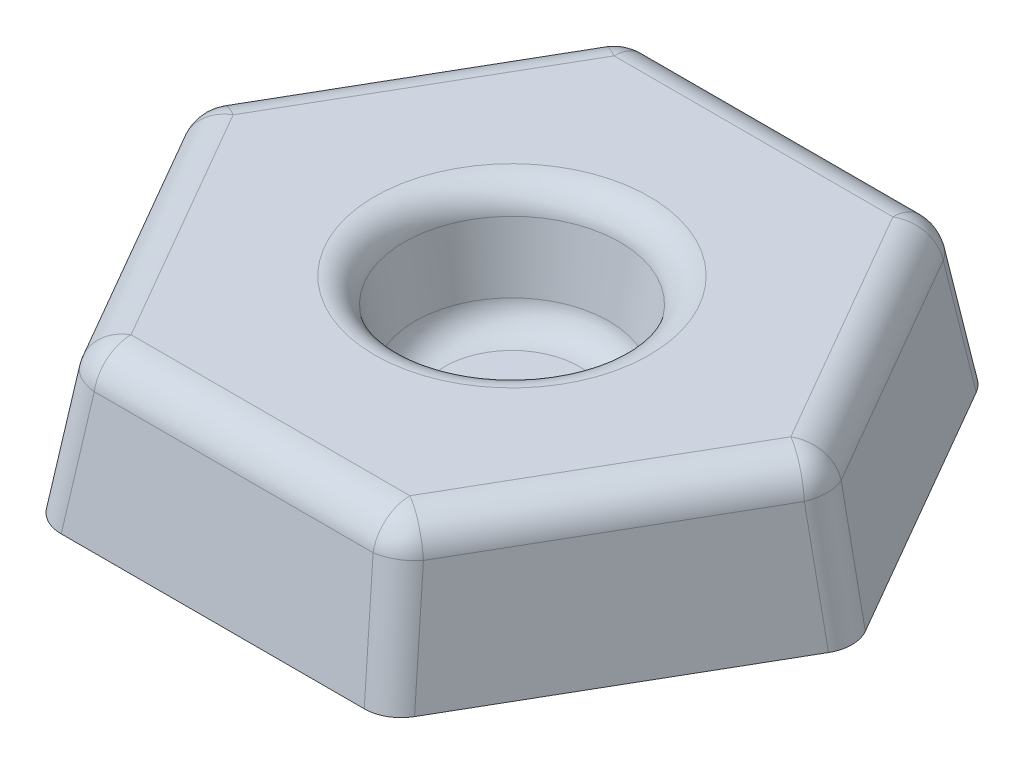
ISO-10303-21;
HEADER;
FILE_DESCRIPTION(('STEP AP214'),'2;1');
FILE_NAME('part.step','',(''),(''),'','','');
FILE_SCHEMA(('AUTOMOTIVE_DESIGN { 1 0 10303 214 1 1 1 1 }'));
ENDSEC;
DATA;
#1=APPLICATION_CONTEXT('core data for automotive mechanical design processes');
#2=APPLICATION_PROTOCOL_DEFINITION('international standard','automotive_design',2000,#1);
#3=PRODUCT_CONTEXT('',#1,'mechanical');
#4=PRODUCT('Part','Part','',(#3));
#5=PRODUCT_RELATED_PRODUCT_CATEGORY('part','',(#4));
#6=PRODUCT_DEFINITION_FORMATION('','',#4);
#7=PRODUCT_DEFINITION_CONTEXT('part definition',#1,'design');
#8=PRODUCT_DEFINITION('design','',#6,#7);
#9=PRODUCT_DEFINITION_SHAPE('','',#8);
#10=(LENGTH_UNIT() NAMED_UNIT(*) SI_UNIT(.MILLI.,.METRE.));
#11=(NAMED_UNIT(*) PLANE_ANGLE_UNIT() SI_UNIT($,.RADIAN.));
#12=(NAMED_UNIT(*) SI_UNIT($,.STERADIAN.) SOLID_ANGLE_UNIT());
#13=UNCERTAINTY_MEASURE_WITH_UNIT(LENGTH_MEASURE(1.E-05),#10,'distance_accuracy_value','');
#14=(GEOMETRIC_REPRESENTATION_CONTEXT(3) GLOBAL_UNCERTAINTY_ASSIGNED_CONTEXT((#13)) GLOBAL_UNIT_ASSIGNED_CONTEXT((#10,
#11,#12)) REPRESENTATION_CONTEXT('',''));
#15=CARTESIAN_POINT('',(0.,0.,0.));
#16=DIRECTION('',(0.,0.,1.));
#17=DIRECTION('',(1.,0.,0.));
#18=AXIS2_PLACEMENT_3D('',#15,#16,#17);
#19=CARTESIAN_POINT('',(-46.1880215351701,18.,0.));
#20=DIRECTION('',(0.,1.,0.));
#21=DIRECTION('',(0.,0.,1.));
#22=AXIS2_PLACEMENT_3D('',#19,#20,#21);
#23=PLANE('',#22);
#24=DIRECTION('',(-0.866025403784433,0.,-0.500000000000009));
#25=VECTOR('',#24,1.);
#26=CARTESIAN_POINT('',(-35.0656199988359,18.,-19.2645645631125));
#27=LINE('',#26,#25);
#28=CARTESIAN_POINT('',(27.5289314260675,18.,16.8744165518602));
#29=VERTEX_POINT('',#28);
#30=CARTESIAN_POINT('',(15.4554830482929,18.,9.90380788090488));
#31=VERTEX_POINT('',#30);
#32=EDGE_CURVE('E497',#29,#31,#27,.T.);
#33=ORIENTED_EDGE('',*,*,#32,.F.);
#34=DIRECTION('',(0.5,0.,-0.866025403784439));
#35=VECTOR('',#34,1.);
#36=CARTESIAN_POINT('',(16.4065298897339,18.,36.1389811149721));
#37=LINE('',#36,#35);
#38=CARTESIAN_POINT('',(18.6356901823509,18.,32.2779622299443));
#39=VERTEX_POINT('',#38);
#40=EDGE_CURVE('E616',#39,#29,#37,.T.);
#41=ORIENTED_EDGE('',*,*,#40,.F.);
#42=DIRECTION('',(1.,0.,0.));
#43=VECTOR('',#42,1.);
#44=CARTESIAN_POINT('',(-46.1880215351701,18.,32.2779622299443));
#45=LINE('',#44,#43);
#46=CARTESIAN_POINT('',(0.849207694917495,18.,32.2779622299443));
#47=VERTEX_POINT('',#46);
#48=EDGE_CURVE('E1007',#47,#39,#45,.T.);
#49=ORIENTED_EDGE('',*,*,#48,.F.);
#50=DIRECTION('',(0.,0.,1.));
#51=VECTOR('',#50,1.);
#52=CARTESIAN_POINT('',(0.849207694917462,18.,0.));
#53=LINE('',#52,#51);
#54=CARTESIAN_POINT('',(0.849207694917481,18.,18.3367448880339));
#55=VERTEX_POINT('',#54);
#56=EDGE_CURVE('E1093',#47,#55,#53,.F.);
#57=ORIENTED_EDGE('',*,*,#56,.T.);
#58=CARTESIAN_POINT('',(0.,18.,0.));
#59=DIRECTION('',(0.,1.,0.));
#60=DIRECTION('',(0.,0.,1.));
#61=AXIS2_PLACEMENT_3D('',#58,#59,#60);
#62=CIRCLE('',#61,18.3563985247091);
#63=EDGE_CURVE('E666',#31,#55,#62,.F.);
#64=ORIENTED_EDGE('',*,*,#63,.F.);
#65=EDGE_LOOP('',(#33,#41,#49,#57,#64));
#66=FACE_BOUND('',#65,.T.);
#67=ADVANCED_FACE('F55',(#66),#23,.F.);
#68=CARTESIAN_POINT('',(0.,16.,0.));
#69=DIRECTION('',(0.,1.,0.));
#70=DIRECTION('',(0.,0.,1.));
#71=AXIS2_PLACEMENT_3D('',#68,#69,#70);
#72=TOROIDAL_SURFACE('',#71,18.3563985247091,2.);
#73=CARTESIAN_POINT('',(17.2102866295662,16.2340010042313,10.845733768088));
#74=CARTESIAN_POINT('',(17.2035330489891,16.2899356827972,10.8440900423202));
#75=CARTESIAN_POINT('',(17.1947396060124,16.3455617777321,10.8412561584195));
#76=CARTESIAN_POINT('',(17.1731372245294,16.4558528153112,10.8332312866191));
#77=CARTESIAN_POINT('',(17.1603285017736,16.510517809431,10.8280404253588));
#78=CARTESIAN_POINT('',(17.116022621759,16.6723877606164,10.8089875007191));
#79=CARTESIAN_POINT('',(17.0786232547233,16.7776526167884,10.7916395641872));
#80=CARTESIAN_POINT('',(16.9891688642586,16.9797933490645,10.7481439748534));
#81=CARTESIAN_POINT('',(16.9371074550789,17.0766655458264,10.7219924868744));
#82=CARTESIAN_POINT('',(16.819815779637,17.2592829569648,10.6616377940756));
#83=CARTESIAN_POINT('',(16.754587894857,17.3450301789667,10.6274360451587));
#84=CARTESIAN_POINT('',(16.6127592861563,17.5030329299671,10.5519224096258));
#85=CARTESIAN_POINT('',(16.5361501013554,17.5752783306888,10.5106052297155));
#86=CARTESIAN_POINT('',(16.3737555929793,17.7041658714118,10.4220438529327));
#87=CARTESIAN_POINT('',(16.2879688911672,17.7608056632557,10.3747987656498));
#88=CARTESIAN_POINT('',(16.1096258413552,17.8568773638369,10.2757062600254));
#89=CARTESIAN_POINT('',(16.0170668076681,17.8963024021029,10.2238570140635));
#90=CARTESIAN_POINT('',(15.8278416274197,17.9567848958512,10.1170466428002));
#91=CARTESIAN_POINT('',(15.7311757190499,17.9778434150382,10.0620856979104));
#92=CARTESIAN_POINT('',(15.5365116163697,18.0009844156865,9.95062944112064));
#93=CARTESIAN_POINT('',(15.4385138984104,18.0030735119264,9.89413467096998));
#94=CARTESIAN_POINT('',(15.2439388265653,17.9882202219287,9.78119777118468));
#95=CARTESIAN_POINT('',(15.1473614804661,17.9712777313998,9.7247556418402));
#96=CARTESIAN_POINT('',(14.9584910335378,17.9188595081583,9.61359757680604));
#97=CARTESIAN_POINT('',(14.8661930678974,17.8834054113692,9.55887970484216));
#98=CARTESIAN_POINT('',(14.6883920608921,17.7949706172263,9.45266028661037));
#99=CARTESIAN_POINT('',(14.6028889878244,17.741990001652,9.40115872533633));
#100=CARTESIAN_POINT('',(14.4412491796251,17.620098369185,9.30292089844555));
#101=CARTESIAN_POINT('',(14.3650978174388,17.5512127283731,9.25617721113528));
#102=CARTESIAN_POINT('',(14.2241699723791,17.3994077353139,9.16869124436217));
#103=CARTESIAN_POINT('',(14.1593941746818,17.3164875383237,9.12794932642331));
#104=CARTESIAN_POINT('',(14.0431293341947,17.1390744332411,9.05366995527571));
#105=CARTESIAN_POINT('',(13.9916276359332,17.0445926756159,9.02012564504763));
#106=CARTESIAN_POINT('',(13.9033093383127,16.846685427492,8.96115483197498));
#107=CARTESIAN_POINT('',(13.8664837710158,16.7432654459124,8.93572337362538));
#108=CARTESIAN_POINT('',(13.8196918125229,16.5714846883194,8.90178130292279));
#109=CARTESIAN_POINT('',(13.8048426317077,16.5049412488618,8.89052489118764));
#110=CARTESIAN_POINT('',(13.7812310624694,16.370411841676,8.87146811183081));
#111=CARTESIAN_POINT('',(13.7724587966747,16.3024284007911,8.86366214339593));
#112=CARTESIAN_POINT('',(13.7667687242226,16.2340010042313,8.85761777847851));
#113=B_SPLINE_CURVE_WITH_KNOTS('',3,(#73,#74,#75,#76,#77,#78,#79,#80,#81,#82,#83,#84,#85,#86,
#87,#88,#89,#90,#91,#92,#93,#94,#95,#96,#97,#98,#99,#100,#101,#102,#103,#104,#105,#106,#107,
#108,#109,#110,#111,#112),.UNSPECIFIED.,.F.,.F.,(4,2,2,2,2,2,2,2,2,2,2,2,2,2,2,2,2,2,2,4),(0.,
0.168990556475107,0.337972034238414,0.675382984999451,1.01294111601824,1.3504382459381,
1.68818753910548,2.02598762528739,2.36392240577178,2.70183761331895,3.03963498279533,
3.37743420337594,3.71483949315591,4.05224320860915,4.38911227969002,4.7260016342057,
5.0625686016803,5.39892959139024,5.60589955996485,5.81253232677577),.UNSPECIFIED.);
#114=CARTESIAN_POINT('',(13.7790597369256,16.3472963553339,8.86928240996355));
#115=VERTEX_POINT('',#114);
#116=EDGE_CURVE('E499',#31,#115,#113,.T.);
#117=ORIENTED_EDGE('',*,*,#116,.F.);
#118=ORIENTED_EDGE('',*,*,#63,.T.);
#119=CARTESIAN_POINT('',(0.849204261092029,17.9999016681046,18.3565985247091));
#120=CARTESIAN_POINT('',(0.84922371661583,18.0004588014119,18.3003148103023));
#121=CARTESIAN_POINT('',(0.849160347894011,17.9986441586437,18.2440344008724));
#122=CARTESIAN_POINT('',(0.848868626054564,17.9902903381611,18.1318281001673));
#123=CARTESIAN_POINT('',(0.848640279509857,17.9837513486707,18.0759021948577));
#124=CARTESIAN_POINT('',(0.847709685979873,17.9571026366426,17.9093367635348));
#125=CARTESIAN_POINT('',(0.846761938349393,17.9299626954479,17.7997399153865));
#126=CARTESIAN_POINT('',(0.844237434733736,17.8576703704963,17.5866610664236));
#127=CARTESIAN_POINT('',(0.842660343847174,17.8125083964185,17.4831823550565));
#128=CARTESIAN_POINT('',(0.838921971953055,17.7054554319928,17.2853110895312));
#129=CARTESIAN_POINT('',(0.836760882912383,17.6435699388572,17.1909155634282));
#130=CARTESIAN_POINT('',(0.831918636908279,17.5049061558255,17.0139980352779));
#131=CARTESIAN_POINT('',(0.829238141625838,17.4281468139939,16.9314611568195));
#132=CARTESIAN_POINT('',(0.823429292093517,17.261803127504,16.7804166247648));
#133=CARTESIAN_POINT('',(0.820300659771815,17.1722108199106,16.7119177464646));
#134=CARTESIAN_POINT('',(0.813687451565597,16.9828333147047,16.5909835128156));
#135=CARTESIAN_POINT('',(0.810202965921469,16.8830507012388,16.5385440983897));
#136=CARTESIAN_POINT('',(0.802981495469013,16.6762548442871,16.451281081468));
#137=CARTESIAN_POINT('',(0.799245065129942,16.5692574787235,16.4164201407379));
#138=CARTESIAN_POINT('',(0.794128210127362,16.4227299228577,16.3819635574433));
#139=CARTESIAN_POINT('',(0.792810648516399,16.3849998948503,16.3742377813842));
#140=CARTESIAN_POINT('',(0.791487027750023,16.3470963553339,16.3676220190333));
#141=B_SPLINE_CURVE_WITH_KNOTS('',3,(#119,#120,#121,#122,#123,#124,#125,#126,#127,#128,#129,
#130,#131,#132,#133,#134,#135,#136,#137,#138,#139,#140),.UNSPECIFIED.,.F.,.F.,(4,2,2,2,2,2,2,2,
2,2,4),(0.,0.168756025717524,0.337505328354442,0.674501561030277,1.01167736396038,
1.34874246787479,1.68538096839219,2.02222926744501,2.3589923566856,2.69503708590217,
2.81057283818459),.UNSPECIFIED.);
#142=CARTESIAN_POINT('',(0.791494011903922,16.3472963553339,16.3676569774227));
#143=VERTEX_POINT('',#142);
#144=EDGE_CURVE('E855',#55,#143,#141,.T.);
#145=ORIENTED_EDGE('',*,*,#144,.T.);
#146=CARTESIAN_POINT('',(0.,16.3472963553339,0.));
#147=DIRECTION('',(0.,1.,0.));
#148=DIRECTION('',(0.,0.,1.));
#149=AXIS2_PLACEMENT_3D('',#146,#147,#148);
#150=CIRCLE('',#149,16.3867830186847);
#151=EDGE_CURVE('E657',#143,#115,#150,.T.);
#152=ORIENTED_EDGE('',*,*,#151,.T.);
#153=EDGE_LOOP('',(#117,#118,#145,#152));
#154=FACE_BOUND('',#153,.T.);
#155=ADVANCED_FACE('F525',(#154),#72,.F.);
#156=CARTESIAN_POINT('',(21.3882737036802,-0.347296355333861,39.0151922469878));
#157=DIRECTION('',(0.852868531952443,0.173648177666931,0.492403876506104));
#158=DIRECTION('',(0.5,0.,-0.866025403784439));
#159=AXIS2_PLACEMENT_3D('',#156,#157,#158);
#160=PLANE('',#159);
#161=DIRECTION('',(0.5,0.,-0.866025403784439));
#162=VECTOR('',#161,1.);
#163=CARTESIAN_POINT('',(20.1136111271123,8.,38.2792654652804));
#164=LINE('',#163,#162);
#165=CARTESIAN_POINT('',(31.9106165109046,8.,17.8462527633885));
#166=VERTEX_POINT('',#165);
#167=CARTESIAN_POINT('',(31.4106165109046,8.,18.712278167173));
#168=VERTEX_POINT('',#167);
#169=EDGE_CURVE('E481',#166,#168,#164,.F.);
#170=ORIENTED_EDGE('',*,*,#169,.F.);
#171=DIRECTION('',(0.133109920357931,-0.984225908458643,0.116538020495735));
#172=VECTOR('',#171,1.);
#173=CARTESIAN_POINT('',(33.1461405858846,-1.13556857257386,18.9279567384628));
#174=LINE('',#173,#172);
#175=CARTESIAN_POINT('',(30.8934594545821,15.5209445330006,16.9557295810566));
#176=VERTEX_POINT('',#175);
#177=EDGE_CURVE('E487',#166,#176,#174,.F.);
#178=ORIENTED_EDGE('',*,*,#177,.T.);
#179=DIRECTION('',(0.5,0.,-0.866025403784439));
#180=VECTOR('',#179,1.);
#181=CARTESIAN_POINT('',(18.9651354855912,15.5209445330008,37.6161927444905));
#182=LINE('',#181,#180);
#183=CARTESIAN_POINT('',(39.8299859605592,15.5209445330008,1.47721162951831));
#184=VERTEX_POINT('',#183);
#185=EDGE_CURVE('E959',#184,#176,#182,.F.);
#186=ORIENTED_EDGE('',*,*,#185,.F.);
#187=DIRECTION('',(0.199511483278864,-0.97989548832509,0.));
#188=VECTOR('',#187,1.);
#189=CARTESIAN_POINT('',(43.1174173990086,-0.625189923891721,1.47721162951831));
#190=LINE('',#189,#188);
#191=CARTESIAN_POINT('',(42.9901256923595,0.,1.47721162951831));
#192=VERTEX_POINT('',#191);
#193=EDGE_CURVE('E963',#192,#184,#190,.F.);
#194=ORIENTED_EDGE('',*,*,#193,.F.);
#195=DIRECTION('',(-0.5,0.,0.866025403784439));
#196=VECTOR('',#195,1.);
#197=CARTESIAN_POINT('',(21.3352402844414,0.,38.9845733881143));
#198=LINE('',#197,#196);
#199=CARTESIAN_POINT('',(22.7743656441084,0.,36.4919351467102));
#200=VERTEX_POINT('',#199);
#201=EDGE_CURVE('E689',#200,#192,#198,.F.);
#202=ORIENTED_EDGE('',*,*,#201,.F.);
#203=DIRECTION('',(0.0997557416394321,-0.97989548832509,0.17278201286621));
#204=VECTOR('',#203,1.);
#205=CARTESIAN_POINT('',(22.8380114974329,-0.62518992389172,36.6021729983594));
#206=LINE('',#205,#204);
#207=CARTESIAN_POINT('',(21.1942957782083,15.5209445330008,33.7551738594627));
#208=VERTEX_POINT('',#207);
#209=EDGE_CURVE('E977',#208,#200,#206,.T.);
#210=ORIENTED_EDGE('',*,*,#209,.F.);
#211=CARTESIAN_POINT('',(30.130822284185,15.5209445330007,18.276655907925));
#212=VERTEX_POINT('',#211);
#213=EDGE_CURVE('E965',#212,#208,#182,.F.);
#214=ORIENTED_EDGE('',*,*,#213,.F.);
#215=DIRECTION('',(-0.167479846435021,0.984225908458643,-0.0570075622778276));
#216=VECTOR('',#215,1.);
#217=CARTESIAN_POINT('',(32.6992909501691,0.426869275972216,19.1509231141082));
#218=LINE('',#217,#216);
#219=EDGE_CURVE('E1061',#168,#212,#218,.T.);
#220=ORIENTED_EDGE('',*,*,#219,.F.);
#221=EDGE_LOOP('',(#170,#178,#186,#194,#202,#210,#214,#220));
#222=FACE_BOUND('',#221,.T.);
#223=ADVANCED_FACE('F533',(#222),#160,.F.);
#224=CARTESIAN_POINT('',(16.4065298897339,15.,36.1389811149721));
#225=DIRECTION('',(0.5,0.,-0.866025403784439));
#226=DIRECTION('',(-0.866025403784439,0.,-0.5));
#227=AXIS2_PLACEMENT_3D('',#224,#225,#226);
#228=CYLINDRICAL_SURFACE('',#227,3.);
#229=CARTESIAN_POINT('',(27.5813125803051,15.,16.7836897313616));
#230=DIRECTION('',(0.499695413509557,0.034899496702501,-0.865497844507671));
#231=DIRECTION('',(0.0174497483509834,-0.999390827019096,-0.0302238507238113));
#232=AXIS2_PLACEMENT_3D('',#229,#230,#231);
#233=ELLIPSE('',#232,3.00182863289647,3.);
#234=EDGE_CURVE('E59',#212,#29,#233,.F.);
#235=ORIENTED_EDGE('',*,*,#234,.F.);
#236=ORIENTED_EDGE('',*,*,#213,.T.);
#237=CARTESIAN_POINT('',(18.6356901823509,15.,32.2779622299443));
#238=DIRECTION('',(0.5,0.,-0.866025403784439));
#239=DIRECTION('',(-0.866025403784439,0.,-0.5));
#240=AXIS2_PLACEMENT_3D('',#237,#238,#239);
#241=CIRCLE('',#240,3.);
#242=EDGE_CURVE('E634',#208,#39,#241,.F.);
#243=ORIENTED_EDGE('',*,*,#242,.T.);
#244=ORIENTED_EDGE('',*,*,#40,.T.);
#245=EDGE_LOOP('',(#235,#236,#243,#244));
#246=FACE_BOUND('',#245,.T.);
#247=ADVANCED_FACE('F543',(#246),#228,.F.);
#248=CARTESIAN_POINT('',(28.3781391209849,18.,15.4035456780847));
#249=VERTEX_POINT('',#248);
#250=CARTESIAN_POINT('',(37.2713803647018,18.,0.));
#251=VERTEX_POINT('',#250);
#252=EDGE_CURVE('E621',#249,#251,#37,.T.);
#253=ORIENTED_EDGE('',*,*,#252,.F.);
#254=DIRECTION('',(0.866025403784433,0.,0.500000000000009));
#255=VECTOR('',#254,1.);
#256=CARTESIAN_POINT('',(-34.2164123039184,18.,-20.735435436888));
#257=LINE('',#256,#255);
#258=CARTESIAN_POINT('',(16.3046907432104,18.,8.43293700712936));
#259=VERTEX_POINT('',#258);
#260=EDGE_CURVE('E70',#249,#259,#257,.F.);
#261=ORIENTED_EDGE('',*,*,#260,.T.);
#262=CARTESIAN_POINT('',(16.3046907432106,18.,-8.43293700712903));
#263=VERTEX_POINT('',#262);
#264=EDGE_CURVE('E942',#263,#259,#62,.F.);
#265=ORIENTED_EDGE('',*,*,#264,.F.);
#266=DIRECTION('',(-0.866025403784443,0.,0.499999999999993));
#267=VECTOR('',#266,1.);
#268=CARTESIAN_POINT('',(-34.2164123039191,18.,20.7354354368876));
#269=LINE('',#268,#267);
#270=CARTESIAN_POINT('',(28.3781391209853,18.,-15.4035456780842));
#271=VERTEX_POINT('',#270);
#272=EDGE_CURVE('E932',#271,#263,#269,.T.);
#273=ORIENTED_EDGE('',*,*,#272,.F.);
#274=DIRECTION('',(-0.5,0.,-0.866025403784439));
#275=VECTOR('',#274,1.);
#276=CARTESIAN_POINT('',(16.4065298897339,18.,-36.1389811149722));
#277=LINE('',#276,#275);
#278=EDGE_CURVE('E615',#251,#271,#277,.T.);
#279=ORIENTED_EDGE('',*,*,#278,.F.);
#280=EDGE_LOOP('',(#253,#261,#265,#273,#279));
#281=FACE_BOUND('',#280,.T.);
#282=ADVANCED_FACE('F528',(#281),#23,.F.);
#283=ORIENTED_EDGE('',*,*,#264,.T.);
#284=CARTESIAN_POINT('',(17.9978242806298,16.2340010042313,9.48167854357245));
#285=CARTESIAN_POINT('',(17.9930239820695,16.2899356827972,9.47665163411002));
#286=CARTESIAN_POINT('',(17.9861730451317,16.3455617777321,9.47045323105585));
#287=CARTESIAN_POINT('',(17.968422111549,16.4558528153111,9.45575745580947));
#288=CARTESIAN_POINT('',(17.9575223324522,16.510517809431,9.4472602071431));
#289=CARTESIAN_POINT('',(17.9188690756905,16.6723877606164,9.41841665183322));
#290=CARTESIAN_POINT('',(17.8851456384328,16.7776526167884,9.39470181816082));
#291=CARTESIAN_POINT('',(17.8027501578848,16.9797933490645,9.33897983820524));
#292=CARTESIAN_POINT('',(17.7540716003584,17.0766655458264,9.30696907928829));
#293=CARTESIAN_POINT('',(17.6431570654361,17.2592829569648,9.23556885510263));
#294=CARTESIAN_POINT('',(17.5809235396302,17.3450301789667,9.1961807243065));
#295=CARTESIAN_POINT('',(17.4446125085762,17.5030329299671,9.11111036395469));
#296=CARTESIAN_POINT('',(17.3705261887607,17.5752783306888,9.065423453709));
#297=CARTESIAN_POINT('',(17.2126325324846,17.7041658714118,8.96906637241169));
#298=CARTESIAN_POINT('',(17.1288237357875,17.7608056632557,8.91839545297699));
#299=CARTESIAN_POINT('',(16.9538355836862,17.8568773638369,8.81349209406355));
#300=CARTESIAN_POINT('',(16.8626533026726,17.8963024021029,8.75925824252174));
#301=CARTESIAN_POINT('',(16.6755402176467,17.9567848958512,8.64878961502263));
#302=CARTESIAN_POINT('',(16.5796096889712,17.9778434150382,8.59255495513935));
#303=CARTESIAN_POINT('',(16.3857536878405,18.0009844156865,8.47969902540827));
#304=CARTESIAN_POINT('',(16.2878289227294,18.0030735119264,8.4230778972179));
#305=CARTESIAN_POINT('',(16.0927351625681,17.9882202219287,8.31103939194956));
#306=CARTESIAN_POINT('',(15.9955661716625,17.9712777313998,8.25562202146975));
#307=CARTESIAN_POINT('',(15.8048652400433,17.9188595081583,8.14763444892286));
#308=CARTESIAN_POINT('',(15.7113291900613,17.8834054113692,8.09506100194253));
#309=CARTESIAN_POINT('',(15.5304399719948,17.7949706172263,7.99419052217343));
#310=CARTESIAN_POINT('',(15.443086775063,17.741990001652,7.94589346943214));
#311=CARTESIAN_POINT('',(15.2771904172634,17.620098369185,7.85502820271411));
#312=CARTESIAN_POINT('',(15.198633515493,17.5512127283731,7.81245103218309));
#313=CARTESIAN_POINT('',(15.052404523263,17.3994077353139,7.73414692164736));
#314=CARTESIAN_POINT('',(14.9847330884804,17.3164875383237,7.69842039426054));
#315=CARTESIAN_POINT('',(14.8622728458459,17.1390744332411,7.63487177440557));
#316=CARTESIAN_POINT('',(14.8074717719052,17.0445926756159,7.60704215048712));
#317=CARTESIAN_POINT('',(14.7122424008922,16.846685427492,7.56004166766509));
#318=CARTESIAN_POINT('',(14.6718053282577,16.7432654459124,7.54086552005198));
#319=CARTESIAN_POINT('',(14.6190146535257,16.5714846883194,7.51731353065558));
#320=CARTESIAN_POINT('',(14.6018417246,16.5049412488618,7.51008196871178));
#321=CARTESIAN_POINT('',(14.5735322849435,16.370411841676,7.49916213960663));
#322=CARTESIAN_POINT('',(14.5623859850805,16.3024284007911,7.49546811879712));
#323=CARTESIAN_POINT('',(14.5543063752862,16.2340010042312,7.49356255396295));
#324=B_SPLINE_CURVE_WITH_KNOTS('',3,(#284,#285,#286,#287,#288,#289,#290,#291,#292,#293,#294,
#295,#296,#297,#298,#299,#300,#301,#302,#303,#304,#305,#306,#307,#308,#309,#310,#311,#312,#313,
#314,#315,#316,#317,#318,#319,#320,#321,#322,#323),.UNSPECIFIED.,.F.,.F.,(4,2,2,2,2,2,2,2,2,2,2,
2,2,2,2,2,2,2,2,4),(0.,0.168990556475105,0.337972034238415,0.675382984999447,1.01294111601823,
1.35043824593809,1.68818753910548,2.02598762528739,2.36392240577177,2.70183761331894,
3.03963498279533,3.37743420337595,3.71483949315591,4.05224320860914,4.38911227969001,
4.72600163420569,5.06256860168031,5.39892959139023,5.60589955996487,5.81253232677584),.UNSPECIFIED.);
#325=CARTESIAN_POINT('',(14.5705537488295,16.3472963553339,7.49837456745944));
#326=VERTEX_POINT('',#325);
#327=EDGE_CURVE('E1064',#259,#326,#324,.T.);
#328=ORIENTED_EDGE('',*,*,#327,.T.);
#329=CARTESIAN_POINT('',(14.5705537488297,16.3472963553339,-7.49837456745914));
#330=VERTEX_POINT('',#329);
#331=EDGE_CURVE('E495',#326,#330,#150,.T.);
#332=ORIENTED_EDGE('',*,*,#331,.T.);
#333=CARTESIAN_POINT('',(17.9978116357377,16.2341483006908,-9.48166530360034));
#334=CARTESIAN_POINT('',(17.99300773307,16.2900824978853,-9.4766363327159));
#335=CARTESIAN_POINT('',(17.9861532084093,16.3457079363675,-9.47043588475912));
#336=CARTESIAN_POINT('',(17.9683951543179,16.455997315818,-9.4557360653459));
#337=CARTESIAN_POINT('',(17.9574918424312,16.5106613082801,-9.44723681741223));
#338=CARTESIAN_POINT('',(17.9188281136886,16.6725277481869,-9.41838735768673));
#339=CARTESIAN_POINT('',(17.8850978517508,16.777789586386,-9.39466870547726));
#340=CARTESIAN_POINT('',(17.8026892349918,16.9799230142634,-9.3389394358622));
#341=CARTESIAN_POINT('',(17.7540043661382,17.0767909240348,-9.30692520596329));
#342=CARTESIAN_POINT('',(17.6430778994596,17.2593986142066,-9.23551848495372));
#343=CARTESIAN_POINT('',(17.5808387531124,17.3451404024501,-9.19612732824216));
#344=CARTESIAN_POINT('',(17.4445173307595,17.5031312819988,-9.11105144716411));
#345=CARTESIAN_POINT('',(17.3704262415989,17.5753702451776,-9.06536204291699));
#346=CARTESIAN_POINT('',(17.2125240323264,17.7042440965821,-8.96900057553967));
#347=CARTESIAN_POINT('',(17.1287114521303,17.7608766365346,-8.91832776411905));
#348=CARTESIAN_POINT('',(16.9537168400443,17.856933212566,-8.81342128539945));
#349=CARTESIAN_POINT('',(16.8625318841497,17.8963503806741,-8.75918620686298));
#350=CARTESIAN_POINT('',(16.6754146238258,17.9568167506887,-8.64871581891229));
#351=CARTESIAN_POINT('',(16.5794825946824,17.9778670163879,-8.59248062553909));
#352=CARTESIAN_POINT('',(16.3856248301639,18.0009913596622,-8.47962434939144));
#353=CARTESIAN_POINT('',(16.2876998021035,18.0030720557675,-8.42300340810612));
#354=CARTESIAN_POINT('',(16.0926067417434,17.9882020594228,-8.31096598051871));
#355=CARTESIAN_POINT('',(15.9954387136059,17.9712512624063,-8.25554950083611));
#356=CARTESIAN_POINT('',(15.8047409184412,17.9188167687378,-8.14756439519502));
#357=CARTESIAN_POINT('',(15.7112070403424,17.8833547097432,-8.09499252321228));
#358=CARTESIAN_POINT('',(15.5303233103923,17.7949045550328,-7.9941258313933));
#359=CARTESIAN_POINT('',(15.442973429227,17.7419165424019,-7.94583099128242));
#360=CARTESIAN_POINT('',(15.2770847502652,17.6200109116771,-7.85497072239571));
#361=CARTESIAN_POINT('',(15.1985322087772,17.5511186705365,-7.81239633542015));
#362=CARTESIAN_POINT('',(15.0523128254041,17.3993014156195,-7.73409826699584));
#363=CARTESIAN_POINT('',(14.9846466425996,17.3163755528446,-7.69837500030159));
#364=CARTESIAN_POINT('',(14.8621976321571,17.1389522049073,-7.63483327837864));
#365=CARTESIAN_POINT('',(14.8074025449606,17.044465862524,-7.60700729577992));
#366=CARTESIAN_POINT('',(14.7121857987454,16.8465507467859,-7.56001441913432));
#367=CARTESIAN_POINT('',(14.6717553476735,16.743127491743,-7.54084222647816));
#368=CARTESIAN_POINT('',(14.6189900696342,16.5713894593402,-7.51730317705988));
#369=CARTESIAN_POINT('',(14.601831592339,16.5048931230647,-7.51007805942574));
#370=CARTESIAN_POINT('',(14.5735424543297,16.3704601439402,-7.49916606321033));
#371=CARTESIAN_POINT('',(14.5624020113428,16.3025260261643,-7.49547343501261));
#372=CARTESIAN_POINT('',(14.5543237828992,16.2341483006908,-7.49356666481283));
#373=B_SPLINE_CURVE_WITH_KNOTS('',3,(#333,#334,#335,#336,#337,#338,#339,#340,#341,#342,#343,
#344,#345,#346,#347,#348,#349,#350,#351,#352,#353,#354,#355,#356,#357,#358,#359,#360,#361,#362,
#363,#364,#365,#366,#367,#368,#369,#370,#371,#372),.UNSPECIFIED.,.F.,.F.,(4,2,2,2,2,2,2,2,2,2,2,
2,2,2,2,2,2,2,2,4),(0.,0.16899059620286,0.337972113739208,0.675383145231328,1.01294135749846,
1.35043856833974,1.68818792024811,2.02598806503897,2.36392285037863,2.70183806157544,
3.03963536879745,3.37743453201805,3.71483972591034,4.0522433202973,4.38911222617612,
4.72600151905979,5.06256861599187,5.39892935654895,5.605751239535,5.81223591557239),.UNSPECIFIED.);
#374=EDGE_CURVE('E943',#263,#330,#373,.T.);
#375=ORIENTED_EDGE('',*,*,#374,.F.);
#376=EDGE_LOOP('',(#283,#328,#332,#375));
#377=FACE_BOUND('',#376,.T.);
#378=ADVANCED_FACE('F542',(#377),#72,.F.);
#379=CARTESIAN_POINT('',(44.4822844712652,-0.347296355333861,0.984807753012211));
#380=DIRECTION('',(0.852868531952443,0.173648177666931,-0.492403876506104));
#381=DIRECTION('',(-0.5,0.,-0.866025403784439));
#382=AXIS2_PLACEMENT_3D('',#379,#380,#381);
#383=PLANE('',#382);
#384=DIRECTION('',(-0.5,0.,-0.866025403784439));
#385=VECTOR('',#384,1.);
#386=CARTESIAN_POINT('',(43.2076218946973,8.,1.72073453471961));
#387=LINE('',#386,#385);
#388=CARTESIAN_POINT('',(31.410616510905,8.,-18.7122781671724));
#389=VERTEX_POINT('',#388);
#390=CARTESIAN_POINT('',(31.910616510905,8.,-17.8462527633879));
#391=VERTEX_POINT('',#390);
#392=EDGE_CURVE('E944',#389,#391,#387,.F.);
#393=ORIENTED_EDGE('',*,*,#392,.F.);
#394=DIRECTION('',(0.167479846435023,-0.984225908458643,-0.0570075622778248));
#395=VECTOR('',#394,1.);
#396=CARTESIAN_POINT('',(32.9651616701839,-1.13556857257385,-19.2414214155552));
#397=LINE('',#396,#395);
#398=CARTESIAN_POINT('',(30.1308222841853,15.5209445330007,-18.2766559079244));
#399=VERTEX_POINT('',#398);
#400=EDGE_CURVE('E1952',#389,#399,#397,.F.);
#401=ORIENTED_EDGE('',*,*,#400,.T.);
#402=DIRECTION('',(-0.5,0.,-0.866025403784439));
#403=VECTOR('',#402,1.);
#404=CARTESIAN_POINT('',(42.0591462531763,15.5209445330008,2.38380725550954));
#405=LINE('',#404,#403);
#406=CARTESIAN_POINT('',(21.1942957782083,15.5209445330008,-33.7551738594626));
#407=VERTEX_POINT('',#406);
#408=EDGE_CURVE('E974',#407,#399,#405,.F.);
#409=ORIENTED_EDGE('',*,*,#408,.F.);
#410=DIRECTION('',(0.099755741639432,-0.97989548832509,-0.17278201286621));
#411=VECTOR('',#410,1.);
#412=CARTESIAN_POINT('',(22.838011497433,-0.62518992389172,-36.6021729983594));
#413=LINE('',#412,#411);
#414=CARTESIAN_POINT('',(22.7743656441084,0.,-36.4919351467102));
#415=VERTEX_POINT('',#414);
#416=EDGE_CURVE('E972',#415,#407,#413,.F.);
#417=ORIENTED_EDGE('',*,*,#416,.F.);
#418=DIRECTION('',(0.5,0.,0.866025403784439));
#419=VECTOR('',#418,1.);
#420=CARTESIAN_POINT('',(44.4292510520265,0.,1.01542661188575));
#421=LINE('',#420,#419);
#422=CARTESIAN_POINT('',(42.9901256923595,0.,-1.47721162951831));
#423=VERTEX_POINT('',#422);
#424=EDGE_CURVE('E682',#423,#415,#421,.F.);
#425=ORIENTED_EDGE('',*,*,#424,.F.);
#426=DIRECTION('',(0.199511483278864,-0.97989548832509,0.));
#427=VECTOR('',#426,1.);
#428=CARTESIAN_POINT('',(43.1174173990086,-0.625189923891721,-1.47721162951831));
#429=LINE('',#428,#427);
#430=CARTESIAN_POINT('',(39.8299859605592,15.5209445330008,-1.47721162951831));
#431=VERTEX_POINT('',#430);
#432=EDGE_CURVE('E685',#431,#423,#429,.T.);
#433=ORIENTED_EDGE('',*,*,#432,.F.);
#434=CARTESIAN_POINT('',(30.8934594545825,15.5209445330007,-16.955729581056));
#435=VERTEX_POINT('',#434);
#436=EDGE_CURVE('E947',#435,#431,#405,.F.);
#437=ORIENTED_EDGE('',*,*,#436,.F.);
#438=DIRECTION('',(-0.133109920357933,0.984225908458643,0.116538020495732));
#439=VECTOR('',#438,1.);
#440=CARTESIAN_POINT('',(32.9348313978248,0.426869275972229,-18.742955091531));
#441=LINE('',#440,#439);
#442=EDGE_CURVE('E935',#391,#435,#441,.T.);
#443=ORIENTED_EDGE('',*,*,#442,.F.);
#444=EDGE_LOOP('',(#393,#401,#409,#417,#425,#433,#437,#443));
#445=FACE_BOUND('',#444,.T.);
#446=ADVANCED_FACE('F1668',(#445),#383,.F.);
#447=CARTESIAN_POINT('',(16.4065298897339,15.,-36.1389811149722));
#448=DIRECTION('',(-0.5,0.,-0.866025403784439));
#449=DIRECTION('',(-0.866025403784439,0.,0.5));
#450=AXIS2_PLACEMENT_3D('',#447,#448,#449);
#451=CYLINDRICAL_SURFACE('',#450,3.);
#452=CARTESIAN_POINT('',(28.3257579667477,15.,-15.4942724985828));
#453=DIRECTION('',(-0.499695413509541,0.034899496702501,-0.865497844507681));
#454=DIRECTION('',(-0.0174497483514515,-0.999390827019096,-0.0302238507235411));
#455=AXIS2_PLACEMENT_3D('',#452,#453,#454);
#456=ELLIPSE('',#455,3.00182863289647,3.);
#457=EDGE_CURVE('E918',#435,#271,#456,.F.);
#458=ORIENTED_EDGE('',*,*,#457,.F.);
#459=ORIENTED_EDGE('',*,*,#436,.T.);
#460=CARTESIAN_POINT('',(37.2713803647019,15.,0.));
#461=DIRECTION('',(-0.5,0.,-0.866025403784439));
#462=DIRECTION('',(-0.866025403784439,0.,0.5));
#463=AXIS2_PLACEMENT_3D('',#460,#461,#462);
#464=CIRCLE('',#463,3.);
#465=EDGE_CURVE('E628',#251,#431,#464,.T.);
#466=ORIENTED_EDGE('',*,*,#465,.F.);
#467=ORIENTED_EDGE('',*,*,#278,.T.);
#468=EDGE_LOOP('',(#458,#459,#466,#467));
#469=FACE_BOUND('',#468,.T.);
#470=ADVANCED_FACE('F602',(#469),#451,.F.);
#471=CARTESIAN_POINT('',(23.0940107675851,-0.347296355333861,-38.0303844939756));
#472=DIRECTION('',(0.,0.173648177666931,-0.984807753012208));
#473=DIRECTION('',(0.,0.984807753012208,0.173648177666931));
#474=AXIS2_PLACEMENT_3D('',#471,#472,#473);
#475=PLANE('',#474);
#476=DIRECTION('',(-1.,0.,0.));
#477=VECTOR('',#476,1.);
#478=CARTESIAN_POINT('',(23.0940107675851,8.,-36.5585309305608));
#479=LINE('',#478,#477);
#480=CARTESIAN_POINT('',(-0.500000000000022,8.,-36.5585309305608));
#481=VERTEX_POINT('',#480);
#482=CARTESIAN_POINT('',(0.499999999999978,8.,-36.5585309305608));
#483=VERTEX_POINT('',#482);
#484=EDGE_CURVE('E1965',#481,#483,#479,.F.);
#485=ORIENTED_EDGE('',*,*,#484,.F.);
#486=DIRECTION('',(0.0343699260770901,-0.984225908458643,-0.173545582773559));
#487=VECTOR('',#486,1.);
#488=CARTESIAN_POINT('',(-0.180978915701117,-1.13556857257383,-38.1693781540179));
#489=LINE('',#488,#487);
#490=CARTESIAN_POINT('',(-0.76263717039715,15.5209445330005,-35.232385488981));
#491=VERTEX_POINT('',#490);
#492=EDGE_CURVE('E1994',#481,#491,#489,.F.);
#493=ORIENTED_EDGE('',*,*,#492,.T.);
#494=DIRECTION('',(1.,0.,0.));
#495=VECTOR('',#494,1.);
#496=CARTESIAN_POINT('',(23.0940107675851,15.5209445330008,-35.2323854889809));
#497=LINE('',#496,#495);
#498=CARTESIAN_POINT('',(-18.6356901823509,15.5209445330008,-35.2323854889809));
#499=VERTEX_POINT('',#498);
#500=EDGE_CURVE('E983',#499,#491,#497,.T.);
#501=ORIENTED_EDGE('',*,*,#500,.F.);
#502=DIRECTION('',(0.099755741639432,0.97989548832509,0.172782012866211));
#503=VECTOR('',#502,1.);
#504=CARTESIAN_POINT('',(-19.819779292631,3.88969847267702,-37.283287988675));
#505=LINE('',#504,#503);
#506=CARTESIAN_POINT('',(-20.2157600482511,0.,-37.9691467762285));
#507=VERTEX_POINT('',#506);
#508=EDGE_CURVE('E681',#507,#499,#505,.T.);
#509=ORIENTED_EDGE('',*,*,#508,.F.);
#510=DIRECTION('',(1.,0.,0.));
#511=VECTOR('',#510,1.);
#512=CARTESIAN_POINT('',(23.0940107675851,0.,-37.9691467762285));
#513=LINE('',#512,#511);
#514=CARTESIAN_POINT('',(20.2157600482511,0.,-37.9691467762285));
#515=VERTEX_POINT('',#514);
#516=EDGE_CURVE('E678',#515,#507,#513,.F.);
#517=ORIENTED_EDGE('',*,*,#516,.F.);
#518=DIRECTION('',(0.099755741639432,-0.97989548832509,-0.17278201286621));
#519=VECTOR('',#518,1.);
#520=CARTESIAN_POINT('',(20.2794059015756,-0.62518992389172,-38.0793846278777));
#521=LINE('',#520,#519);
#522=CARTESIAN_POINT('',(18.635690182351,15.5209445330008,-35.2323854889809));
#523=VERTEX_POINT('',#522);
#524=EDGE_CURVE('E677',#523,#515,#521,.T.);
#525=ORIENTED_EDGE('',*,*,#524,.F.);
#526=CARTESIAN_POINT('',(0.762637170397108,15.5209445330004,-35.232385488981));
#527=VERTEX_POINT('',#526);
#528=EDGE_CURVE('E988',#527,#523,#497,.T.);
#529=ORIENTED_EDGE('',*,*,#528,.F.);
#530=DIRECTION('',(0.0343699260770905,0.984225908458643,0.173545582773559));
#531=VECTOR('',#530,1.);
#532=CARTESIAN_POINT('',(0.235540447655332,0.426869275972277,-37.8938782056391));
#533=LINE('',#532,#531);
#534=EDGE_CURVE('E1992',#483,#527,#533,.T.);
#535=ORIENTED_EDGE('',*,*,#534,.F.);
#536=EDGE_LOOP('',(#485,#493,#501,#509,#517,#525,#529,#535));
#537=FACE_BOUND('',#536,.T.);
#538=ADVANCED_FACE('F593',(#537),#475,.F.);
#539=CARTESIAN_POINT('',(27.5289314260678,18.,-16.8744165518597));
#540=VERTEX_POINT('',#539);
#541=CARTESIAN_POINT('',(18.635690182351,18.,-32.2779622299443));
#542=VERTEX_POINT('',#541);
#543=EDGE_CURVE('E606',#540,#542,#277,.T.);
#544=ORIENTED_EDGE('',*,*,#543,.F.);
#545=DIRECTION('',(0.866025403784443,0.,-0.499999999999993));
#546=VECTOR('',#545,1.);
#547=CARTESIAN_POINT('',(-35.0656199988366,18.,19.2645645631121));
#548=LINE('',#547,#546);
#549=CARTESIAN_POINT('',(15.4554830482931,18.,-9.90380788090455));
#550=VERTEX_POINT('',#549);
#551=EDGE_CURVE('E77',#540,#550,#548,.F.);
#552=ORIENTED_EDGE('',*,*,#551,.T.);
#553=CARTESIAN_POINT('',(0.849207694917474,18.,-18.3367448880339));
#554=VERTEX_POINT('',#553);
#555=EDGE_CURVE('E2010',#554,#550,#62,.F.);
#556=ORIENTED_EDGE('',*,*,#555,.F.);
#557=DIRECTION('',(0.,0.,1.));
#558=VECTOR('',#557,1.);
#559=CARTESIAN_POINT('',(0.849207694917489,18.,0.));
#560=LINE('',#559,#558);
#561=CARTESIAN_POINT('',(0.849207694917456,18.,-32.2779622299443));
#562=VERTEX_POINT('',#561);
#563=EDGE_CURVE('E1974',#562,#554,#560,.T.);
#564=ORIENTED_EDGE('',*,*,#563,.F.);
#565=DIRECTION('',(1.,0.,0.));
#566=VECTOR('',#565,1.);
#567=CARTESIAN_POINT('',(-46.1880215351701,18.,-32.2779622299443));
#568=LINE('',#567,#566);
#569=EDGE_CURVE('E611',#542,#562,#568,.F.);
#570=ORIENTED_EDGE('',*,*,#569,.F.);
#571=EDGE_LOOP('',(#544,#552,#556,#564,#570));
#572=FACE_BOUND('',#571,.T.);
#573=ADVANCED_FACE('F545',(#572),#23,.F.);
#574=CARTESIAN_POINT('',(-46.1880215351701,15.,-32.2779622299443));
#575=DIRECTION('',(-1.,0.,0.));
#576=DIRECTION('',(0.,0.,1.));
#577=AXIS2_PLACEMENT_3D('',#574,#575,#576);
#578=CYLINDRICAL_SURFACE('',#577,3.);
#579=CARTESIAN_POINT('',(0.744445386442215,15.,-32.2779622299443));
#580=DIRECTION('',(-0.999390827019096,0.034899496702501,0.));
#581=DIRECTION('',(-0.034899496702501,-0.999390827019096,0.));
#582=AXIS2_PLACEMENT_3D('',#579,#580,#581);
#583=ELLIPSE('',#582,3.00182863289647,3.);
#584=EDGE_CURVE('E1986',#527,#562,#583,.F.);
#585=ORIENTED_EDGE('',*,*,#584,.F.);
#586=ORIENTED_EDGE('',*,*,#528,.T.);
#587=CARTESIAN_POINT('',(18.635690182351,15.,-32.2779622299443));
#588=DIRECTION('',(-1.,0.,0.));
#589=DIRECTION('',(0.,0.,1.));
#590=AXIS2_PLACEMENT_3D('',#587,#588,#589);
#591=CIRCLE('',#590,3.);
#592=EDGE_CURVE('E637',#542,#523,#591,.T.);
#593=ORIENTED_EDGE('',*,*,#592,.F.);
#594=ORIENTED_EDGE('',*,*,#569,.T.);
#595=EDGE_LOOP('',(#585,#586,#593,#594));
#596=FACE_BOUND('',#595,.T.);
#597=ADVANCED_FACE('F592',(#596),#578,.F.);
#598=ORIENTED_EDGE('',*,*,#555,.T.);
#599=CARTESIAN_POINT('',(17.2102688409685,16.2341483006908,-10.8457294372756));
#600=CARTESIAN_POINT('',(17.2035116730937,16.2900824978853,-10.8440836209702));
#601=CARTESIAN_POINT('',(17.194714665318,16.3457079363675,-10.8412476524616));
#602=CARTESIAN_POINT('',(17.1731052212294,16.455997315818,-10.8332186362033));
#603=CARTESIAN_POINT('',(17.1602930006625,16.5106613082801,-10.8280257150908));
#604=CARTESIAN_POINT('',(17.1159767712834,16.6725277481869,-10.8089666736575));
#605=CARTESIAN_POINT('',(17.0785706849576,16.777789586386,-10.7916147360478));
#606=CARTESIAN_POINT('',(16.9891034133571,16.9799230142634,-10.7481114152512));
#607=CARTESIAN_POINT('',(16.9370358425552,17.0767909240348,-10.7219561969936));
#608=CARTESIAN_POINT('',(16.8197325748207,17.2593986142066,-10.6615944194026));
#609=CARTESIAN_POINT('',(16.7544992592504,17.3451404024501,-10.6273893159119));
#610=CARTESIAN_POINT('',(16.6126606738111,17.5031312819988,-10.5518694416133));
#611=CARTESIAN_POINT('',(16.536046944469,17.5753702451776,-10.5105493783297));
#612=CARTESIAN_POINT('',(16.373644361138,17.7042440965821,-10.4219827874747));
#613=CARTESIAN_POINT('',(16.2878541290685,17.7608766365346,-10.3747353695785));
#614=CARTESIAN_POINT('',(16.1095051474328,17.856933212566,-10.2756388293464));
#615=CARTESIAN_POINT('',(16.0169437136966,17.8963503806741,-10.223787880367));
#616=CARTESIAN_POINT('',(15.8277149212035,17.9568167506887,-10.1169747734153));
#617=CARTESIAN_POINT('',(15.7310478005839,17.9778670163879,-10.0620127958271));
#618=CARTESIAN_POINT('',(15.5363825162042,18.0009913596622,-9.95055518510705));
#619=CARTESIAN_POINT('',(15.4383848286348,18.0030720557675,-9.8940600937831));
#620=CARTESIAN_POINT('',(15.2438110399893,17.9882020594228,-9.7811232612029));
#621=CARTESIAN_POINT('',(15.1472349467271,17.9712512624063,-9.72468152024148));
#622=CARTESIAN_POINT('',(14.9583682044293,17.9188167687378,-9.61352493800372));
#623=CARTESIAN_POINT('',(14.8660726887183,17.8833547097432,-9.55880815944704));
#624=CARTESIAN_POINT('',(14.6882777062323,17.7949045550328,-9.45259160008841));
#625=CARTESIAN_POINT('',(14.6027782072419,17.7419165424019,-9.40109180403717));
#626=CARTESIAN_POINT('',(14.4411465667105,17.6200109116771,-9.30285812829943));
#627=CARTESIAN_POINT('',(14.3649997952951,17.5511186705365,-9.25611682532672));
#628=CARTESIAN_POINT('',(14.2240819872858,17.3993014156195,-9.16863615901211));
#629=CARTESIAN_POINT('',(14.1593116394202,17.3163755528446,-9.12789715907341));
#630=CARTESIAN_POINT('',(14.0430583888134,17.1389522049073,-9.0536240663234));
#631=CARTESIAN_POINT('',(13.9915628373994,17.044465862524,-9.02008312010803));
#632=CARTESIAN_POINT('',(13.9032574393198,16.8465507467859,-8.96111943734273));
#633=CARTESIAN_POINT('',(13.8664386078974,16.743127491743,-8.93569173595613));
#634=CARTESIAN_POINT('',(13.8196705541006,16.5713894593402,-8.90176518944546));
#635=CARTESIAN_POINT('',(13.8048341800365,16.5048931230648,-8.89051807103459));
#636=CARTESIAN_POINT('',(13.7812395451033,16.3704601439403,-8.8714749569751));
#637=CARTESIAN_POINT('',(13.7724714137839,16.3025260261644,-8.86367336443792));
#638=CARTESIAN_POINT('',(13.7667809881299,16.2341483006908,-8.85763079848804));
#639=B_SPLINE_CURVE_WITH_KNOTS('',3,(#599,#600,#601,#602,#603,#604,#605,#606,#607,#608,#609,
#610,#611,#612,#613,#614,#615,#616,#617,#618,#619,#620,#621,#622,#623,#624,#625,#626,#627,#628,
#629,#630,#631,#632,#633,#634,#635,#636,#637,#638),.UNSPECIFIED.,.F.,.F.,(4,2,2,2,2,2,2,2,2,2,2,
2,2,2,2,2,2,2,2,4),(0.,0.16899059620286,0.337972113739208,0.675383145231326,1.01294135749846,
1.35043856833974,1.6881879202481,2.02598806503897,2.36392285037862,2.70183806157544,
3.03963536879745,3.37743453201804,3.71483972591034,4.0522433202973,4.38911222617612,
4.72600151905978,5.06256861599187,5.39892935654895,5.60575123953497,5.81223591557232),.UNSPECIFIED.);
#640=CARTESIAN_POINT('',(13.7790597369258,16.3472963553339,-8.86928240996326));
#641=VERTEX_POINT('',#640);
#642=EDGE_CURVE('E1944',#550,#641,#639,.T.);
#643=ORIENTED_EDGE('',*,*,#642,.T.);
#644=CARTESIAN_POINT('',(0.791494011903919,16.3472963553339,-16.3676569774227));
#645=VERTEX_POINT('',#644);
#646=EDGE_CURVE('E1245',#641,#645,#150,.T.);
#647=ORIENTED_EDGE('',*,*,#646,.T.);
#648=CARTESIAN_POINT('',(0.849204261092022,17.9999016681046,-18.3565985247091));
#649=CARTESIAN_POINT('',(0.849223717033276,18.0004588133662,-18.3003136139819));
#650=CARTESIAN_POINT('',(0.849160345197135,17.9986440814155,-18.2440320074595));
#651=CARTESIAN_POINT('',(0.848868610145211,17.9902898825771,-18.1318233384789));
#652=CARTESIAN_POINT('',(0.848640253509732,17.9837506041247,-18.0758962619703));
#653=CARTESIAN_POINT('',(0.84770964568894,17.9571014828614,-17.9093320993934));
#654=CARTESIAN_POINT('',(0.846761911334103,17.9299619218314,-17.7997376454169));
#655=CARTESIAN_POINT('',(0.844237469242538,17.8576713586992,-17.5866639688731));
#656=CARTESIAN_POINT('',(0.842660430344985,17.8125108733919,-17.4831879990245));
#657=CARTESIAN_POINT('',(0.838922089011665,17.705458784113,-17.285316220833));
#658=CARTESIAN_POINT('',(0.836760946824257,17.643571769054,-17.1909179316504));
#659=CARTESIAN_POINT('',(0.83191842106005,17.5048999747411,-17.0139901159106));
#660=CARTESIAN_POINT('',(0.829237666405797,17.4281332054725,-16.931446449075));
#661=CARTESIAN_POINT('',(0.823428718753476,17.2617867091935,-16.7804040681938));
#662=CARTESIAN_POINT('',(0.820300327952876,17.1722013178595,-16.7119115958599));
#663=CARTESIAN_POINT('',(0.813688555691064,16.9828649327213,-16.5910037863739));
#664=CARTESIAN_POINT('',(0.810205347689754,16.8831189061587,-16.5385806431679));
#665=CARTESIAN_POINT('',(0.802983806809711,16.6763210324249,-16.4513012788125));
#666=CARTESIAN_POINT('',(0.799245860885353,16.5692802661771,-16.4164190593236));
#667=CARTESIAN_POINT('',(0.794133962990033,16.4228946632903,-16.3820045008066));
#668=CARTESIAN_POINT('',(0.792822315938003,16.3853340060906,-16.374312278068));
#669=CARTESIAN_POINT('',(0.790187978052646,16.3098964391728,-16.3611132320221));
#670=CARTESIAN_POINT('',(0.788865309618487,16.2720201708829,-16.3556027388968));
#671=CARTESIAN_POINT('',(0.787537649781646,16.2340009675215,-16.3511803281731));
#672=B_SPLINE_CURVE_WITH_KNOTS('',3,(#648,#649,#650,#651,#652,#653,#654,#655,#656,#657,#658,
#659,#660,#661,#662,#663,#664,#665,#666,#667,#668,#669,#670,#671),.UNSPECIFIED.,.F.,.F.,(4,2,2,
2,2,2,2,2,2,2,2,4),(0.,0.168759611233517,0.337512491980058,0.674501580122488,1.01166823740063,
1.34874248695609,1.68541127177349,2.02222928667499,2.35888342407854,2.69503710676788,
2.81007840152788,2.92492535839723),.UNSPECIFIED.);
#673=EDGE_CURVE('E893',#554,#645,#672,.T.);
#674=ORIENTED_EDGE('',*,*,#673,.F.);
#675=EDGE_LOOP('',(#598,#643,#647,#674));
#676=FACE_BOUND('',#675,.T.);
#677=ADVANCED_FACE('F537',(#676),#72,.F.);
#678=CARTESIAN_POINT('',(-21.3882737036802,-0.347296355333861,-39.0151922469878));
#679=DIRECTION('',(-0.852868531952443,0.173648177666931,-0.492403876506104));
#680=DIRECTION('',(-0.5,0.,0.866025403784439));
#681=AXIS2_PLACEMENT_3D('',#678,#679,#680);
#682=PLANE('',#681);
#683=DIRECTION('',(-0.5,0.,0.866025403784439));
#684=VECTOR('',#683,1.);
#685=CARTESIAN_POINT('',(-20.1136111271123,8.,-38.2792654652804));
#686=LINE('',#685,#684);
#687=CARTESIAN_POINT('',(-31.9106165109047,8.,-17.8462527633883));
#688=VERTEX_POINT('',#687);
#689=CARTESIAN_POINT('',(-31.4106165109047,8.,-18.7122781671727));
#690=VERTEX_POINT('',#689);
#691=EDGE_CURVE('E1314',#688,#690,#686,.F.);
#692=ORIENTED_EDGE('',*,*,#691,.F.);
#693=DIRECTION('',(-0.133109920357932,-0.984225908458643,-0.116538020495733));
#694=VECTOR('',#693,1.);
#695=CARTESIAN_POINT('',(-33.1461405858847,-1.13556857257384,-18.9279567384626));
#696=LINE('',#695,#694);
#697=CARTESIAN_POINT('',(-30.8934594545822,15.5209445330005,-16.9557295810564));
#698=VERTEX_POINT('',#697);
#699=EDGE_CURVE('E1311',#688,#698,#696,.F.);
#700=ORIENTED_EDGE('',*,*,#699,.T.);
#701=DIRECTION('',(-0.5,0.,0.866025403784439));
#702=VECTOR('',#701,1.);
#703=CARTESIAN_POINT('',(-18.9651354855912,15.5209445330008,-37.6161927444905));
#704=LINE('',#703,#702);
#705=CARTESIAN_POINT('',(-39.8299859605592,15.5209445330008,-1.47721162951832));
#706=VERTEX_POINT('',#705);
#707=EDGE_CURVE('E991',#706,#698,#704,.F.);
#708=ORIENTED_EDGE('',*,*,#707,.F.);
#709=DIRECTION('',(-0.199511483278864,-0.97989548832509,0.));
#710=VECTOR('',#709,1.);
#711=CARTESIAN_POINT('',(-43.1174173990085,-0.62518992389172,-1.47721162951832));
#712=LINE('',#711,#710);
#713=CARTESIAN_POINT('',(-42.9901256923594,0.,-1.47721162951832));
#714=VERTEX_POINT('',#713);
#715=EDGE_CURVE('E1113',#714,#706,#712,.F.);
#716=ORIENTED_EDGE('',*,*,#715,.F.);
#717=DIRECTION('',(0.5,0.,-0.866025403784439));
#718=VECTOR('',#717,1.);
#719=CARTESIAN_POINT('',(-21.3352402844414,0.,-38.9845733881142));
#720=LINE('',#719,#718);
#721=CARTESIAN_POINT('',(-22.7743656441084,0.,-36.4919351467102));
#722=VERTEX_POINT('',#721);
#723=EDGE_CURVE('E632',#722,#714,#720,.F.);
#724=ORIENTED_EDGE('',*,*,#723,.F.);
#725=DIRECTION('',(-0.099755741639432,-0.97989548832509,-0.172782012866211));
#726=VECTOR('',#725,1.);
#727=CARTESIAN_POINT('',(-22.8380114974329,-0.625189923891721,-36.6021729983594));
#728=LINE('',#727,#726);
#729=CARTESIAN_POINT('',(-21.1942957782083,15.5209445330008,-33.7551738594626));
#730=VERTEX_POINT('',#729);
#731=EDGE_CURVE('E1117',#730,#722,#728,.T.);
#732=ORIENTED_EDGE('',*,*,#731,.F.);
#733=CARTESIAN_POINT('',(-30.1308222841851,15.5209445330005,-18.2766559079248));
#734=VERTEX_POINT('',#733);
#735=EDGE_CURVE('E1004',#734,#730,#704,.F.);
#736=ORIENTED_EDGE('',*,*,#735,.F.);
#737=DIRECTION('',(0.167479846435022,0.984225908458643,0.0570075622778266));
#738=VECTOR('',#737,1.);
#739=CARTESIAN_POINT('',(-32.6992909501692,0.426869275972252,-19.150923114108));
#740=LINE('',#739,#738);
#741=EDGE_CURVE('E1309',#690,#734,#740,.T.);
#742=ORIENTED_EDGE('',*,*,#741,.F.);
#743=EDGE_LOOP('',(#692,#700,#708,#716,#724,#732,#736,#742));
#744=FACE_BOUND('',#743,.T.);
#745=ADVANCED_FACE('F579',(#744),#682,.F.);
#746=DIRECTION('',(-0.5,0.,0.866025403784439));
#747=VECTOR('',#746,1.);
#748=CARTESIAN_POINT('',(-39.5005406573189,18.,3.86101888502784));
#749=LINE('',#748,#747);
#750=CARTESIAN_POINT('',(-28.378139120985,18.,-15.4035456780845));
#751=VERTEX_POINT('',#750);
#752=CARTESIAN_POINT('',(-37.2713803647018,18.,0.));
#753=VERTEX_POINT('',#752);
#754=EDGE_CURVE('E997',#751,#753,#749,.T.);
#755=ORIENTED_EDGE('',*,*,#754,.F.);
#756=DIRECTION('',(-0.866025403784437,0.,-0.500000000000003));
#757=VECTOR('',#756,1.);
#758=CARTESIAN_POINT('',(-35.0656199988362,18.,-19.2645645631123));
#759=LINE('',#758,#757);
#760=CARTESIAN_POINT('',(-16.3046907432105,18.,-8.43293700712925));
#761=VERTEX_POINT('',#760);
#762=EDGE_CURVE('E1304',#751,#761,#759,.F.);
#763=ORIENTED_EDGE('',*,*,#762,.T.);
#764=CARTESIAN_POINT('',(-16.3046907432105,18.,8.43293700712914));
#765=VERTEX_POINT('',#764);
#766=EDGE_CURVE('E1000',#765,#761,#62,.F.);
#767=ORIENTED_EDGE('',*,*,#766,.F.);
#768=DIRECTION('',(0.866025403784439,0.,-0.499999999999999));
#769=VECTOR('',#768,1.);
#770=CARTESIAN_POINT('',(-35.0656199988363,18.,19.2645645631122));
#771=LINE('',#770,#769);
#772=CARTESIAN_POINT('',(-28.3781391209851,18.,15.4035456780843));
#773=VERTEX_POINT('',#772);
#774=EDGE_CURVE('E1206',#773,#765,#771,.T.);
#775=ORIENTED_EDGE('',*,*,#774,.F.);
#776=DIRECTION('',(0.5,0.,0.866025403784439));
#777=VECTOR('',#776,1.);
#778=CARTESIAN_POINT('',(-39.5005406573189,18.,-3.86101888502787));
#779=LINE('',#778,#777);
#780=EDGE_CURVE('E1005',#753,#773,#779,.T.);
#781=ORIENTED_EDGE('',*,*,#780,.F.);
#782=EDGE_LOOP('',(#755,#763,#767,#775,#781));
#783=FACE_BOUND('',#782,.T.);
#784=ADVANCED_FACE('F564',(#783),#23,.F.);
#785=CARTESIAN_POINT('',(-39.5005406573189,15.,3.86101888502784));
#786=DIRECTION('',(-0.5,0.,0.866025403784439));
#787=DIRECTION('',(0.866025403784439,0.,0.5));
#788=AXIS2_PLACEMENT_3D('',#785,#786,#787);
#789=CYLINDRICAL_SURFACE('',#788,3.);
#790=CARTESIAN_POINT('',(-27.5813125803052,15.,-16.7836897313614));
#791=DIRECTION('',(-0.499695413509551,0.034899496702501,0.865497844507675));
#792=DIRECTION('',(-0.0174497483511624,-0.999390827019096,0.030223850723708));
#793=AXIS2_PLACEMENT_3D('',#790,#791,#792);
#794=ELLIPSE('',#793,3.00182863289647,3.);
#795=CARTESIAN_POINT('',(-27.5289314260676,18.,-16.87441655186));
#796=VERTEX_POINT('',#795);
#797=EDGE_CURVE('E1273',#734,#796,#794,.F.);
#798=ORIENTED_EDGE('',*,*,#797,.F.);
#799=ORIENTED_EDGE('',*,*,#735,.T.);
#800=CARTESIAN_POINT('',(-18.6356901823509,15.,-32.2779622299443));
#801=DIRECTION('',(-0.5,0.,0.866025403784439));
#802=DIRECTION('',(0.866025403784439,0.,0.5));
#803=AXIS2_PLACEMENT_3D('',#800,#801,#802);
#804=CIRCLE('',#803,3.);
#805=CARTESIAN_POINT('',(-18.6356901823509,18.,-32.2779622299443));
#806=VERTEX_POINT('',#805);
#807=EDGE_CURVE('E645',#806,#730,#804,.T.);
#808=ORIENTED_EDGE('',*,*,#807,.F.);
#809=EDGE_CURVE('E1001',#806,#796,#749,.T.);
#810=ORIENTED_EDGE('',*,*,#809,.T.);
#811=EDGE_LOOP('',(#798,#799,#808,#810));
#812=FACE_BOUND('',#811,.T.);
#813=ADVANCED_FACE('F578',(#812),#789,.F.);
#814=ORIENTED_EDGE('',*,*,#766,.T.);
#815=CARTESIAN_POINT('',(-17.9978242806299,16.2340010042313,-9.48167854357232));
#816=CARTESIAN_POINT('',(-17.9930239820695,16.2899356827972,-9.47665163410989));
#817=CARTESIAN_POINT('',(-17.9861730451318,16.3455617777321,-9.47045323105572));
#818=CARTESIAN_POINT('',(-17.9684221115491,16.4558528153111,-9.45575745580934));
#819=CARTESIAN_POINT('',(-17.9575223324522,16.510517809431,-9.44726020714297));
#820=CARTESIAN_POINT('',(-17.9188690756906,16.6723877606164,-9.4184166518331));
#821=CARTESIAN_POINT('',(-17.8851456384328,16.7776526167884,-9.39470181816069));
#822=CARTESIAN_POINT('',(-17.8027501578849,16.9797933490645,-9.33897983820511));
#823=CARTESIAN_POINT('',(-17.7540716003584,17.0766655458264,-9.30696907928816));
#824=CARTESIAN_POINT('',(-17.6431570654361,17.2592829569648,-9.2355688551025));
#825=CARTESIAN_POINT('',(-17.5809235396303,17.3450301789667,-9.19618072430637));
#826=CARTESIAN_POINT('',(-17.4446125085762,17.5030329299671,-9.11111036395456));
#827=CARTESIAN_POINT('',(-17.3705261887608,17.5752783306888,-9.06542345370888));
#828=CARTESIAN_POINT('',(-17.2126325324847,17.7041658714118,-8.96906637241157));
#829=CARTESIAN_POINT('',(-17.1288237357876,17.7608056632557,-8.91839545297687));
#830=CARTESIAN_POINT('',(-16.9538355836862,17.8568773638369,-8.81349209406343));
#831=CARTESIAN_POINT('',(-16.8626533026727,17.8963024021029,-8.75925824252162));
#832=CARTESIAN_POINT('',(-16.6755402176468,17.9567848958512,-8.64878961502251));
#833=CARTESIAN_POINT('',(-16.5796096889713,17.9778434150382,-8.59255495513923));
#834=CARTESIAN_POINT('',(-16.3857536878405,18.0009844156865,-8.47969902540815));
#835=CARTESIAN_POINT('',(-16.2878289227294,18.0030735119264,-8.42307789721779));
#836=CARTESIAN_POINT('',(-16.0927351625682,17.9882202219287,-8.31103939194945));
#837=CARTESIAN_POINT('',(-15.9955661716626,17.9712777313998,-8.25562202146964));
#838=CARTESIAN_POINT('',(-15.8048652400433,17.9188595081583,-8.14763444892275));
#839=CARTESIAN_POINT('',(-15.7113291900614,17.8834054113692,-8.09506100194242));
#840=CARTESIAN_POINT('',(-15.5304399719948,17.7949706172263,-7.99419052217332));
#841=CARTESIAN_POINT('',(-15.4430867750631,17.741990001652,-7.94589346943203));
#842=CARTESIAN_POINT('',(-15.2771904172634,17.620098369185,-7.855028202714));
#843=CARTESIAN_POINT('',(-15.198633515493,17.5512127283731,-7.81245103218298));
#844=CARTESIAN_POINT('',(-15.052404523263,17.3994077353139,-7.73414692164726));
#845=CARTESIAN_POINT('',(-14.9847330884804,17.3164875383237,-7.69842039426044));
#846=CARTESIAN_POINT('',(-14.8622728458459,17.1390744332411,-7.63487177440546));
#847=CARTESIAN_POINT('',(-14.8074717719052,17.0445926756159,-7.60704215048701));
#848=CARTESIAN_POINT('',(-14.7122424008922,16.846685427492,-7.56004166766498));
#849=CARTESIAN_POINT('',(-14.6718053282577,16.7432654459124,-7.54086552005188));
#850=CARTESIAN_POINT('',(-14.6190146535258,16.5714846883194,-7.51731353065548));
#851=CARTESIAN_POINT('',(-14.6018417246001,16.5049412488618,-7.51008196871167));
#852=CARTESIAN_POINT('',(-14.5735322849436,16.370411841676,-7.49916213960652));
#853=CARTESIAN_POINT('',(-14.5623859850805,16.3024284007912,-7.49546811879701));
#854=CARTESIAN_POINT('',(-14.5543063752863,16.2340010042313,-7.49356255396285));
#855=B_SPLINE_CURVE_WITH_KNOTS('',3,(#815,#816,#817,#818,#819,#820,#821,#822,#823,#824,#825,
#826,#827,#828,#829,#830,#831,#832,#833,#834,#835,#836,#837,#838,#839,#840,#841,#842,#843,#844,
#845,#846,#847,#848,#849,#850,#851,#852,#853,#854),.UNSPECIFIED.,.F.,.F.,(4,2,2,2,2,2,2,2,2,2,2,
2,2,2,2,2,2,2,2,4),(0.,0.168990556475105,0.337972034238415,0.675382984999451,1.01294111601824,
1.3504382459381,1.68818753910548,2.02598762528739,2.36392240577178,2.70183761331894,
3.03963498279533,3.37743420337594,3.71483949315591,4.05224320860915,4.38911227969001,
4.72600163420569,5.0625686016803,5.39892959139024,5.60589955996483,5.81253232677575),.UNSPECIFIED.);
#856=CARTESIAN_POINT('',(-14.5705537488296,16.3472963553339,-7.49837456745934));
#857=VERTEX_POINT('',#856);
#858=EDGE_CURVE('E894',#761,#857,#855,.T.);
#859=ORIENTED_EDGE('',*,*,#858,.T.);
#860=CARTESIAN_POINT('',(-14.5705537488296,16.3472963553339,7.49837456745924));
#861=VERTEX_POINT('',#860);
#862=EDGE_CURVE('E1242',#857,#861,#150,.T.);
#863=ORIENTED_EDGE('',*,*,#862,.T.);
#864=CARTESIAN_POINT('',(-17.9978116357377,16.2341483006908,9.48166530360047));
#865=CARTESIAN_POINT('',(-17.9930077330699,16.2900824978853,9.47663633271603));
#866=CARTESIAN_POINT('',(-17.9861532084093,16.3457079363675,9.47043588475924));
#867=CARTESIAN_POINT('',(-17.9683951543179,16.455997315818,9.45573606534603));
#868=CARTESIAN_POINT('',(-17.9574918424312,16.5106613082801,9.44723681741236));
#869=CARTESIAN_POINT('',(-17.9188281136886,16.6725277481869,9.41838735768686));
#870=CARTESIAN_POINT('',(-17.8850978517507,16.777789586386,9.39466870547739));
#871=CARTESIAN_POINT('',(-17.8026892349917,16.9799230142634,9.33893943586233));
#872=CARTESIAN_POINT('',(-17.7540043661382,17.0767909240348,9.30692520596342));
#873=CARTESIAN_POINT('',(-17.6430778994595,17.2593986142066,9.23551848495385));
#874=CARTESIAN_POINT('',(-17.5808387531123,17.3451404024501,9.19612732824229));
#875=CARTESIAN_POINT('',(-17.4445173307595,17.5031312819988,9.11105144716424));
#876=CARTESIAN_POINT('',(-17.3704262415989,17.5753702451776,9.06536204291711));
#877=CARTESIAN_POINT('',(-17.2125240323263,17.7042440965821,8.96900057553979));
#878=CARTESIAN_POINT('',(-17.1287114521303,17.7608766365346,8.91832776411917));
#879=CARTESIAN_POINT('',(-16.9537168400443,17.856933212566,8.81342128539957));
#880=CARTESIAN_POINT('',(-16.8625318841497,17.8963503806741,8.7591862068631));
#881=CARTESIAN_POINT('',(-16.6754146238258,17.9568167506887,8.64871581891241));
#882=CARTESIAN_POINT('',(-16.5794825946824,17.9778670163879,8.59248062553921));
#883=CARTESIAN_POINT('',(-16.3856248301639,18.0009913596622,8.47962434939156));
#884=CARTESIAN_POINT('',(-16.2876998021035,18.0030720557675,8.42300340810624));
#885=CARTESIAN_POINT('',(-16.0926067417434,17.9882020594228,8.31096598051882));
#886=CARTESIAN_POINT('',(-15.9954387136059,17.9712512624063,8.25554950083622));
#887=CARTESIAN_POINT('',(-15.8047409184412,17.9188167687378,8.14756439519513));
#888=CARTESIAN_POINT('',(-15.7112070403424,17.8833547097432,8.09499252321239));
#889=CARTESIAN_POINT('',(-15.5303233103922,17.7949045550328,7.99412583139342));
#890=CARTESIAN_POINT('',(-15.4429734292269,17.7419165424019,7.94583099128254));
#891=CARTESIAN_POINT('',(-15.2770847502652,17.6200109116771,7.85497072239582));
#892=CARTESIAN_POINT('',(-15.1985322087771,17.5511186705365,7.81239633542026));
#893=CARTESIAN_POINT('',(-15.0523128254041,17.3993014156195,7.73409826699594));
#894=CARTESIAN_POINT('',(-14.9846466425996,17.3163755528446,7.69837500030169));
#895=CARTESIAN_POINT('',(-14.862197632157,17.1389522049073,7.63483327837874));
#896=CARTESIAN_POINT('',(-14.8074025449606,17.044465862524,7.60700729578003));
#897=CARTESIAN_POINT('',(-14.7121857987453,16.8465507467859,7.56001441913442));
#898=CARTESIAN_POINT('',(-14.6717553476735,16.743127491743,7.54084222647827));
#899=CARTESIAN_POINT('',(-14.6189900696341,16.5713894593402,7.51730317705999));
#900=CARTESIAN_POINT('',(-14.6018315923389,16.5048931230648,7.51007805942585));
#901=CARTESIAN_POINT('',(-14.5735424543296,16.3704601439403,7.49916606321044));
#902=CARTESIAN_POINT('',(-14.5624020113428,16.3025260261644,7.49547343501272));
#903=CARTESIAN_POINT('',(-14.5543237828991,16.2341483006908,7.49356666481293));
#904=B_SPLINE_CURVE_WITH_KNOTS('',3,(#864,#865,#866,#867,#868,#869,#870,#871,#872,#873,#874,
#875,#876,#877,#878,#879,#880,#881,#882,#883,#884,#885,#886,#887,#888,#889,#890,#891,#892,#893,
#894,#895,#896,#897,#898,#899,#900,#901,#902,#903),.UNSPECIFIED.,.F.,.F.,(4,2,2,2,2,2,2,2,2,2,2,
2,2,2,2,2,2,2,2,4),(0.,0.168990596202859,0.337972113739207,0.675383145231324,1.01294135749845,
1.35043856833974,1.6881879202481,2.02598806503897,2.36392285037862,2.70183806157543,
3.03963536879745,3.37743453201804,3.71483972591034,4.0522433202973,4.38911222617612,
4.72600151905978,5.06256861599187,5.39892935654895,5.60575123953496,5.81223591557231),.UNSPECIFIED.);
#905=EDGE_CURVE('E854',#765,#861,#904,.T.);
#906=ORIENTED_EDGE('',*,*,#905,.F.);
#907=EDGE_LOOP('',(#814,#859,#863,#906));
#908=FACE_BOUND('',#907,.T.);
#909=ADVANCED_FACE('F573',(#908),#72,.F.);
#910=CARTESIAN_POINT('',(-44.4822844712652,-0.347296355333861,-0.984807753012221));
#911=DIRECTION('',(-0.852868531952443,0.173648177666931,0.492403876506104));
#912=DIRECTION('',(0.5,0.,0.866025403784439));
#913=AXIS2_PLACEMENT_3D('',#910,#911,#912);
#914=PLANE('',#913);
#915=DIRECTION('',(0.5,0.,0.866025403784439));
#916=VECTOR('',#915,1.);
#917=CARTESIAN_POINT('',(-43.2076218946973,8.,-1.72073453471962));
#918=LINE('',#917,#916);
#919=CARTESIAN_POINT('',(-31.4106165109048,8.,18.7122781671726));
#920=VERTEX_POINT('',#919);
#921=CARTESIAN_POINT('',(-31.9106165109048,8.,17.8462527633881));
#922=VERTEX_POINT('',#921);
#923=EDGE_CURVE('E1148',#920,#922,#918,.F.);
#924=ORIENTED_EDGE('',*,*,#923,.F.);
#925=DIRECTION('',(-0.167479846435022,-0.984225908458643,0.0570075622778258));
#926=VECTOR('',#925,1.);
#927=CARTESIAN_POINT('',(-32.9651616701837,-1.13556857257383,19.2414214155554));
#928=LINE('',#927,#926);
#929=CARTESIAN_POINT('',(-30.1308222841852,15.5209445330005,18.2766559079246));
#930=VERTEX_POINT('',#929);
#931=EDGE_CURVE('E1146',#920,#930,#928,.F.);
#932=ORIENTED_EDGE('',*,*,#931,.T.);
#933=DIRECTION('',(0.5,0.,0.866025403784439));
#934=VECTOR('',#933,1.);
#935=CARTESIAN_POINT('',(-42.0591462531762,15.5209445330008,-2.38380725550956));
#936=LINE('',#935,#934);
#937=CARTESIAN_POINT('',(-21.1942957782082,15.5209445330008,33.7551738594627));
#938=VERTEX_POINT('',#937);
#939=EDGE_CURVE('E670',#938,#930,#936,.F.);
#940=ORIENTED_EDGE('',*,*,#939,.F.);
#941=DIRECTION('',(-0.099755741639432,-0.97989548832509,0.172782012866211));
#942=VECTOR('',#941,1.);
#943=CARTESIAN_POINT('',(-22.8380114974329,-0.62518992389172,36.6021729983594));
#944=LINE('',#943,#942);
#945=CARTESIAN_POINT('',(-22.7743656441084,0.,36.4919351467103));
#946=VERTEX_POINT('',#945);
#947=EDGE_CURVE('E1044',#946,#938,#944,.F.);
#948=ORIENTED_EDGE('',*,*,#947,.F.);
#949=DIRECTION('',(-0.5,0.,-0.866025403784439));
#950=VECTOR('',#949,1.);
#951=CARTESIAN_POINT('',(-44.4292510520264,0.,-1.01542661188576));
#952=LINE('',#951,#950);
#953=CARTESIAN_POINT('',(-42.9901256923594,0.,1.4772116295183));
#954=VERTEX_POINT('',#953);
#955=EDGE_CURVE('E673',#954,#946,#952,.F.);
#956=ORIENTED_EDGE('',*,*,#955,.F.);
#957=DIRECTION('',(-0.199511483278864,-0.97989548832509,0.));
#958=VECTOR('',#957,1.);
#959=CARTESIAN_POINT('',(-43.1174173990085,-0.62518992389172,1.4772116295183));
#960=LINE('',#959,#958);
#961=CARTESIAN_POINT('',(-39.8299859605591,15.5209445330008,1.4772116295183));
#962=VERTEX_POINT('',#961);
#963=EDGE_CURVE('E1041',#962,#954,#960,.T.);
#964=ORIENTED_EDGE('',*,*,#963,.F.);
#965=CARTESIAN_POINT('',(-30.8934594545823,15.5209445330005,16.9557295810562));
#966=VERTEX_POINT('',#965);
#967=EDGE_CURVE('E1127',#966,#962,#936,.F.);
#968=ORIENTED_EDGE('',*,*,#967,.F.);
#969=DIRECTION('',(0.133109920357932,0.984225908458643,-0.116538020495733));
#970=VECTOR('',#969,1.);
#971=CARTESIAN_POINT('',(-32.9348313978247,0.426869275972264,18.7429550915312));
#972=LINE('',#971,#970);
#973=EDGE_CURVE('E1152',#922,#966,#972,.T.);
#974=ORIENTED_EDGE('',*,*,#973,.F.);
#975=EDGE_LOOP('',(#924,#932,#940,#948,#956,#964,#968,#974));
#976=FACE_BOUND('',#975,.T.);
#977=ADVANCED_FACE('F562',(#976),#914,.F.);
#978=CARTESIAN_POINT('',(-27.5289314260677,18.,16.8744165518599));
#979=VERTEX_POINT('',#978);
#980=CARTESIAN_POINT('',(-18.6356901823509,18.,32.2779622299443));
#981=VERTEX_POINT('',#980);
#982=EDGE_CURVE('E1008',#979,#981,#779,.T.);
#983=ORIENTED_EDGE('',*,*,#982,.F.);
#984=DIRECTION('',(-0.866025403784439,0.,0.499999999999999));
#985=VECTOR('',#984,1.);
#986=CARTESIAN_POINT('',(-34.2164123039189,18.,20.7354354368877));
#987=LINE('',#986,#985);
#988=CARTESIAN_POINT('',(-15.455483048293,18.,9.90380788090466));
#989=VERTEX_POINT('',#988);
#990=EDGE_CURVE('E1213',#979,#989,#987,.F.);
#991=ORIENTED_EDGE('',*,*,#990,.T.);
#992=CARTESIAN_POINT('',(-0.849207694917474,18.,18.3367448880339));
#993=VERTEX_POINT('',#992);
#994=EDGE_CURVE('E806',#993,#989,#62,.F.);
#995=ORIENTED_EDGE('',*,*,#994,.F.);
#996=DIRECTION('',(0.,0.,-1.));
#997=VECTOR('',#996,1.);
#998=CARTESIAN_POINT('',(-0.849207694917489,18.,0.));
#999=LINE('',#998,#997);
#1000=CARTESIAN_POINT('',(-0.849207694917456,18.,32.2779622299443));
#1001=VERTEX_POINT('',#1000);
#1002=EDGE_CURVE('E1171',#1001,#993,#999,.T.);
#1003=ORIENTED_EDGE('',*,*,#1002,.F.);
#1004=EDGE_CURVE('E1009',#981,#1001,#45,.T.);
#1005=ORIENTED_EDGE('',*,*,#1004,.F.);
#1006=EDGE_LOOP('',(#983,#991,#995,#1003,#1005));
#1007=FACE_BOUND('',#1006,.T.);
#1008=ADVANCED_FACE('F549',(#1007),#23,.F.);
#1009=CARTESIAN_POINT('',(-39.5005406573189,15.,-3.86101888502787));
#1010=DIRECTION('',(0.5,0.,0.866025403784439));
#1011=DIRECTION('',(0.866025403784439,0.,-0.5));
#1012=AXIS2_PLACEMENT_3D('',#1009,#1010,#1011);
#1013=CYLINDRICAL_SURFACE('',#1012,3.);
#1014=CARTESIAN_POINT('',(-28.3257579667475,15.,15.494272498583));
#1015=DIRECTION('',(0.499695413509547,0.034899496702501,0.865497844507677));
#1016=DIRECTION('',(0.0174497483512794,-0.999390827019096,0.0302238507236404));
#1017=AXIS2_PLACEMENT_3D('',#1014,#1015,#1016);
#1018=ELLIPSE('',#1017,3.00182863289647,3.);
#1019=EDGE_CURVE('E1210',#966,#773,#1018,.F.);
#1020=ORIENTED_EDGE('',*,*,#1019,.F.);
#1021=ORIENTED_EDGE('',*,*,#967,.T.);
#1022=CARTESIAN_POINT('',(-37.2713803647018,15.,0.));
#1023=DIRECTION('',(0.5,0.,0.866025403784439));
#1024=DIRECTION('',(0.866025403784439,0.,-0.5));
#1025=AXIS2_PLACEMENT_3D('',#1022,#1023,#1024);
#1026=CIRCLE('',#1025,3.);
#1027=EDGE_CURVE('E650',#962,#753,#1026,.F.);
#1028=ORIENTED_EDGE('',*,*,#1027,.T.);
#1029=ORIENTED_EDGE('',*,*,#780,.T.);
#1030=EDGE_LOOP('',(#1020,#1021,#1028,#1029));
#1031=FACE_BOUND('',#1030,.T.);
#1032=ADVANCED_FACE('F561',(#1031),#1013,.F.);
#1033=ORIENTED_EDGE('',*,*,#994,.T.);
#1034=CARTESIAN_POINT('',(-17.2102688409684,16.2341483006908,10.8457294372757));
#1035=CARTESIAN_POINT('',(-17.2035116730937,16.2900824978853,10.8440836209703));
#1036=CARTESIAN_POINT('',(-17.1947146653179,16.3457079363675,10.8412476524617));
#1037=CARTESIAN_POINT('',(-17.1731052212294,16.455997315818,10.8332186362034));
#1038=CARTESIAN_POINT('',(-17.1602930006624,16.5106613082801,10.828025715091));
#1039=CARTESIAN_POINT('',(-17.1159767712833,16.6725277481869,10.8089666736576));
#1040=CARTESIAN_POINT('',(-17.0785706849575,16.777789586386,10.7916147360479));
#1041=CARTESIAN_POINT('',(-16.989103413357,16.9799230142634,10.7481114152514));
#1042=CARTESIAN_POINT('',(-16.9370358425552,17.0767909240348,10.7219561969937));
#1043=CARTESIAN_POINT('',(-16.8197325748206,17.2593986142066,10.6615944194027));
#1044=CARTESIAN_POINT('',(-16.7544992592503,17.3451404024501,10.627389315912));
#1045=CARTESIAN_POINT('',(-16.612660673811,17.5031312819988,10.5518694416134));
#1046=CARTESIAN_POINT('',(-16.5360469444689,17.5753702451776,10.5105493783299));
#1047=CARTESIAN_POINT('',(-16.3736443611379,17.7042440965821,10.4219827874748));
#1048=CARTESIAN_POINT('',(-16.2878541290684,17.7608766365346,10.3747353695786));
#1049=CARTESIAN_POINT('',(-16.1095051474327,17.856933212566,10.2756388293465));
#1050=CARTESIAN_POINT('',(-16.0169437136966,17.8963503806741,10.2237878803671));
#1051=CARTESIAN_POINT('',(-15.8277149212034,17.9568167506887,10.1169747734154));
#1052=CARTESIAN_POINT('',(-15.7310478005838,17.9778670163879,10.0620127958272));
#1053=CARTESIAN_POINT('',(-15.5363825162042,18.0009913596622,9.95055518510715));
#1054=CARTESIAN_POINT('',(-15.4383848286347,18.0030720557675,9.8940600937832));
#1055=CARTESIAN_POINT('',(-15.2438110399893,17.9882020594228,9.78112326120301));
#1056=CARTESIAN_POINT('',(-15.1472349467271,17.9712512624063,9.72468152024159));
#1057=CARTESIAN_POINT('',(-14.9583682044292,17.9188167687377,9.61352493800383));
#1058=CARTESIAN_POINT('',(-14.8660726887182,17.8833547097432,9.55880815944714));
#1059=CARTESIAN_POINT('',(-14.6882777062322,17.7949045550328,9.45259160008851));
#1060=CARTESIAN_POINT('',(-14.6027782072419,17.7419165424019,9.40109180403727));
#1061=CARTESIAN_POINT('',(-14.4411465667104,17.6200109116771,9.30285812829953));
#1062=CARTESIAN_POINT('',(-14.364999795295,17.5511186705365,9.25611682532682));
#1063=CARTESIAN_POINT('',(-14.2240819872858,17.3993014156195,9.1686361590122));
#1064=CARTESIAN_POINT('',(-14.1593116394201,17.3163755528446,9.12789715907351));
#1065=CARTESIAN_POINT('',(-14.0430583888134,17.1389522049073,9.0536240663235));
#1066=CARTESIAN_POINT('',(-13.9915628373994,17.044465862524,9.02008312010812));
#1067=CARTESIAN_POINT('',(-13.9032574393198,16.8465507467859,8.96111943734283));
#1068=CARTESIAN_POINT('',(-13.8664386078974,16.743127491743,8.93569173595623));
#1069=CARTESIAN_POINT('',(-13.8196705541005,16.5713894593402,8.90176518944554));
#1070=CARTESIAN_POINT('',(-13.8048341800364,16.5048931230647,8.89051807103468));
#1071=CARTESIAN_POINT('',(-13.7812395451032,16.3704601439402,8.87147495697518));
#1072=CARTESIAN_POINT('',(-13.7724714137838,16.3025260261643,8.86367336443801));
#1073=CARTESIAN_POINT('',(-13.7667809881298,16.2341483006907,8.85763079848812));
#1074=B_SPLINE_CURVE_WITH_KNOTS('',3,(#1034,#1035,#1036,#1037,#1038,#1039,#1040,#1041,#1042,
#1043,#1044,#1045,#1046,#1047,#1048,#1049,#1050,#1051,#1052,#1053,#1054,#1055,#1056,#1057,#1058,
#1059,#1060,#1061,#1062,#1063,#1064,#1065,#1066,#1067,#1068,#1069,#1070,#1071,#1072,#1073),
.UNSPECIFIED.,.F.,.F.,(4,2,2,2,2,2,2,2,2,2,2,2,2,2,2,2,2,2,2,4),(0.,0.168990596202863,
0.337972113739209,0.675383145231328,1.01294135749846,1.35043856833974,1.6881879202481,
2.02598806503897,2.36392285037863,2.70183806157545,3.03963536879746,3.37743453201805,
3.71483972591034,4.05224332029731,4.38911222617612,4.72600151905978,5.06256861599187,
5.39892935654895,5.60575123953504,5.81223591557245),.UNSPECIFIED.);
#1075=CARTESIAN_POINT('',(-13.7790597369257,16.3472963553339,8.86928240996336));
#1076=VERTEX_POINT('',#1075);
#1077=EDGE_CURVE('E879',#989,#1076,#1074,.T.);
#1078=ORIENTED_EDGE('',*,*,#1077,.T.);
#1079=CARTESIAN_POINT('',(-0.791494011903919,16.3472963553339,16.3676569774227));
#1080=VERTEX_POINT('',#1079);
#1081=EDGE_CURVE('E662',#1076,#1080,#150,.T.);
#1082=ORIENTED_EDGE('',*,*,#1081,.T.);
#1083=CARTESIAN_POINT('',(-0.849204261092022,17.9999016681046,18.3565985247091));
#1084=CARTESIAN_POINT('',(-0.849223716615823,18.0004588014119,18.3003148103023));
#1085=CARTESIAN_POINT('',(-0.849160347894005,17.9986441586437,18.2440344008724));
#1086=CARTESIAN_POINT('',(-0.848868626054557,17.9902903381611,18.1318281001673));
#1087=CARTESIAN_POINT('',(-0.848640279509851,17.9837513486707,18.0759021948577));
#1088=CARTESIAN_POINT('',(-0.847709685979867,17.9571026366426,17.9093367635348));
#1089=CARTESIAN_POINT('',(-0.846761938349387,17.9299626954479,17.7997399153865));
#1090=CARTESIAN_POINT('',(-0.84423743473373,17.8576703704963,17.5866610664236));
#1091=CARTESIAN_POINT('',(-0.842660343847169,17.8125083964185,17.4831823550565));
#1092=CARTESIAN_POINT('',(-0.83892197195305,17.7054554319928,17.2853110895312));
#1093=CARTESIAN_POINT('',(-0.836760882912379,17.6435699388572,17.1909155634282));
#1094=CARTESIAN_POINT('',(-0.831918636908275,17.5049061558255,17.0139980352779));
#1095=CARTESIAN_POINT('',(-0.829238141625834,17.4281468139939,16.9314611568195));
#1096=CARTESIAN_POINT('',(-0.823429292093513,17.261803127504,16.7804166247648));
#1097=CARTESIAN_POINT('',(-0.820300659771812,17.1722108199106,16.7119177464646));
#1098=CARTESIAN_POINT('',(-0.813687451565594,16.9828333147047,16.5909835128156));
#1099=CARTESIAN_POINT('',(-0.810202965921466,16.8830507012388,16.5385440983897));
#1100=CARTESIAN_POINT('',(-0.80298149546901,16.6762548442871,16.451281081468));
#1101=CARTESIAN_POINT('',(-0.799245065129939,16.5692574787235,16.4164201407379));
#1102=CARTESIAN_POINT('',(-0.794128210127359,16.4227299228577,16.3819635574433));
#1103=CARTESIAN_POINT('',(-0.792810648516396,16.3849998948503,16.3742377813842));
#1104=CARTESIAN_POINT('',(-0.79148702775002,16.3470963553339,16.3676220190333));
#1105=B_SPLINE_CURVE_WITH_KNOTS('',3,(#1083,#1084,#1085,#1086,#1087,#1088,#1089,#1090,#1091,
#1092,#1093,#1094,#1095,#1096,#1097,#1098,#1099,#1100,#1101,#1102,#1103,#1104),.UNSPECIFIED.,
.F.,.F.,(4,2,2,2,2,2,2,2,2,2,4),(0.,0.168756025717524,0.337505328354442,0.674501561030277,
1.01167736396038,1.34874246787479,1.68538096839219,2.02222926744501,2.3589923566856,
2.69503708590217,2.81057283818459),.UNSPECIFIED.);
#1106=EDGE_CURVE('E851',#993,#1080,#1105,.T.);
#1107=ORIENTED_EDGE('',*,*,#1106,.F.);
#1108=EDGE_LOOP('',(#1033,#1078,#1082,#1107));
#1109=FACE_BOUND('',#1108,.T.);
#1110=ADVANCED_FACE('F569',(#1109),#72,.F.);
#1111=CARTESIAN_POINT('',(-23.094010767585,-0.347296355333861,38.0303844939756));
#1112=DIRECTION('',(0.,0.173648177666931,0.984807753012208));
#1113=DIRECTION('',(0.,-0.984807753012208,0.173648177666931));
#1114=AXIS2_PLACEMENT_3D('',#1111,#1112,#1113);
#1115=PLANE('',#1114);
#1116=DIRECTION('',(1.,0.,0.));
#1117=VECTOR('',#1116,1.);
#1118=CARTESIAN_POINT('',(-23.094010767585,8.,36.5585309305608));
#1119=LINE('',#1118,#1117);
#1120=CARTESIAN_POINT('',(0.500000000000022,8.,36.5585309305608));
#1121=VERTEX_POINT('',#1120);
#1122=CARTESIAN_POINT('',(-0.499999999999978,8.,36.5585309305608));
#1123=VERTEX_POINT('',#1122);
#1124=EDGE_CURVE('E653',#1121,#1123,#1119,.F.);
#1125=ORIENTED_EDGE('',*,*,#1124,.F.);
#1126=DIRECTION('',(-0.0343699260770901,-0.984225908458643,0.173545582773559));
#1127=VECTOR('',#1126,1.);
#1128=CARTESIAN_POINT('',(0.180978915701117,-1.13556857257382,38.1693781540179));
#1129=LINE('',#1128,#1127);
#1130=CARTESIAN_POINT('',(0.762637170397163,15.5209445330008,35.232385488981));
#1131=VERTEX_POINT('',#1130);
#1132=EDGE_CURVE('E1109',#1121,#1131,#1129,.F.);
#1133=ORIENTED_EDGE('',*,*,#1132,.T.);
#1134=DIRECTION('',(1.,0.,0.));
#1135=VECTOR('',#1134,1.);
#1136=CARTESIAN_POINT('',(-23.094010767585,15.5209445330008,35.232385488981));
#1137=LINE('',#1136,#1135);
#1138=CARTESIAN_POINT('',(18.6356901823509,15.5209445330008,35.232385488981));
#1139=VERTEX_POINT('',#1138);
#1140=EDGE_CURVE('E1050',#1139,#1131,#1137,.F.);
#1141=ORIENTED_EDGE('',*,*,#1140,.F.);
#1142=DIRECTION('',(0.0997557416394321,-0.97989548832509,0.17278201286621));
#1143=VECTOR('',#1142,1.);
#1144=CARTESIAN_POINT('',(20.2794059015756,-0.625189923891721,38.0793846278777));
#1145=LINE('',#1144,#1143);
#1146=CARTESIAN_POINT('',(20.2157600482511,0.,37.9691467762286));
#1147=VERTEX_POINT('',#1146);
#1148=EDGE_CURVE('E1036',#1147,#1139,#1145,.F.);
#1149=ORIENTED_EDGE('',*,*,#1148,.F.);
#1150=DIRECTION('',(-1.,0.,0.));
#1151=VECTOR('',#1150,1.);
#1152=CARTESIAN_POINT('',(-23.094010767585,0.,37.9691467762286));
#1153=LINE('',#1152,#1151);
#1154=CARTESIAN_POINT('',(-20.215760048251,0.,37.9691467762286));
#1155=VERTEX_POINT('',#1154);
#1156=EDGE_CURVE('E694',#1155,#1147,#1153,.F.);
#1157=ORIENTED_EDGE('',*,*,#1156,.F.);
#1158=DIRECTION('',(-0.099755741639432,-0.97989548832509,0.172782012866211));
#1159=VECTOR('',#1158,1.);
#1160=CARTESIAN_POINT('',(-20.2794059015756,-0.62518992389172,38.0793846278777));
#1161=LINE('',#1160,#1159);
#1162=CARTESIAN_POINT('',(-18.6356901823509,15.5209445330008,35.232385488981));
#1163=VERTEX_POINT('',#1162);
#1164=EDGE_CURVE('E1042',#1163,#1155,#1161,.T.);
#1165=ORIENTED_EDGE('',*,*,#1164,.F.);
#1166=CARTESIAN_POINT('',(-0.762637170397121,15.5209445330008,35.232385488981));
#1167=VERTEX_POINT('',#1166);
#1168=EDGE_CURVE('E967',#1167,#1163,#1137,.F.);
#1169=ORIENTED_EDGE('',*,*,#1168,.F.);
#1170=DIRECTION('',(-0.0343699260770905,0.984225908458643,-0.173545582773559));
#1171=VECTOR('',#1170,1.);
#1172=CARTESIAN_POINT('',(-0.235540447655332,0.426869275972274,37.8938782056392));
#1173=LINE('',#1172,#1171);
#1174=EDGE_CURVE('E1097',#1123,#1167,#1173,.T.);
#1175=ORIENTED_EDGE('',*,*,#1174,.F.);
#1176=EDGE_LOOP('',(#1125,#1133,#1141,#1149,#1157,#1165,#1169,#1175));
#1177=FACE_BOUND('',#1176,.T.);
#1178=ADVANCED_FACE('F1223',(#1177),#1115,.F.);
#1179=CARTESIAN_POINT('',(-46.1880215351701,15.,32.2779622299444));
#1180=DIRECTION('',(1.,0.,0.));
#1181=DIRECTION('',(0.,0.,-1.));
#1182=AXIS2_PLACEMENT_3D('',#1179,#1180,#1181);
#1183=CYLINDRICAL_SURFACE('',#1182,3.);
#1184=CARTESIAN_POINT('',(-0.744445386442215,15.,32.2779622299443));
#1185=DIRECTION('',(0.999390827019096,0.034899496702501,0.));
#1186=DIRECTION('',(0.034899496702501,-0.999390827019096,0.));
#1187=AXIS2_PLACEMENT_3D('',#1184,#1185,#1186);
#1188=ELLIPSE('',#1187,3.00182863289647,3.);
#1189=EDGE_CURVE('E1099',#1167,#1001,#1188,.F.);
#1190=ORIENTED_EDGE('',*,*,#1189,.F.);
#1191=ORIENTED_EDGE('',*,*,#1168,.T.);
#1192=CARTESIAN_POINT('',(-18.6356901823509,15.,32.2779622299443));
#1193=DIRECTION('',(1.,0.,0.));
#1194=DIRECTION('',(0.,1.,0.));
#1195=AXIS2_PLACEMENT_3D('',#1192,#1193,#1194);
#1196=CIRCLE('',#1195,3.);
#1197=EDGE_CURVE('E642',#1163,#981,#1196,.F.);
#1198=ORIENTED_EDGE('',*,*,#1197,.T.);
#1199=ORIENTED_EDGE('',*,*,#1004,.T.);
#1200=EDGE_LOOP('',(#1190,#1191,#1198,#1199));
#1201=FACE_BOUND('',#1200,.T.);
#1202=ADVANCED_FACE('F1218',(#1201),#1183,.F.);
#1203=CARTESIAN_POINT('',(-23.094010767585,0.,-40.));
#1204=DIRECTION('',(-0.852868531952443,0.173648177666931,-0.492403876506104));
#1205=DIRECTION('',(-0.5,0.,0.866025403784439));
#1206=AXIS2_PLACEMENT_3D('',#1203,#1204,#1205);
#1207=PLANE('',#1206);
#1208=DIRECTION('',(-0.5,0.,0.866025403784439));
#1209=VECTOR('',#1208,1.);
#1210=CARTESIAN_POINT('',(-23.1103444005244,15.8682408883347,-34.3757113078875));
#1211=LINE('',#1210,#1209);
#1212=CARTESIAN_POINT('',(-41.535723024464,15.8682408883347,-2.46201938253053));
#1213=VERTEX_POINT('',#1212);
#1214=CARTESIAN_POINT('',(-22.9000328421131,15.8682408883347,-34.7399816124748));
#1215=VERTEX_POINT('',#1214);
#1216=EDGE_CURVE('E779',#1213,#1215,#1211,.F.);
#1217=ORIENTED_EDGE('',*,*,#1216,.T.);
#1218=DIRECTION('',(0.099755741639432,0.979895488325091,0.172782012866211));
#1219=VECTOR('',#1218,1.);
#1220=CARTESIAN_POINT('',(-24.5437485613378,-0.277893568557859,-37.5869807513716));
#1221=LINE('',#1220,#1219);
#1222=CARTESIAN_POINT('',(-24.5154583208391,0.,-37.5379806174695));
#1223=VERTEX_POINT('',#1222);
#1224=EDGE_CURVE('E759',#1215,#1223,#1221,.F.);
#1225=ORIENTED_EDGE('',*,*,#1224,.T.);
#1226=DIRECTION('',(-0.5,0.,0.866025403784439));
#1227=VECTOR('',#1226,1.);
#1228=CARTESIAN_POINT('',(-23.094010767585,0.,-40.));
#1229=LINE('',#1228,#1227);
#1230=CARTESIAN_POINT('',(-44.766573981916,0.,-2.46201938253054));
#1231=VERTEX_POINT('',#1230);
#1232=EDGE_CURVE('E703',#1223,#1231,#1229,.T.);
#1233=ORIENTED_EDGE('',*,*,#1232,.T.);
#1234=DIRECTION('',(0.199511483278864,0.979895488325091,0.));
#1235=VECTOR('',#1234,1.);
#1236=CARTESIAN_POINT('',(-43.9039012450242,4.23699482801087,-2.46201938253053));
#1237=LINE('',#1236,#1235);
#1238=EDGE_CURVE('E761',#1231,#1213,#1237,.T.);
#1239=ORIENTED_EDGE('',*,*,#1238,.T.);
#1240=EDGE_LOOP('',(#1217,#1225,#1233,#1239));
#1241=FACE_BOUND('',#1240,.T.);
#1242=ADVANCED_FACE('F1362',(#1241),#1207,.T.);
#1243=CARTESIAN_POINT('',(-46.1880215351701,0.,0.));
#1244=DIRECTION('',(-0.852868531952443,0.173648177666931,0.492403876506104));
#1245=DIRECTION('',(0.5,0.,0.866025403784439));
#1246=AXIS2_PLACEMENT_3D('',#1243,#1244,#1245);
#1247=PLANE('',#1246);
#1248=DIRECTION('',(0.5,0.,0.866025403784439));
#1249=VECTOR('',#1248,1.);
#1250=CARTESIAN_POINT('',(-41.3254114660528,15.8682408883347,2.82628968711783));
#1251=LINE('',#1250,#1249);
#1252=CARTESIAN_POINT('',(-22.9000328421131,15.8682408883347,34.7399816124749));
#1253=VERTEX_POINT('',#1252);
#1254=CARTESIAN_POINT('',(-41.535723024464,15.8682408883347,2.46201938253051));
#1255=VERTEX_POINT('',#1254);
#1256=EDGE_CURVE('E799',#1253,#1255,#1251,.F.);
#1257=ORIENTED_EDGE('',*,*,#1256,.T.);
#1258=DIRECTION('',(0.199511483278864,0.979895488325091,0.));
#1259=VECTOR('',#1258,1.);
#1260=CARTESIAN_POINT('',(-44.8231544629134,-0.277893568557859,2.46201938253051));
#1261=LINE('',#1260,#1259);
#1262=CARTESIAN_POINT('',(-44.766573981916,0.,2.46201938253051));
#1263=VERTEX_POINT('',#1262);
#1264=EDGE_CURVE('E754',#1255,#1263,#1261,.F.);
#1265=ORIENTED_EDGE('',*,*,#1264,.T.);
#1266=DIRECTION('',(0.5,0.,0.866025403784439));
#1267=VECTOR('',#1266,1.);
#1268=CARTESIAN_POINT('',(-46.1880215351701,0.,0.));
#1269=LINE('',#1268,#1267);
#1270=CARTESIAN_POINT('',(-24.5154583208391,0.,37.5379806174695));
#1271=VERTEX_POINT('',#1270);
#1272=EDGE_CURVE('E706',#1263,#1271,#1269,.T.);
#1273=ORIENTED_EDGE('',*,*,#1272,.T.);
#1274=DIRECTION('',(0.099755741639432,0.979895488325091,-0.172782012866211));
#1275=VECTOR('',#1274,1.);
#1276=CARTESIAN_POINT('',(-24.0841219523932,4.23699482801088,36.790884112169));
#1277=LINE('',#1276,#1275);
#1278=EDGE_CURVE('E756',#1271,#1253,#1277,.T.);
#1279=ORIENTED_EDGE('',*,*,#1278,.T.);
#1280=EDGE_LOOP('',(#1257,#1265,#1273,#1279));
#1281=FACE_BOUND('',#1280,.T.);
#1282=ADVANCED_FACE('F1365',(#1281),#1247,.T.);
#1283=CARTESIAN_POINT('',(-23.094010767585,0.,40.0000000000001));
#1284=DIRECTION('',(0.,0.173648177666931,0.984807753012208));
#1285=DIRECTION('',(0.,-0.984807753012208,0.173648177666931));
#1286=AXIS2_PLACEMENT_3D('',#1283,#1284,#1285);
#1287=PLANE('',#1286);
#1288=DIRECTION('',(1.,0.,0.));
#1289=VECTOR('',#1288,1.);
#1290=CARTESIAN_POINT('',(-18.2150670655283,15.8682408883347,37.2020009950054));
#1291=LINE('',#1290,#1289);
#1292=CARTESIAN_POINT('',(18.6356901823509,15.8682408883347,37.2020009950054));
#1293=VERTEX_POINT('',#1292);
#1294=CARTESIAN_POINT('',(-18.6356901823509,15.8682408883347,37.2020009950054));
#1295=VERTEX_POINT('',#1294);
#1296=EDGE_CURVE('E795',#1293,#1295,#1291,.F.);
#1297=ORIENTED_EDGE('',*,*,#1296,.T.);
#1298=DIRECTION('',(0.099755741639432,0.97989548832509,-0.172782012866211));
#1299=VECTOR('',#1298,1.);
#1300=CARTESIAN_POINT('',(-20.2794059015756,-0.277893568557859,40.0490001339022));
#1301=LINE('',#1300,#1299);
#1302=CARTESIAN_POINT('',(-20.2511156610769,0.,40.0000000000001));
#1303=VERTEX_POINT('',#1302);
#1304=EDGE_CURVE('E749',#1295,#1303,#1301,.F.);
#1305=ORIENTED_EDGE('',*,*,#1304,.T.);
#1306=DIRECTION('',(1.,0.,0.));
#1307=VECTOR('',#1306,1.);
#1308=CARTESIAN_POINT('',(-23.094010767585,0.,40.0000000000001));
#1309=LINE('',#1308,#1307);
#1310=CARTESIAN_POINT('',(20.2511156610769,0.,40.));
#1311=VERTEX_POINT('',#1310);
#1312=EDGE_CURVE('E710',#1303,#1311,#1309,.T.);
#1313=ORIENTED_EDGE('',*,*,#1312,.T.);
#1314=DIRECTION('',(-0.0997557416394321,0.97989548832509,-0.17278201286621));
#1315=VECTOR('',#1314,1.);
#1316=CARTESIAN_POINT('',(19.819779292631,4.23699482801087,39.2529034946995));
#1317=LINE('',#1316,#1315);
#1318=EDGE_CURVE('E751',#1311,#1293,#1317,.T.);
#1319=ORIENTED_EDGE('',*,*,#1318,.T.);
#1320=EDGE_LOOP('',(#1297,#1305,#1313,#1319));
#1321=FACE_BOUND('',#1320,.T.);
#1322=ADVANCED_FACE('F1377',(#1321),#1287,.T.);
#1323=CARTESIAN_POINT('',(23.0940107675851,0.,40.));
#1324=DIRECTION('',(0.852868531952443,0.173648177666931,0.492403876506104));
#1325=DIRECTION('',(0.5,0.,-0.866025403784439));
#1326=AXIS2_PLACEMENT_3D('',#1323,#1324,#1325);
#1327=PLANE('',#1326);
#1328=DIRECTION('',(0.5,0.,-0.866025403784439));
#1329=VECTOR('',#1328,1.);
#1330=CARTESIAN_POINT('',(23.1103444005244,15.8682408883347,34.3757113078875));
#1331=LINE('',#1330,#1329);
#1332=CARTESIAN_POINT('',(41.5357230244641,15.8682408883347,2.46201938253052));
#1333=VERTEX_POINT('',#1332);
#1334=CARTESIAN_POINT('',(22.9000328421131,15.8682408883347,34.7399816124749));
#1335=VERTEX_POINT('',#1334);
#1336=EDGE_CURVE('E791',#1333,#1335,#1331,.F.);
#1337=ORIENTED_EDGE('',*,*,#1336,.T.);
#1338=DIRECTION('',(-0.0997557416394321,0.979895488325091,-0.17278201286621));
#1339=VECTOR('',#1338,1.);
#1340=CARTESIAN_POINT('',(24.5437485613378,-0.277893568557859,37.5869807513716));
#1341=LINE('',#1340,#1339);
#1342=CARTESIAN_POINT('',(24.5154583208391,0.,37.5379806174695));
#1343=VERTEX_POINT('',#1342);
#1344=EDGE_CURVE('E744',#1335,#1343,#1341,.F.);
#1345=ORIENTED_EDGE('',*,*,#1344,.T.);
#1346=DIRECTION('',(0.5,0.,-0.866025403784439));
#1347=VECTOR('',#1346,1.);
#1348=CARTESIAN_POINT('',(23.0940107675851,0.,40.));
#1349=LINE('',#1348,#1347);
#1350=CARTESIAN_POINT('',(44.766573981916,0.,2.46201938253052));
#1351=VERTEX_POINT('',#1350);
#1352=EDGE_CURVE('E713',#1343,#1351,#1349,.T.);
#1353=ORIENTED_EDGE('',*,*,#1352,.T.);
#1354=DIRECTION('',(-0.199511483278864,0.979895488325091,0.));
#1355=VECTOR('',#1354,1.);
#1356=CARTESIAN_POINT('',(43.9039012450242,4.23699482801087,2.46201938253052));
#1357=LINE('',#1356,#1355);
#1358=EDGE_CURVE('E746',#1351,#1333,#1357,.T.);
#1359=ORIENTED_EDGE('',*,*,#1358,.T.);
#1360=EDGE_LOOP('',(#1337,#1345,#1353,#1359));
#1361=FACE_BOUND('',#1360,.T.);
#1362=ADVANCED_FACE('F1373',(#1361),#1327,.T.);
#1363=CARTESIAN_POINT('',(46.1880215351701,0.,0.));
#1364=DIRECTION('',(0.852868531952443,0.173648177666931,-0.492403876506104));
#1365=DIRECTION('',(-0.5,0.,-0.866025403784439));
#1366=AXIS2_PLACEMENT_3D('',#1363,#1364,#1365);
#1367=PLANE('',#1366);
#1368=DIRECTION('',(-0.5,0.,-0.866025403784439));
#1369=VECTOR('',#1368,1.);
#1370=CARTESIAN_POINT('',(41.3254114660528,15.8682408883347,-2.82628968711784));
#1371=LINE('',#1370,#1369);
#1372=CARTESIAN_POINT('',(22.9000328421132,15.8682408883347,-34.7399816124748));
#1373=VERTEX_POINT('',#1372);
#1374=CARTESIAN_POINT('',(41.5357230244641,15.8682408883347,-2.46201938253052));
#1375=VERTEX_POINT('',#1374);
#1376=EDGE_CURVE('E787',#1373,#1375,#1371,.F.);
#1377=ORIENTED_EDGE('',*,*,#1376,.T.);
#1378=DIRECTION('',(-0.199511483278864,0.979895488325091,0.));
#1379=VECTOR('',#1378,1.);
#1380=CARTESIAN_POINT('',(44.8231544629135,-0.277893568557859,-2.46201938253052));
#1381=LINE('',#1380,#1379);
#1382=CARTESIAN_POINT('',(44.766573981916,0.,-2.46201938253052));
#1383=VERTEX_POINT('',#1382);
#1384=EDGE_CURVE('E739',#1375,#1383,#1381,.F.);
#1385=ORIENTED_EDGE('',*,*,#1384,.T.);
#1386=DIRECTION('',(-0.5,0.,-0.866025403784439));
#1387=VECTOR('',#1386,1.);
#1388=CARTESIAN_POINT('',(46.1880215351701,0.,0.));
#1389=LINE('',#1388,#1387);
#1390=CARTESIAN_POINT('',(24.5154583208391,0.,-37.5379806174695));
#1391=VERTEX_POINT('',#1390);
#1392=EDGE_CURVE('E716',#1383,#1391,#1389,.T.);
#1393=ORIENTED_EDGE('',*,*,#1392,.T.);
#1394=DIRECTION('',(-0.099755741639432,0.979895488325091,0.172782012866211));
#1395=VECTOR('',#1394,1.);
#1396=CARTESIAN_POINT('',(24.0841219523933,4.23699482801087,-36.7908841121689));
#1397=LINE('',#1396,#1395);
#1398=EDGE_CURVE('E741',#1391,#1373,#1397,.T.);
#1399=ORIENTED_EDGE('',*,*,#1398,.T.);
#1400=EDGE_LOOP('',(#1377,#1385,#1393,#1399));
#1401=FACE_BOUND('',#1400,.T.);
#1402=ADVANCED_FACE('F1369',(#1401),#1367,.T.);
#1403=CARTESIAN_POINT('',(23.0940107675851,0.,-40.));
#1404=DIRECTION('',(0.,0.173648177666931,-0.984807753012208));
#1405=DIRECTION('',(0.,0.984807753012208,0.173648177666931));
#1406=AXIS2_PLACEMENT_3D('',#1403,#1404,#1405);
#1407=PLANE('',#1406);
#1408=DIRECTION('',(-1.,0.,0.));
#1409=VECTOR('',#1408,1.);
#1410=CARTESIAN_POINT('',(18.2150670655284,15.8682408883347,-37.2020009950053));
#1411=LINE('',#1410,#1409);
#1412=CARTESIAN_POINT('',(-18.6356901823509,15.8682408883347,-37.2020009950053));
#1413=VERTEX_POINT('',#1412);
#1414=CARTESIAN_POINT('',(18.635690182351,15.8682408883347,-37.2020009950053));
#1415=VERTEX_POINT('',#1414);
#1416=EDGE_CURVE('E783',#1413,#1415,#1411,.F.);
#1417=ORIENTED_EDGE('',*,*,#1416,.T.);
#1418=DIRECTION('',(-0.099755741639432,0.979895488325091,0.172782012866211));
#1419=VECTOR('',#1418,1.);
#1420=CARTESIAN_POINT('',(20.2794059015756,-0.277893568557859,-40.0490001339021));
#1421=LINE('',#1420,#1419);
#1422=CARTESIAN_POINT('',(20.2511156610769,0.,-40.));
#1423=VERTEX_POINT('',#1422);
#1424=EDGE_CURVE('E725',#1415,#1423,#1421,.F.);
#1425=ORIENTED_EDGE('',*,*,#1424,.T.);
#1426=DIRECTION('',(-1.,0.,0.));
#1427=VECTOR('',#1426,1.);
#1428=CARTESIAN_POINT('',(23.0940107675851,0.,-40.));
#1429=LINE('',#1428,#1427);
#1430=CARTESIAN_POINT('',(-20.2511156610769,0.,-40.));
#1431=VERTEX_POINT('',#1430);
#1432=EDGE_CURVE('E719',#1423,#1431,#1429,.T.);
#1433=ORIENTED_EDGE('',*,*,#1432,.T.);
#1434=DIRECTION('',(0.099755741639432,0.97989548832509,0.172782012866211));
#1435=VECTOR('',#1434,1.);
#1436=CARTESIAN_POINT('',(-19.819779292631,4.23699482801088,-39.2529034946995));
#1437=LINE('',#1436,#1435);
#1438=EDGE_CURVE('E722',#1431,#1413,#1437,.T.);
#1439=ORIENTED_EDGE('',*,*,#1438,.T.);
#1440=EDGE_LOOP('',(#1417,#1425,#1433,#1439));
#1441=FACE_BOUND('',#1440,.T.);
#1442=ADVANCED_FACE('F1358',(#1441),#1407,.T.);
#1443=CARTESIAN_POINT('',(-46.1880215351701,20.,0.));
#1444=DIRECTION('',(0.,1.,0.));
#1445=DIRECTION('',(0.,0.,1.));
#1446=AXIS2_PLACEMENT_3D('',#1443,#1444,#1445);
#1447=PLANE('',#1446);
#1448=CARTESIAN_POINT('',(0.,20.,0.));
#1449=DIRECTION('',(0.,1.,0.));
#1450=DIRECTION('',(0.,0.,1.));
#1451=AXIS2_PLACEMENT_3D('',#1448,#1449,#1450);
#1452=CIRCLE('',#1451,18.3563985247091);
#1453=CARTESIAN_POINT('',(0.,20.,18.3563985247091));
#1454=VERTEX_POINT('',#1453);
#1455=EDGE_CURVE('E847',#1454,#1454,#1452,.F.);
#1456=ORIENTED_EDGE('',*,*,#1455,.T.);
#1457=EDGE_LOOP('',(#1456));
#1458=FACE_BOUND('',#1457,.T.);
#1459=DIRECTION('',(-0.5,0.,0.866025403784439));
#1460=VECTOR('',#1459,1.);
#1461=CARTESIAN_POINT('',(37.0610688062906,20.,0.364270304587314));
#1462=LINE('',#1461,#1460);
#1463=CARTESIAN_POINT('',(18.6356901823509,20.,32.2779622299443));
#1464=VERTEX_POINT('',#1463);
#1465=CARTESIAN_POINT('',(37.2713803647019,20.,0.));
#1466=VERTEX_POINT('',#1465);
#1467=EDGE_CURVE('E771',#1464,#1466,#1462,.F.);
#1468=ORIENTED_EDGE('',*,*,#1467,.T.);
#1469=DIRECTION('',(0.5,0.,0.866025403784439));
#1470=VECTOR('',#1469,1.);
#1471=CARTESIAN_POINT('',(18.8460017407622,20.,-31.913691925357));
#1472=LINE('',#1471,#1470);
#1473=CARTESIAN_POINT('',(18.635690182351,20.,-32.2779622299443));
#1474=VERTEX_POINT('',#1473);
#1475=EDGE_CURVE('E773',#1466,#1474,#1472,.F.);
#1476=ORIENTED_EDGE('',*,*,#1475,.T.);
#1477=DIRECTION('',(1.,0.,0.));
#1478=VECTOR('',#1477,1.);
#1479=CARTESIAN_POINT('',(-18.2150670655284,20.,-32.2779622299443));
#1480=LINE('',#1479,#1478);
#1481=CARTESIAN_POINT('',(-18.6356901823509,20.,-32.2779622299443));
#1482=VERTEX_POINT('',#1481);
#1483=EDGE_CURVE('E775',#1474,#1482,#1480,.F.);
#1484=ORIENTED_EDGE('',*,*,#1483,.T.);
#1485=DIRECTION('',(0.5,0.,-0.866025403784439));
#1486=VECTOR('',#1485,1.);
#1487=CARTESIAN_POINT('',(-37.0610688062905,20.,-0.364270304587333));
#1488=LINE('',#1487,#1486);
#1489=CARTESIAN_POINT('',(-37.2713803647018,20.,0.));
#1490=VERTEX_POINT('',#1489);
#1491=EDGE_CURVE('E777',#1482,#1490,#1488,.F.);
#1492=ORIENTED_EDGE('',*,*,#1491,.T.);
#1493=DIRECTION('',(-0.5,0.,-0.866025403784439));
#1494=VECTOR('',#1493,1.);
#1495=CARTESIAN_POINT('',(-18.8460017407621,20.,31.913691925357));
#1496=LINE('',#1495,#1494);
#1497=CARTESIAN_POINT('',(-18.6356901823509,20.,32.2779622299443));
#1498=VERTEX_POINT('',#1497);
#1499=EDGE_CURVE('E767',#1490,#1498,#1496,.F.);
#1500=ORIENTED_EDGE('',*,*,#1499,.T.);
#1501=DIRECTION('',(-1.,0.,0.));
#1502=VECTOR('',#1501,1.);
#1503=CARTESIAN_POINT('',(18.2150670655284,20.,32.2779622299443));
#1504=LINE('',#1503,#1502);
#1505=EDGE_CURVE('E769',#1498,#1464,#1504,.F.);
#1506=ORIENTED_EDGE('',*,*,#1505,.T.);
#1507=EDGE_LOOP('',(#1468,#1476,#1484,#1492,#1500,#1506));
#1508=FACE_BOUND('',#1507,.T.);
#1509=ADVANCED_FACE('F1355',(#1458,#1508),#1447,.T.);
#1510=CARTESIAN_POINT('',(-46.1880215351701,0.,0.));
#1511=DIRECTION('',(0.,1.,0.));
#1512=DIRECTION('',(0.,0.,1.));
#1513=AXIS2_PLACEMENT_3D('',#1510,#1511,#1512);
#1514=PLANE('',#1513);
#1515=CARTESIAN_POINT('',(20.1627266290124,0.,-34.9228669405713));
#1516=DIRECTION('',(0.,1.,0.));
#1517=DIRECTION('',(0.5,0.,-0.866025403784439));
#1518=AXIS2_PLACEMENT_3D('',#1515,#1516,#1517);
#1519=ELLIPSE('',#1518,3.06155098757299,3.);
#1520=EDGE_CURVE('E683',#515,#415,#1519,.F.);
#1521=ORIENTED_EDGE('',*,*,#1520,.F.);
#1522=ORIENTED_EDGE('',*,*,#516,.T.);
#1523=CARTESIAN_POINT('',(-20.1627266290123,0.,-34.9228669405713));
#1524=DIRECTION('',(0.,1.,0.));
#1525=DIRECTION('',(-0.5,0.,-0.866025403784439));
#1526=AXIS2_PLACEMENT_3D('',#1523,#1524,#1525);
#1527=ELLIPSE('',#1526,3.06155098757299,3.);
#1528=EDGE_CURVE('E674',#722,#507,#1527,.F.);
#1529=ORIENTED_EDGE('',*,*,#1528,.F.);
#1530=ORIENTED_EDGE('',*,*,#723,.T.);
#1531=CARTESIAN_POINT('',(-40.3254532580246,0.,0.));
#1532=DIRECTION('',(0.,1.,0.));
#1533=DIRECTION('',(-1.,0.,0.));
#1534=AXIS2_PLACEMENT_3D('',#1531,#1532,#1533);
#1535=ELLIPSE('',#1534,3.06155098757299,3.);
#1536=EDGE_CURVE('E676',#954,#714,#1535,.F.);
#1537=ORIENTED_EDGE('',*,*,#1536,.F.);
#1538=ORIENTED_EDGE('',*,*,#955,.T.);
#1539=CARTESIAN_POINT('',(-20.1627266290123,0.,34.9228669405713));
#1540=DIRECTION('',(0.,1.,0.));
#1541=DIRECTION('',(-0.5,0.,0.866025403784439));
#1542=AXIS2_PLACEMENT_3D('',#1539,#1540,#1541);
#1543=ELLIPSE('',#1542,3.06155098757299,3.);
#1544=EDGE_CURVE('E696',#1155,#946,#1543,.F.);
#1545=ORIENTED_EDGE('',*,*,#1544,.F.);
#1546=ORIENTED_EDGE('',*,*,#1156,.T.);
#1547=CARTESIAN_POINT('',(20.1627266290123,0.,34.9228669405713));
#1548=DIRECTION('',(0.,1.,0.));
#1549=DIRECTION('',(0.5,0.,0.866025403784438));
#1550=AXIS2_PLACEMENT_3D('',#1547,#1548,#1549);
#1551=ELLIPSE('',#1550,3.06155098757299,3.);
#1552=EDGE_CURVE('E691',#200,#1147,#1551,.F.);
#1553=ORIENTED_EDGE('',*,*,#1552,.F.);
#1554=ORIENTED_EDGE('',*,*,#201,.T.);
#1555=CARTESIAN_POINT('',(40.3254532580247,0.,0.));
#1556=DIRECTION('',(0.,1.,0.));
#1557=DIRECTION('',(1.,0.,0.));
#1558=AXIS2_PLACEMENT_3D('',#1555,#1556,#1557);
#1559=ELLIPSE('',#1558,3.06155098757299,3.);
#1560=EDGE_CURVE('E686',#423,#192,#1559,.F.);
#1561=ORIENTED_EDGE('',*,*,#1560,.F.);
#1562=ORIENTED_EDGE('',*,*,#424,.T.);
#1563=EDGE_LOOP('',(#1521,#1522,#1529,#1530,#1537,#1538,#1545,#1546,#1553,#1554,#1561,#1562));
#1564=FACE_BOUND('',#1563,.T.);
#1565=ORIENTED_EDGE('',*,*,#1432,.F.);
#1566=CARTESIAN_POINT('',(20.1627266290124,0.,-34.9228669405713));
#1567=DIRECTION('',(0.,1.,0.));
#1568=DIRECTION('',(0.5,0.,-0.866025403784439));
#1569=AXIS2_PLACEMENT_3D('',#1566,#1567,#1568);
#1570=ELLIPSE('',#1569,5.10258497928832,5.);
#1571=EDGE_CURVE('E737',#1423,#1391,#1570,.F.);
#1572=ORIENTED_EDGE('',*,*,#1571,.T.);
#1573=ORIENTED_EDGE('',*,*,#1392,.F.);
#1574=CARTESIAN_POINT('',(40.3254532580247,0.,0.));
#1575=DIRECTION('',(0.,1.,0.));
#1576=DIRECTION('',(1.,0.,0.));
#1577=AXIS2_PLACEMENT_3D('',#1574,#1575,#1576);
#1578=ELLIPSE('',#1577,5.10258497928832,5.);
#1579=EDGE_CURVE('E735',#1383,#1351,#1578,.F.);
#1580=ORIENTED_EDGE('',*,*,#1579,.T.);
#1581=ORIENTED_EDGE('',*,*,#1352,.F.);
#1582=CARTESIAN_POINT('',(20.1627266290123,0.,34.9228669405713));
#1583=DIRECTION('',(0.,1.,0.));
#1584=DIRECTION('',(0.5,0.,0.866025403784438));
#1585=AXIS2_PLACEMENT_3D('',#1582,#1583,#1584);
#1586=ELLIPSE('',#1585,5.10258497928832,5.);
#1587=EDGE_CURVE('E733',#1343,#1311,#1586,.F.);
#1588=ORIENTED_EDGE('',*,*,#1587,.T.);
#1589=ORIENTED_EDGE('',*,*,#1312,.F.);
#1590=CARTESIAN_POINT('',(-20.1627266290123,0.,34.9228669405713));
#1591=DIRECTION('',(0.,1.,0.));
#1592=DIRECTION('',(-0.5,0.,0.866025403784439));
#1593=AXIS2_PLACEMENT_3D('',#1590,#1591,#1592);
#1594=ELLIPSE('',#1593,5.10258497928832,5.);
#1595=EDGE_CURVE('E731',#1303,#1271,#1594,.F.);
#1596=ORIENTED_EDGE('',*,*,#1595,.T.);
#1597=ORIENTED_EDGE('',*,*,#1272,.F.);
#1598=CARTESIAN_POINT('',(-40.3254532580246,0.,0.));
#1599=DIRECTION('',(0.,1.,0.));
#1600=DIRECTION('',(-1.,0.,0.));
#1601=AXIS2_PLACEMENT_3D('',#1598,#1599,#1600);
#1602=ELLIPSE('',#1601,5.10258497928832,5.);
#1603=EDGE_CURVE('E729',#1263,#1231,#1602,.F.);
#1604=ORIENTED_EDGE('',*,*,#1603,.T.);
#1605=ORIENTED_EDGE('',*,*,#1232,.F.);
#1606=CARTESIAN_POINT('',(-20.1627266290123,0.,-34.9228669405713));
#1607=DIRECTION('',(0.,1.,0.));
#1608=DIRECTION('',(-0.5,0.,-0.866025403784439));
#1609=AXIS2_PLACEMENT_3D('',#1606,#1607,#1608);
#1610=ELLIPSE('',#1609,5.10258497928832,5.);
#1611=EDGE_CURVE('E727',#1223,#1431,#1610,.F.);
#1612=ORIENTED_EDGE('',*,*,#1611,.T.);
#1613=EDGE_LOOP('',(#1565,#1572,#1573,#1580,#1581,#1588,#1589,#1596,#1597,#1604,#1605,#1612));
#1614=FACE_BOUND('',#1613,.T.);
#1615=ADVANCED_FACE('F1058',(#1564,#1614),#1514,.F.);
#1616=CARTESIAN_POINT('',(0.,20.,0.));
#1617=DIRECTION('',(0.,1.,0.));
#1618=DIRECTION('',(0.,0.,1.));
#1619=AXIS2_PLACEMENT_3D('',#1616,#1617,#1618);
#1620=CONICAL_SURFACE('',#1619,15.,0.174532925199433);
#1621=CARTESIAN_POINT('',(0.,8.3054072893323,0.));
#1622=DIRECTION('',(0.,-1.,0.));
#1623=DIRECTION('',(0.,0.,-1.));
#1624=AXIS2_PLACEMENT_3D('',#1621,#1622,#1623);
#1625=CIRCLE('',#1624,12.9379277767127);
#1626=CARTESIAN_POINT('',(0.,8.3054072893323,-12.9379277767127));
#1627=VERTEX_POINT('',#1626);
#1628=EDGE_CURVE('E843',#1627,#1627,#1625,.T.);
#1629=ORIENTED_EDGE('',*,*,#1628,.T.);
#1630=EDGE_LOOP('',(#1629));
#1631=FACE_BOUND('',#1630,.T.);
#1632=CARTESIAN_POINT('',(0.,16.6945927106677,0.));
#1633=DIRECTION('',(0.,1.,0.));
#1634=DIRECTION('',(0.,0.,1.));
#1635=AXIS2_PLACEMENT_3D('',#1632,#1633,#1634);
#1636=CIRCLE('',#1635,14.4171675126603);
#1637=CARTESIAN_POINT('',(0.,16.6945927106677,14.4171675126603));
#1638=VERTEX_POINT('',#1637);
#1639=EDGE_CURVE('E839',#1638,#1638,#1636,.T.);
#1640=ORIENTED_EDGE('',*,*,#1639,.T.);
#1641=EDGE_LOOP('',(#1640));
#1642=FACE_BOUND('',#1641,.T.);
#1643=ADVANCED_FACE('F57',(#1631,#1642),#1620,.F.);
#1644=CARTESIAN_POINT('',(0.,5.00000000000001,0.));
#1645=DIRECTION('',(0.,1.,0.));
#1646=DIRECTION('',(0.,0.,1.));
#1647=AXIS2_PLACEMENT_3D('',#1644,#1645,#1646);
#1648=PLANE('',#1647);
#1649=CARTESIAN_POINT('',(0.,5.00000000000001,0.));
#1650=DIRECTION('',(0.,1.,0.));
#1651=DIRECTION('',(0.,0.,1.));
#1652=AXIS2_PLACEMENT_3D('',#1649,#1650,#1651);
#1653=CIRCLE('',#1652,8.9986967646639);
#1654=CARTESIAN_POINT('',(0.,5.00000000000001,8.9986967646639));
#1655=VERTEX_POINT('',#1654);
#1656=EDGE_CURVE('E801',#1655,#1655,#1653,.T.);
#1657=ORIENTED_EDGE('',*,*,#1656,.T.);
#1658=EDGE_LOOP('',(#1657));
#1659=FACE_BOUND('',#1658,.T.);
#1660=ADVANCED_FACE('F1350',(#1659),#1648,.T.);
#1661=CARTESIAN_POINT('',(20.2794059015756,-1.14613445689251,-35.1249613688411));
#1662=DIRECTION('',(0.099755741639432,-0.97989548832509,-0.17278201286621));
#1663=DIRECTION('',(0.,0.173648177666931,-0.984807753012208));
#1664=AXIS2_PLACEMENT_3D('',#1661,#1662,#1663);
#1665=CYLINDRICAL_SURFACE('',#1664,5.);
#1666=ORIENTED_EDGE('',*,*,#1424,.F.);
#1667=CARTESIAN_POINT('',(18.635690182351,15.,-32.2779622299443));
#1668=DIRECTION('',(0.099755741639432,-0.97989548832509,-0.17278201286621));
#1669=DIRECTION('',(0.,0.173648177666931,-0.984807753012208));
#1670=AXIS2_PLACEMENT_3D('',#1667,#1668,#1669);
#1671=CIRCLE('',#1670,5.);
#1672=EDGE_CURVE('E785',#1415,#1373,#1671,.T.);
#1673=ORIENTED_EDGE('',*,*,#1672,.T.);
#1674=ORIENTED_EDGE('',*,*,#1398,.F.);
#1675=ORIENTED_EDGE('',*,*,#1571,.F.);
#1676=EDGE_LOOP('',(#1666,#1673,#1674,#1675));
#1677=FACE_BOUND('',#1676,.T.);
#1678=ADVANCED_FACE('F1353',(#1677),#1665,.T.);
#1679=CARTESIAN_POINT('',(40.5588118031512,-1.14613445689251,0.));
#1680=DIRECTION('',(0.199511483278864,-0.97989548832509,0.));
#1681=DIRECTION('',(0.979895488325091,0.199511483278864,0.));
#1682=AXIS2_PLACEMENT_3D('',#1679,#1680,#1681);
#1683=CYLINDRICAL_SURFACE('',#1682,5.);
#1684=ORIENTED_EDGE('',*,*,#1384,.F.);
#1685=CARTESIAN_POINT('',(37.2713803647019,15.,0.));
#1686=DIRECTION('',(0.199511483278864,-0.97989548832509,0.));
#1687=DIRECTION('',(0.979895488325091,0.199511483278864,0.));
#1688=AXIS2_PLACEMENT_3D('',#1685,#1686,#1687);
#1689=CIRCLE('',#1688,5.);
#1690=EDGE_CURVE('E789',#1375,#1333,#1689,.T.);
#1691=ORIENTED_EDGE('',*,*,#1690,.T.);
#1692=ORIENTED_EDGE('',*,*,#1358,.F.);
#1693=ORIENTED_EDGE('',*,*,#1579,.F.);
#1694=EDGE_LOOP('',(#1684,#1691,#1692,#1693));
#1695=FACE_BOUND('',#1694,.T.);
#1696=ADVANCED_FACE('F1387',(#1695),#1683,.T.);
#1697=CARTESIAN_POINT('',(20.2794059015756,-1.14613445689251,35.1249613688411));
#1698=DIRECTION('',(0.0997557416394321,-0.97989548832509,0.17278201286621));
#1699=DIRECTION('',(0.,-0.173648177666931,-0.984807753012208));
#1700=AXIS2_PLACEMENT_3D('',#1697,#1698,#1699);
#1701=CYLINDRICAL_SURFACE('',#1700,5.);
#1702=ORIENTED_EDGE('',*,*,#1344,.F.);
#1703=CARTESIAN_POINT('',(18.6356901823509,15.,32.2779622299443));
#1704=DIRECTION('',(0.0997557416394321,-0.97989548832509,0.17278201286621));
#1705=DIRECTION('',(0.,-0.173648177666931,-0.984807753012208));
#1706=AXIS2_PLACEMENT_3D('',#1703,#1704,#1705);
#1707=CIRCLE('',#1706,5.);
#1708=EDGE_CURVE('E793',#1335,#1293,#1707,.T.);
#1709=ORIENTED_EDGE('',*,*,#1708,.T.);
#1710=ORIENTED_EDGE('',*,*,#1318,.F.);
#1711=ORIENTED_EDGE('',*,*,#1587,.F.);
#1712=EDGE_LOOP('',(#1702,#1709,#1710,#1711));
#1713=FACE_BOUND('',#1712,.T.);
#1714=ADVANCED_FACE('F1391',(#1713),#1701,.T.);
#1715=CARTESIAN_POINT('',(-20.2794059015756,-1.14613445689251,35.1249613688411));
#1716=DIRECTION('',(-0.099755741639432,-0.97989548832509,0.172782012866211));
#1717=DIRECTION('',(0.,-0.173648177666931,-0.984807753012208));
#1718=AXIS2_PLACEMENT_3D('',#1715,#1716,#1717);
#1719=CYLINDRICAL_SURFACE('',#1718,5.);
#1720=ORIENTED_EDGE('',*,*,#1304,.F.);
#1721=CARTESIAN_POINT('',(-18.6356901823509,15.,32.2779622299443));
#1722=DIRECTION('',(-0.099755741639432,-0.97989548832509,0.172782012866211));
#1723=DIRECTION('',(0.,-0.173648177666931,-0.984807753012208));
#1724=AXIS2_PLACEMENT_3D('',#1721,#1722,#1723);
#1725=CIRCLE('',#1724,5.);
#1726=EDGE_CURVE('E797',#1295,#1253,#1725,.T.);
#1727=ORIENTED_EDGE('',*,*,#1726,.T.);
#1728=ORIENTED_EDGE('',*,*,#1278,.F.);
#1729=ORIENTED_EDGE('',*,*,#1595,.F.);
#1730=EDGE_LOOP('',(#1720,#1727,#1728,#1729));
#1731=FACE_BOUND('',#1730,.T.);
#1732=ADVANCED_FACE('F1395',(#1731),#1719,.T.);
#1733=CARTESIAN_POINT('',(-40.5588118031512,-1.14613445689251,0.));
#1734=DIRECTION('',(-0.199511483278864,-0.97989548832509,0.));
#1735=DIRECTION('',(0.979895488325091,-0.199511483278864,0.));
#1736=AXIS2_PLACEMENT_3D('',#1733,#1734,#1735);
#1737=CYLINDRICAL_SURFACE('',#1736,5.);
#1738=ORIENTED_EDGE('',*,*,#1264,.F.);
#1739=CARTESIAN_POINT('',(-37.2713803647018,15.,0.));
#1740=DIRECTION('',(-0.199511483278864,-0.97989548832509,0.));
#1741=DIRECTION('',(0.979895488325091,-0.199511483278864,0.));
#1742=AXIS2_PLACEMENT_3D('',#1739,#1740,#1741);
#1743=CIRCLE('',#1742,5.);
#1744=EDGE_CURVE('E764',#1255,#1213,#1743,.T.);
#1745=ORIENTED_EDGE('',*,*,#1744,.T.);
#1746=ORIENTED_EDGE('',*,*,#1238,.F.);
#1747=ORIENTED_EDGE('',*,*,#1603,.F.);
#1748=EDGE_LOOP('',(#1738,#1745,#1746,#1747));
#1749=FACE_BOUND('',#1748,.T.);
#1750=ADVANCED_FACE('F1399',(#1749),#1737,.T.);
#1751=CARTESIAN_POINT('',(-20.2794059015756,-1.14613445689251,-35.1249613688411));
#1752=DIRECTION('',(-0.099755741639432,-0.97989548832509,-0.172782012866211));
#1753=DIRECTION('',(0.,0.173648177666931,-0.984807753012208));
#1754=AXIS2_PLACEMENT_3D('',#1751,#1752,#1753);
#1755=CYLINDRICAL_SURFACE('',#1754,5.);
#1756=ORIENTED_EDGE('',*,*,#1224,.F.);
#1757=CARTESIAN_POINT('',(-18.6356901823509,15.,-32.2779622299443));
#1758=DIRECTION('',(-0.099755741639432,-0.97989548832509,-0.172782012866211));
#1759=DIRECTION('',(0.,0.173648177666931,-0.984807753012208));
#1760=AXIS2_PLACEMENT_3D('',#1757,#1758,#1759);
#1761=CIRCLE('',#1760,5.);
#1762=EDGE_CURVE('E781',#1215,#1413,#1761,.T.);
#1763=ORIENTED_EDGE('',*,*,#1762,.T.);
#1764=ORIENTED_EDGE('',*,*,#1438,.F.);
#1765=ORIENTED_EDGE('',*,*,#1611,.F.);
#1766=EDGE_LOOP('',(#1756,#1763,#1764,#1765));
#1767=FACE_BOUND('',#1766,.T.);
#1768=ADVANCED_FACE('F1403',(#1767),#1755,.T.);
#1769=CARTESIAN_POINT('',(37.2713803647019,15.,0.));
#1770=DIRECTION('',(0.,0.,1.));
#1771=DIRECTION('',(1.,0.,0.));
#1772=AXIS2_PLACEMENT_3D('',#1769,#1770,#1771);
#1773=SPHERICAL_SURFACE('',#1772,5.);
#1774=CARTESIAN_POINT('',(37.2713803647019,15.,0.));
#1775=DIRECTION('',(-0.5,0.,0.866025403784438));
#1776=DIRECTION('',(0.866025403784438,0.,0.5));
#1777=AXIS2_PLACEMENT_3D('',#1774,#1775,#1776);
#1778=CIRCLE('',#1777,5.);
#1779=EDGE_CURVE('E832',#1333,#1466,#1778,.T.);
#1780=ORIENTED_EDGE('',*,*,#1779,.F.);
#1781=ORIENTED_EDGE('',*,*,#1690,.F.);
#1782=CARTESIAN_POINT('',(37.2713803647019,15.,0.));
#1783=DIRECTION('',(-0.5,0.,-0.866025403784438));
#1784=DIRECTION('',(-0.866025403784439,0.,0.5));
#1785=AXIS2_PLACEMENT_3D('',#1782,#1783,#1784);
#1786=CIRCLE('',#1785,5.);
#1787=EDGE_CURVE('E707',#1466,#1375,#1786,.T.);
#1788=ORIENTED_EDGE('',*,*,#1787,.F.);
#1789=EDGE_LOOP('',(#1780,#1781,#1788));
#1790=FACE_BOUND('',#1789,.T.);
#1791=ADVANCED_FACE('F870',(#1790),#1773,.T.);
#1792=CARTESIAN_POINT('',(16.4065298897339,15.,-36.1389811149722));
#1793=DIRECTION('',(-0.5,0.,-0.866025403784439));
#1794=DIRECTION('',(-0.866025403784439,0.,0.5));
#1795=AXIS2_PLACEMENT_3D('',#1792,#1793,#1794);
#1796=CYLINDRICAL_SURFACE('',#1795,5.);
#1797=ORIENTED_EDGE('',*,*,#1787,.T.);
#1798=ORIENTED_EDGE('',*,*,#1376,.F.);
#1799=CARTESIAN_POINT('',(18.635690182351,15.,-32.2779622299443));
#1800=DIRECTION('',(-0.500000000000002,0.,-0.866025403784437));
#1801=DIRECTION('',(-0.866025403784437,0.,0.500000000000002));
#1802=AXIS2_PLACEMENT_3D('',#1799,#1800,#1801);
#1803=CIRCLE('',#1802,5.);
#1804=EDGE_CURVE('E829',#1474,#1373,#1803,.T.);
#1805=ORIENTED_EDGE('',*,*,#1804,.F.);
#1806=ORIENTED_EDGE('',*,*,#1475,.F.);
#1807=EDGE_LOOP('',(#1797,#1798,#1805,#1806));
#1808=FACE_BOUND('',#1807,.T.);
#1809=ADVANCED_FACE('F1446',(#1808),#1796,.T.);
#1810=CARTESIAN_POINT('',(16.4065298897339,15.,36.1389811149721));
#1811=DIRECTION('',(0.5,0.,-0.866025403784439));
#1812=DIRECTION('',(-0.866025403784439,0.,-0.5));
#1813=AXIS2_PLACEMENT_3D('',#1810,#1811,#1812);
#1814=CYLINDRICAL_SURFACE('',#1813,5.);
#1815=CARTESIAN_POINT('',(18.6356901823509,15.,32.2779622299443));
#1816=DIRECTION('',(-0.5,0.,0.866025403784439));
#1817=DIRECTION('',(0.866025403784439,0.,0.5));
#1818=AXIS2_PLACEMENT_3D('',#1815,#1816,#1817);
#1819=CIRCLE('',#1818,5.);
#1820=EDGE_CURVE('E826',#1335,#1464,#1819,.T.);
#1821=ORIENTED_EDGE('',*,*,#1820,.F.);
#1822=ORIENTED_EDGE('',*,*,#1336,.F.);
#1823=ORIENTED_EDGE('',*,*,#1779,.T.);
#1824=ORIENTED_EDGE('',*,*,#1467,.F.);
#1825=EDGE_LOOP('',(#1821,#1822,#1823,#1824));
#1826=FACE_BOUND('',#1825,.T.);
#1827=ADVANCED_FACE('F1443',(#1826),#1814,.T.);
#1828=CARTESIAN_POINT('',(18.635690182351,15.,-32.2779622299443));
#1829=DIRECTION('',(0.,0.,1.));
#1830=DIRECTION('',(1.,0.,0.));
#1831=AXIS2_PLACEMENT_3D('',#1828,#1829,#1830);
#1832=SPHERICAL_SURFACE('',#1831,5.);
#1833=ORIENTED_EDGE('',*,*,#1804,.T.);
#1834=ORIENTED_EDGE('',*,*,#1672,.F.);
#1835=CARTESIAN_POINT('',(18.635690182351,15.,-32.2779622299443));
#1836=DIRECTION('',(-1.,0.,0.));
#1837=DIRECTION('',(0.,0.,1.));
#1838=AXIS2_PLACEMENT_3D('',#1835,#1836,#1837);
#1839=CIRCLE('',#1838,5.);
#1840=EDGE_CURVE('E823',#1474,#1415,#1839,.T.);
#1841=ORIENTED_EDGE('',*,*,#1840,.F.);
#1842=EDGE_LOOP('',(#1833,#1834,#1841));
#1843=FACE_BOUND('',#1842,.T.);
#1844=ADVANCED_FACE('F1439',(#1843),#1832,.T.);
#1845=CARTESIAN_POINT('',(18.6356901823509,15.,32.2779622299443));
#1846=DIRECTION('',(0.,0.,1.));
#1847=DIRECTION('',(1.,0.,0.));
#1848=AXIS2_PLACEMENT_3D('',#1845,#1846,#1847);
#1849=SPHERICAL_SURFACE('',#1848,5.);
#1850=ORIENTED_EDGE('',*,*,#1708,.F.);
#1851=ORIENTED_EDGE('',*,*,#1820,.T.);
#1852=CARTESIAN_POINT('',(18.6356901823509,15.,32.2779622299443));
#1853=DIRECTION('',(-1.,0.,0.));
#1854=DIRECTION('',(0.,0.,1.));
#1855=AXIS2_PLACEMENT_3D('',#1852,#1853,#1854);
#1856=CIRCLE('',#1855,5.);
#1857=EDGE_CURVE('E820',#1293,#1464,#1856,.T.);
#1858=ORIENTED_EDGE('',*,*,#1857,.F.);
#1859=EDGE_LOOP('',(#1850,#1851,#1858));
#1860=FACE_BOUND('',#1859,.T.);
#1861=ADVANCED_FACE('F1435',(#1860),#1849,.T.);
#1862=CARTESIAN_POINT('',(-46.1880215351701,15.,-32.2779622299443));
#1863=DIRECTION('',(-1.,0.,0.));
#1864=DIRECTION('',(0.,0.,1.));
#1865=AXIS2_PLACEMENT_3D('',#1862,#1863,#1864);
#1866=CYLINDRICAL_SURFACE('',#1865,5.);
#1867=ORIENTED_EDGE('',*,*,#1840,.T.);
#1868=ORIENTED_EDGE('',*,*,#1416,.F.);
#1869=CARTESIAN_POINT('',(-18.6356901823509,15.,-32.2779622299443));
#1870=DIRECTION('',(-1.,0.,0.));
#1871=DIRECTION('',(0.,0.,1.));
#1872=AXIS2_PLACEMENT_3D('',#1869,#1870,#1871);
#1873=CIRCLE('',#1872,5.);
#1874=EDGE_CURVE('E817',#1482,#1413,#1873,.T.);
#1875=ORIENTED_EDGE('',*,*,#1874,.F.);
#1876=ORIENTED_EDGE('',*,*,#1483,.F.);
#1877=EDGE_LOOP('',(#1867,#1868,#1875,#1876));
#1878=FACE_BOUND('',#1877,.T.);
#1879=ADVANCED_FACE('F1431',(#1878),#1866,.T.);
#1880=CARTESIAN_POINT('',(-46.1880215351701,15.,32.2779622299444));
#1881=DIRECTION('',(1.,0.,0.));
#1882=DIRECTION('',(0.,0.,-1.));
#1883=AXIS2_PLACEMENT_3D('',#1880,#1881,#1882);
#1884=CYLINDRICAL_SURFACE('',#1883,5.);
#1885=CARTESIAN_POINT('',(-18.6356901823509,15.,32.2779622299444));
#1886=DIRECTION('',(-1.,0.,0.));
#1887=DIRECTION('',(0.,0.,1.));
#1888=AXIS2_PLACEMENT_3D('',#1885,#1886,#1887);
#1889=CIRCLE('',#1888,5.);
#1890=EDGE_CURVE('E814',#1295,#1498,#1889,.T.);
#1891=ORIENTED_EDGE('',*,*,#1890,.F.);
#1892=ORIENTED_EDGE('',*,*,#1296,.F.);
#1893=ORIENTED_EDGE('',*,*,#1857,.T.);
#1894=ORIENTED_EDGE('',*,*,#1505,.F.);
#1895=EDGE_LOOP('',(#1891,#1892,#1893,#1894));
#1896=FACE_BOUND('',#1895,.T.);
#1897=ADVANCED_FACE('F1427',(#1896),#1884,.T.);
#1898=CARTESIAN_POINT('',(-18.6356901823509,15.,-32.2779622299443));
#1899=DIRECTION('',(0.,0.,1.));
#1900=DIRECTION('',(1.,0.,0.));
#1901=AXIS2_PLACEMENT_3D('',#1898,#1899,#1900);
#1902=SPHERICAL_SURFACE('',#1901,5.);
#1903=ORIENTED_EDGE('',*,*,#1874,.T.);
#1904=ORIENTED_EDGE('',*,*,#1762,.F.);
#1905=CARTESIAN_POINT('',(-18.6356901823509,15.,-32.2779622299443));
#1906=DIRECTION('',(-0.5,0.,0.866025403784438));
#1907=DIRECTION('',(0.866025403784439,0.,0.5));
#1908=AXIS2_PLACEMENT_3D('',#1905,#1906,#1907);
#1909=CIRCLE('',#1908,5.);
#1910=EDGE_CURVE('E811',#1482,#1215,#1909,.T.);
#1911=ORIENTED_EDGE('',*,*,#1910,.F.);
#1912=EDGE_LOOP('',(#1903,#1904,#1911));
#1913=FACE_BOUND('',#1912,.T.);
#1914=ADVANCED_FACE('F1423',(#1913),#1902,.T.);
#1915=CARTESIAN_POINT('',(-18.6356901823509,15.,32.2779622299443));
#1916=DIRECTION('',(0.,0.,1.));
#1917=DIRECTION('',(1.,0.,0.));
#1918=AXIS2_PLACEMENT_3D('',#1915,#1916,#1917);
#1919=SPHERICAL_SURFACE('',#1918,5.);
#1920=ORIENTED_EDGE('',*,*,#1726,.F.);
#1921=ORIENTED_EDGE('',*,*,#1890,.T.);
#1922=CARTESIAN_POINT('',(-18.6356901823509,15.,32.2779622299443));
#1923=DIRECTION('',(-0.500000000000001,0.,-0.866025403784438));
#1924=DIRECTION('',(-0.866025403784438,0.,0.500000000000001));
#1925=AXIS2_PLACEMENT_3D('',#1922,#1923,#1924);
#1926=CIRCLE('',#1925,5.);
#1927=EDGE_CURVE('E808',#1253,#1498,#1926,.T.);
#1928=ORIENTED_EDGE('',*,*,#1927,.F.);
#1929=EDGE_LOOP('',(#1920,#1921,#1928));
#1930=FACE_BOUND('',#1929,.T.);
#1931=ADVANCED_FACE('F1419',(#1930),#1919,.T.);
#1932=CARTESIAN_POINT('',(-39.5005406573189,15.,3.86101888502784));
#1933=DIRECTION('',(-0.5,0.,0.866025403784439));
#1934=DIRECTION('',(0.866025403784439,0.,0.5));
#1935=AXIS2_PLACEMENT_3D('',#1932,#1933,#1934);
#1936=CYLINDRICAL_SURFACE('',#1935,5.);
#1937=ORIENTED_EDGE('',*,*,#1910,.T.);
#1938=ORIENTED_EDGE('',*,*,#1216,.F.);
#1939=CARTESIAN_POINT('',(-37.2713803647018,15.,0.));
#1940=DIRECTION('',(-0.499999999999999,0.,0.866025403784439));
#1941=DIRECTION('',(0.866025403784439,0.,0.499999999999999));
#1942=AXIS2_PLACEMENT_3D('',#1939,#1940,#1941);
#1943=CIRCLE('',#1942,5.);
#1944=EDGE_CURVE('E805',#1490,#1213,#1943,.T.);
#1945=ORIENTED_EDGE('',*,*,#1944,.F.);
#1946=ORIENTED_EDGE('',*,*,#1491,.F.);
#1947=EDGE_LOOP('',(#1937,#1938,#1945,#1946));
#1948=FACE_BOUND('',#1947,.T.);
#1949=ADVANCED_FACE('F1415',(#1948),#1936,.T.);
#1950=CARTESIAN_POINT('',(-39.5005406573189,15.,-3.86101888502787));
#1951=DIRECTION('',(0.5,0.,0.866025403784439));
#1952=DIRECTION('',(0.866025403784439,0.,-0.5));
#1953=AXIS2_PLACEMENT_3D('',#1950,#1951,#1952);
#1954=CYLINDRICAL_SURFACE('',#1953,5.);
#1955=CARTESIAN_POINT('',(-37.2713803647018,15.,0.));
#1956=DIRECTION('',(-0.5,0.,-0.866025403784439));
#1957=DIRECTION('',(-0.866025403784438,0.,0.5));
#1958=AXIS2_PLACEMENT_3D('',#1955,#1956,#1957);
#1959=CIRCLE('',#1958,5.);
#1960=EDGE_CURVE('E802',#1255,#1490,#1959,.T.);
#1961=ORIENTED_EDGE('',*,*,#1960,.F.);
#1962=ORIENTED_EDGE('',*,*,#1256,.F.);
#1963=ORIENTED_EDGE('',*,*,#1927,.T.);
#1964=ORIENTED_EDGE('',*,*,#1499,.F.);
#1965=EDGE_LOOP('',(#1961,#1962,#1963,#1964));
#1966=FACE_BOUND('',#1965,.T.);
#1967=ADVANCED_FACE('F1411',(#1966),#1954,.T.);
#1968=CARTESIAN_POINT('',(-37.2713803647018,15.,0.));
#1969=DIRECTION('',(0.,0.,1.));
#1970=DIRECTION('',(1.,0.,0.));
#1971=AXIS2_PLACEMENT_3D('',#1968,#1969,#1970);
#1972=SPHERICAL_SURFACE('',#1971,5.);
#1973=ORIENTED_EDGE('',*,*,#1944,.T.);
#1974=ORIENTED_EDGE('',*,*,#1744,.F.);
#1975=ORIENTED_EDGE('',*,*,#1960,.T.);
#1976=EDGE_LOOP('',(#1973,#1974,#1975));
#1977=FACE_BOUND('',#1976,.T.);
#1978=ADVANCED_FACE('F1408',(#1977),#1972,.T.);
#1979=CARTESIAN_POINT('',(0.,9.00000000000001,0.));
#1980=DIRECTION('',(0.,1.,0.));
#1981=DIRECTION('',(0.,0.,1.));
#1982=AXIS2_PLACEMENT_3D('',#1979,#1980,#1981);
#1983=TOROIDAL_SURFACE('',#1982,8.9986967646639,4.);
#1984=ORIENTED_EDGE('',*,*,#1628,.F.);
#1985=EDGE_LOOP('',(#1984));
#1986=FACE_BOUND('',#1985,.T.);
#1987=ORIENTED_EDGE('',*,*,#1656,.F.);
#1988=EDGE_LOOP('',(#1987));
#1989=FACE_BOUND('',#1988,.T.);
#1990=ADVANCED_FACE('F556',(#1986,#1989),#1983,.F.);
#1991=CARTESIAN_POINT('',(0.,16.,0.));
#1992=DIRECTION('',(0.,1.,0.));
#1993=DIRECTION('',(0.,0.,1.));
#1994=AXIS2_PLACEMENT_3D('',#1991,#1992,#1993);
#1995=TOROIDAL_SURFACE('',#1994,18.3563985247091,4.);
#1996=ORIENTED_EDGE('',*,*,#1455,.F.);
#1997=EDGE_LOOP('',(#1996));
#1998=FACE_BOUND('',#1997,.T.);
#1999=ORIENTED_EDGE('',*,*,#1639,.F.);
#2000=EDGE_LOOP('',(#1999));
#2001=FACE_BOUND('',#2000,.T.);
#2002=ADVANCED_FACE('F547',(#1998,#2001),#1995,.T.);
#2003=CARTESIAN_POINT('',(-0.849207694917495,18.,-32.2779622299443));
#2004=VERTEX_POINT('',#2003);
#2005=EDGE_CURVE('E619',#2004,#806,#568,.F.);
#2006=ORIENTED_EDGE('',*,*,#2005,.F.);
#2007=DIRECTION('',(0.,0.,-1.));
#2008=VECTOR('',#2007,1.);
#2009=CARTESIAN_POINT('',(-0.849207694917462,18.,0.));
#2010=LINE('',#2009,#2008);
#2011=CARTESIAN_POINT('',(-0.849207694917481,18.,-18.3367448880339));
#2012=VERTEX_POINT('',#2011);
#2013=EDGE_CURVE('E1985',#2004,#2012,#2010,.F.);
#2014=ORIENTED_EDGE('',*,*,#2013,.T.);
#2015=CARTESIAN_POINT('',(-15.455483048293,18.,-9.90380788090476));
#2016=VERTEX_POINT('',#2015);
#2017=EDGE_CURVE('E2009',#2016,#2012,#62,.F.);
#2018=ORIENTED_EDGE('',*,*,#2017,.F.);
#2019=DIRECTION('',(0.866025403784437,0.,0.500000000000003));
#2020=VECTOR('',#2019,1.);
#2021=CARTESIAN_POINT('',(-34.2164123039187,18.,-20.7354354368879));
#2022=LINE('',#2021,#2020);
#2023=EDGE_CURVE('E1265',#796,#2016,#2022,.T.);
#2024=ORIENTED_EDGE('',*,*,#2023,.F.);
#2025=ORIENTED_EDGE('',*,*,#809,.F.);
#2026=EDGE_LOOP('',(#2006,#2014,#2018,#2024,#2025));
#2027=FACE_BOUND('',#2026,.T.);
#2028=ADVANCED_FACE('F529',(#2027),#23,.F.);
#2029=CARTESIAN_POINT('',(0.,19.6527036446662,0.));
#2030=DIRECTION('',(0.,1.,0.));
#2031=DIRECTION('',(0.,0.,1.));
#2032=AXIS2_PLACEMENT_3D('',#2029,#2030,#2031);
#2033=CONICAL_SURFACE('',#2032,16.9696155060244,0.174532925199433);
#2034=ORIENTED_EDGE('',*,*,#331,.F.);
#2035=CARTESIAN_POINT('',(13.1594138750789,7.9998,7.02024893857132));
#2036=CARTESIAN_POINT('',(13.1601118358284,8.00392419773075,7.0204856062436));
#2037=CARTESIAN_POINT('',(13.1608097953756,8.00804839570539,7.02072227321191));
#2038=CARTESIAN_POINT('',(13.3966038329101,9.40134264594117,7.10067617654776));
#2039=CARTESIAN_POINT('',(13.6315635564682,10.7905403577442,7.18031357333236));
#2040=CARTESIAN_POINT('',(14.1012451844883,13.5689839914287,7.33944911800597));
#2041=CARTESIAN_POINT('',(14.3359670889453,14.9582299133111,7.41894726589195));
#2042=CARTESIAN_POINT('',(14.570587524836,16.3474963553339,7.49838600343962));
#2043=B_SPLINE_CURVE_WITH_KNOTS('',3,(#2035,#2036,#2037,#2038,#2039,#2040,#2041,#2042),
.UNSPECIFIED.,.F.,.F.,(4,2,2,4),(0.,0.0125685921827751,4.2460973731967,8.47962624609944),.UNSPECIFIED.);
#2044=CARTESIAN_POINT('',(13.1594477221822,8.,7.0202604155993));
#2045=VERTEX_POINT('',#2044);
#2046=EDGE_CURVE('E484',#2045,#326,#2043,.T.);
#2047=ORIENTED_EDGE('',*,*,#2046,.F.);
#2048=CARTESIAN_POINT('',(0.,8.,0.));
#2049=DIRECTION('',(0.,-1.,0.));
#2050=DIRECTION('',(0.,0.,-1.));
#2051=AXIS2_PLACEMENT_3D('',#2048,#2049,#2050);
#2052=CIRCLE('',#2051,14.9149294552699);
#2053=CARTESIAN_POINT('',(12.6594477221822,8.,7.88628581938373));
#2054=VERTEX_POINT('',#2053);
#2055=EDGE_CURVE('E469',#2054,#2045,#2052,.F.);
#2056=ORIENTED_EDGE('',*,*,#2055,.F.);
#2057=CARTESIAN_POINT('',(12.6594208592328,7.9998,7.88626224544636));
#2058=CARTESIAN_POINT('',(12.6595432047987,8.00071088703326,7.88636961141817));
#2059=CARTESIAN_POINT('',(12.6596655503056,8.00162177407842,7.88647697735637));
#2060=CARTESIAN_POINT('',(12.8465895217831,9.39330924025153,8.0505146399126));
#2061=CARTESIAN_POINT('',(13.0332534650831,10.7841135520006,8.21436656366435));
#2062=CARTESIAN_POINT('',(13.4063412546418,13.565770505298,8.54193373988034));
#2063=CARTESIAN_POINT('',(13.5927651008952,14.9566231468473,8.70564899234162));
#2064=CARTESIAN_POINT('',(13.7790865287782,16.3474963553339,8.86930594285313));
#2065=B_SPLINE_CURVE_WITH_KNOTS('',3,(#2057,#2058,#2059,#2060,#2061,#2062,#2063,#2064),
.UNSPECIFIED.,.F.,.F.,(4,2,2,4),(0.,0.0027759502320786,4.24120105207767,8.47962624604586),.UNSPECIFIED.);
#2066=EDGE_CURVE('E1062',#2054,#115,#2065,.T.);
#2067=ORIENTED_EDGE('',*,*,#2066,.T.);
#2068=ORIENTED_EDGE('',*,*,#151,.F.);
#2069=CARTESIAN_POINT('',(0.499993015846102,7.9998,14.9065111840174));
#2070=CARTESIAN_POINT('',(0.500048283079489,8.00138264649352,14.9067885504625));
#2071=CARTESIAN_POINT('',(0.50010355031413,8.00296529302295,14.9070659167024));
#2072=CARTESIAN_POINT('',(0.54871407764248,9.39498866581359,15.1510243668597));
#2073=CARTESIAN_POINT('',(0.597270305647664,10.7854571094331,15.3945471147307));
#2074=CARTESIAN_POINT('',(0.694384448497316,13.566442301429,15.8813164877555));
#2075=CARTESIAN_POINT('',(0.74294236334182,14.9569590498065,16.1245631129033));
#2076=CARTESIAN_POINT('',(0.79150099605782,16.3474963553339,16.3676919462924));
#2077=B_SPLINE_CURVE_WITH_KNOTS('',3,(#2069,#2070,#2071,#2072,#2073,#2074,#2075,#2076),
.UNSPECIFIED.,.F.,.F.,(4,2,2,4),(0.,0.00482315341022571,4.2422246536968,8.47962624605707),.UNSPECIFIED.);
#2078=CARTESIAN_POINT('',(0.5,8.,14.9065462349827));
#2079=VERTEX_POINT('',#2078);
#2080=EDGE_CURVE('E1095',#2079,#143,#2077,.T.);
#2081=ORIENTED_EDGE('',*,*,#2080,.F.);
#2082=CARTESIAN_POINT('',(0.,8.,0.));
#2083=DIRECTION('',(0.,-1.,0.));
#2084=DIRECTION('',(0.,0.,-1.));
#2085=AXIS2_PLACEMENT_3D('',#2082,#2083,#2084);
#2086=CIRCLE('',#2085,14.9149294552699);
#2087=CARTESIAN_POINT('',(-0.5,8.,14.9065462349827));
#2088=VERTEX_POINT('',#2087);
#2089=EDGE_CURVE('E852',#2088,#2079,#2086,.F.);
#2090=ORIENTED_EDGE('',*,*,#2089,.F.);
#2091=CARTESIAN_POINT('',(-0.499993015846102,7.9998,14.9065111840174));
#2092=CARTESIAN_POINT('',(-0.500048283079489,8.00138264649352,14.9067885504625));
#2093=CARTESIAN_POINT('',(-0.50010355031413,8.00296529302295,14.9070659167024));
#2094=CARTESIAN_POINT('',(-0.54871407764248,9.39498866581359,15.1510243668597));
#2095=CARTESIAN_POINT('',(-0.597270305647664,10.7854571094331,15.3945471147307));
#2096=CARTESIAN_POINT('',(-0.694384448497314,13.566442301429,15.8813164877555));
#2097=CARTESIAN_POINT('',(-0.742942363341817,14.9569590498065,16.1245631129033));
#2098=CARTESIAN_POINT('',(-0.791500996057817,16.3474963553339,16.3676919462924));
#2099=B_SPLINE_CURVE_WITH_KNOTS('',3,(#2091,#2092,#2093,#2094,#2095,#2096,#2097,#2098),
.UNSPECIFIED.,.F.,.F.,(4,2,2,4),(0.,0.00482315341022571,4.2422246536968,8.47962624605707),.UNSPECIFIED.);
#2100=EDGE_CURVE('E1163',#2088,#1080,#2099,.T.);
#2101=ORIENTED_EDGE('',*,*,#2100,.T.);
#2102=ORIENTED_EDGE('',*,*,#1081,.F.);
#2103=CARTESIAN_POINT('',(-12.6594208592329,7.9998,7.88626224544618));
#2104=CARTESIAN_POINT('',(-12.6595432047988,8.00071088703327,7.88636961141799));
#2105=CARTESIAN_POINT('',(-12.6596655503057,8.00162177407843,7.88647697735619));
#2106=CARTESIAN_POINT('',(-12.8465895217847,9.39330924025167,8.05051463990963));
#2107=CARTESIAN_POINT('',(-13.033253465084,10.7841135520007,8.21436656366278));
#2108=CARTESIAN_POINT('',(-13.4063412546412,13.5657705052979,8.54193373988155));
#2109=CARTESIAN_POINT('',(-13.5927651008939,14.9566231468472,8.70564899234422));
#2110=CARTESIAN_POINT('',(-13.7790865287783,16.3474963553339,8.86930594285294));
#2111=B_SPLINE_CURVE_WITH_KNOTS('',3,(#2103,#2104,#2105,#2106,#2107,#2108,#2109,#2110),
.UNSPECIFIED.,.F.,.F.,(4,2,2,4),(0.,0.00277595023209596,4.24120105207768,8.47962624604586),.UNSPECIFIED.);
#2112=CARTESIAN_POINT('',(-12.6594477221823,8.,7.88628581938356));
#2113=VERTEX_POINT('',#2112);
#2114=EDGE_CURVE('E1192',#2113,#1076,#2111,.T.);
#2115=ORIENTED_EDGE('',*,*,#2114,.F.);
#2116=CARTESIAN_POINT('',(0.,8.,0.));
#2117=DIRECTION('',(0.,-1.,0.));
#2118=DIRECTION('',(0.,0.,-1.));
#2119=AXIS2_PLACEMENT_3D('',#2116,#2117,#2118);
#2120=CIRCLE('',#2119,14.9149294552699);
#2121=CARTESIAN_POINT('',(-13.1594477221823,8.,7.02026041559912));
#2122=VERTEX_POINT('',#2121);
#2123=EDGE_CURVE('E885',#2122,#2113,#2120,.F.);
#2124=ORIENTED_EDGE('',*,*,#2123,.F.);
#2125=CARTESIAN_POINT('',(-13.159413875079,7.9998,7.02024893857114));
#2126=CARTESIAN_POINT('',(-13.1596463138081,8.00117346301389,7.02032775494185));
#2127=CARTESIAN_POINT('',(-13.159878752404,8.00254692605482,7.02040657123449));
#2128=CARTESIAN_POINT('',(-13.3954405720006,9.39446569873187,7.10028186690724));
#2129=CARTESIAN_POINT('',(-13.6306332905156,10.7850387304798,7.17999832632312));
#2130=CARTESIAN_POINT('',(-14.1007804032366,13.56623310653,7.33929170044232));
#2131=CARTESIAN_POINT('',(-14.3357347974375,14.9568544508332,7.41886861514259));
#2132=CARTESIAN_POINT('',(-14.5705875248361,16.3474963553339,7.49838600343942));
#2133=B_SPLINE_CURVE_WITH_KNOTS('',3,(#2125,#2126,#2127,#2128,#2129,#2130,#2131,#2132),
.UNSPECIFIED.,.F.,.F.,(4,2,2,4),(0.,0.00418566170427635,4.24190590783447,8.47962624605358),.UNSPECIFIED.);
#2134=EDGE_CURVE('E1199',#2122,#861,#2133,.T.);
#2135=ORIENTED_EDGE('',*,*,#2134,.T.);
#2136=ORIENTED_EDGE('',*,*,#862,.F.);
#2137=CARTESIAN_POINT('',(-13.1594138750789,7.9998,-7.02024893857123));
#2138=CARTESIAN_POINT('',(-13.1596463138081,8.00117346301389,-7.02032775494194));
#2139=CARTESIAN_POINT('',(-13.1598787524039,8.00254692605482,-7.02040657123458));
#2140=CARTESIAN_POINT('',(-13.3954405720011,9.39446569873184,-7.10028186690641));
#2141=CARTESIAN_POINT('',(-13.6306332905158,10.7850387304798,-7.17999832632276));
#2142=CARTESIAN_POINT('',(-14.1007804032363,13.56623310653,-7.33929170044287));
#2143=CARTESIAN_POINT('',(-14.3357347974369,14.9568544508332,-7.41886861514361));
#2144=CARTESIAN_POINT('',(-14.5705875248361,16.3474963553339,-7.49838600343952));
#2145=B_SPLINE_CURVE_WITH_KNOTS('',3,(#2137,#2138,#2139,#2140,#2141,#2142,#2143,#2144),
.UNSPECIFIED.,.F.,.F.,(4,2,2,4),(0.,0.0041856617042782,4.24190590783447,8.47962624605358),.UNSPECIFIED.);
#2146=CARTESIAN_POINT('',(-13.1594477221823,8.,-7.02026041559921));
#2147=VERTEX_POINT('',#2146);
#2148=EDGE_CURVE('E1299',#2147,#857,#2145,.T.);
#2149=ORIENTED_EDGE('',*,*,#2148,.F.);
#2150=CARTESIAN_POINT('',(0.,8.,0.));
#2151=DIRECTION('',(0.,-1.,0.));
#2152=DIRECTION('',(0.,0.,-1.));
#2153=AXIS2_PLACEMENT_3D('',#2150,#2151,#2152);
#2154=CIRCLE('',#2153,14.9149294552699);
#2155=CARTESIAN_POINT('',(-12.6594477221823,8.,-7.88628581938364));
#2156=VERTEX_POINT('',#2155);
#2157=EDGE_CURVE('E891',#2156,#2147,#2154,.F.);
#2158=ORIENTED_EDGE('',*,*,#2157,.F.);
#2159=CARTESIAN_POINT('',(-12.6594208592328,7.9998,-7.88626224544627));
#2160=CARTESIAN_POINT('',(-12.6595432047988,8.00071088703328,-7.88636961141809));
#2161=CARTESIAN_POINT('',(-12.6596655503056,8.00162177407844,-7.88647697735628));
#2162=CARTESIAN_POINT('',(-12.8465895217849,9.39330924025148,-8.0505146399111));
#2163=CARTESIAN_POINT('',(-13.0332534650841,10.7841135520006,-8.21436656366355));
#2164=CARTESIAN_POINT('',(-13.406341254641,13.5657705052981,-8.54193373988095));
#2165=CARTESIAN_POINT('',(-13.5927651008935,14.9566231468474,-8.70564899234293));
#2166=CARTESIAN_POINT('',(-13.7790865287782,16.3474963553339,-8.86930594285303));
#2167=B_SPLINE_CURVE_WITH_KNOTS('',3,(#2159,#2160,#2161,#2162,#2163,#2164,#2165,#2166),
.UNSPECIFIED.,.F.,.F.,(4,2,2,4),(0.,0.00277595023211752,4.24120105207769,8.47962624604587),.UNSPECIFIED.);
#2168=CARTESIAN_POINT('',(-13.7790597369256,16.3472963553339,-8.86928240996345));
#2169=VERTEX_POINT('',#2168);
#2170=EDGE_CURVE('E1262',#2156,#2169,#2167,.T.);
#2171=ORIENTED_EDGE('',*,*,#2170,.T.);
#2172=CARTESIAN_POINT('',(-0.791494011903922,16.3472963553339,-16.3676569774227));
#2173=VERTEX_POINT('',#2172);
#2174=EDGE_CURVE('E1244',#2173,#2169,#150,.T.);
#2175=ORIENTED_EDGE('',*,*,#2174,.F.);
#2176=CARTESIAN_POINT('',(-0.499993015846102,7.9998,-14.9065111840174));
#2177=CARTESIAN_POINT('',(-0.500048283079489,8.00138264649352,-14.9067885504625));
#2178=CARTESIAN_POINT('',(-0.50010355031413,8.00296529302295,-14.9070659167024));
#2179=CARTESIAN_POINT('',(-0.548714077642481,9.39498866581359,-15.1510243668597));
#2180=CARTESIAN_POINT('',(-0.597270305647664,10.7854571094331,-15.3945471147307));
#2181=CARTESIAN_POINT('',(-0.694384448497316,13.566442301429,-15.8813164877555));
#2182=CARTESIAN_POINT('',(-0.74294236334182,14.9569590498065,-16.1245631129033));
#2183=CARTESIAN_POINT('',(-0.791500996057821,16.3474963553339,-16.3676919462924));
#2184=B_SPLINE_CURVE_WITH_KNOTS('',3,(#2176,#2177,#2178,#2179,#2180,#2181,#2182,#2183),
.UNSPECIFIED.,.F.,.F.,(4,2,2,4),(0.,0.00482315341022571,4.24222465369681,8.47962624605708),.UNSPECIFIED.);
#2185=CARTESIAN_POINT('',(-0.5,8.,-14.9065462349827));
#2186=VERTEX_POINT('',#2185);
#2187=EDGE_CURVE('E1980',#2186,#2173,#2184,.T.);
#2188=ORIENTED_EDGE('',*,*,#2187,.F.);
#2189=CARTESIAN_POINT('',(0.,8.,0.));
#2190=DIRECTION('',(0.,-1.,0.));
#2191=DIRECTION('',(0.,0.,-1.));
#2192=AXIS2_PLACEMENT_3D('',#2189,#2190,#2191);
#2193=CIRCLE('',#2192,14.9149294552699);
#2194=CARTESIAN_POINT('',(0.5,8.,-14.9065462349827));
#2195=VERTEX_POINT('',#2194);
#2196=EDGE_CURVE('E1961',#2195,#2186,#2193,.F.);
#2197=ORIENTED_EDGE('',*,*,#2196,.F.);
#2198=CARTESIAN_POINT('',(0.499993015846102,7.9998,-14.9065111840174));
#2199=CARTESIAN_POINT('',(0.500048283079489,8.00138264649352,-14.9067885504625));
#2200=CARTESIAN_POINT('',(0.50010355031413,8.00296529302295,-14.9070659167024));
#2201=CARTESIAN_POINT('',(0.548714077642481,9.39498866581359,-15.1510243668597));
#2202=CARTESIAN_POINT('',(0.597270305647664,10.7854571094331,-15.3945471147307));
#2203=CARTESIAN_POINT('',(0.694384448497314,13.566442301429,-15.8813164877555));
#2204=CARTESIAN_POINT('',(0.742942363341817,14.9569590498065,-16.1245631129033));
#2205=CARTESIAN_POINT('',(0.791500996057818,16.3474963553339,-16.3676919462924));
#2206=B_SPLINE_CURVE_WITH_KNOTS('',3,(#2198,#2199,#2200,#2201,#2202,#2203,#2204,#2205),
.UNSPECIFIED.,.F.,.F.,(4,2,2,4),(0.,0.00482315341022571,4.24222465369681,8.47962624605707),.UNSPECIFIED.);
#2207=EDGE_CURVE('E1968',#2195,#645,#2206,.T.);
#2208=ORIENTED_EDGE('',*,*,#2207,.T.);
#2209=ORIENTED_EDGE('',*,*,#646,.F.);
#2210=CARTESIAN_POINT('',(12.6594208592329,7.9998,-7.88626224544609));
#2211=CARTESIAN_POINT('',(12.6595432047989,8.00071088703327,-7.88636961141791));
#2212=CARTESIAN_POINT('',(12.6596655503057,8.00162177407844,-7.8864769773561));
#2213=CARTESIAN_POINT('',(12.8465895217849,9.39330924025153,-8.05051463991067));
#2214=CARTESIAN_POINT('',(13.0332534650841,10.7841135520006,-8.21436656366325));
#2215=CARTESIAN_POINT('',(13.4063412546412,13.565770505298,-8.54193373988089));
#2216=CARTESIAN_POINT('',(13.5927651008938,14.9566231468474,-8.705648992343));
#2217=CARTESIAN_POINT('',(13.7790865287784,16.3474963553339,-8.86930594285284));
#2218=B_SPLINE_CURVE_WITH_KNOTS('',3,(#2210,#2211,#2212,#2213,#2214,#2215,#2216,#2217),
.UNSPECIFIED.,.F.,.F.,(4,2,2,4),(0.,0.00277595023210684,4.24120105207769,8.47962624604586),.UNSPECIFIED.);
#2219=CARTESIAN_POINT('',(12.6594477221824,8.,-7.88628581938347));
#2220=VERTEX_POINT('',#2219);
#2221=EDGE_CURVE('E1927',#2220,#641,#2218,.T.);
#2222=ORIENTED_EDGE('',*,*,#2221,.F.);
#2223=CARTESIAN_POINT('',(0.,8.,0.));
#2224=DIRECTION('',(0.,-1.,0.));
#2225=DIRECTION('',(0.,0.,-1.));
#2226=AXIS2_PLACEMENT_3D('',#2223,#2224,#2225);
#2227=CIRCLE('',#2226,14.9149294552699);
#2228=CARTESIAN_POINT('',(13.1594477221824,8.,-7.02026041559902));
#2229=VERTEX_POINT('',#2228);
#2230=EDGE_CURVE('E2015',#2229,#2220,#2227,.F.);
#2231=ORIENTED_EDGE('',*,*,#2230,.F.);
#2232=CARTESIAN_POINT('',(13.159413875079,7.9998,-7.02024893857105));
#2233=CARTESIAN_POINT('',(13.1596463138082,8.00117346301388,-7.02032775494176));
#2234=CARTESIAN_POINT('',(13.159878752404,8.00254692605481,-7.02040657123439));
#2235=CARTESIAN_POINT('',(13.3954405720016,9.3944656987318,-7.10028186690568));
#2236=CARTESIAN_POINT('',(13.6306332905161,10.7850387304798,-7.1799983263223));
#2237=CARTESIAN_POINT('',(14.1007804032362,13.56623310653,-7.33929170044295));
#2238=CARTESIAN_POINT('',(14.3357347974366,14.9568544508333,-7.41886861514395));
#2239=CARTESIAN_POINT('',(14.5705875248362,16.3474963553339,-7.49838600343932));
#2240=B_SPLINE_CURVE_WITH_KNOTS('',3,(#2232,#2233,#2234,#2235,#2236,#2237,#2238,#2239),
.UNSPECIFIED.,.F.,.F.,(4,2,2,4),(0.,0.00418566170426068,4.24190590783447,8.47962624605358),.UNSPECIFIED.);
#2241=EDGE_CURVE('E1934',#2229,#330,#2240,.T.);
#2242=ORIENTED_EDGE('',*,*,#2241,.T.);
#2243=EDGE_LOOP('',(#2034,#2047,#2056,#2067,#2068,#2081,#2090,#2101,#2102,#2115,#2124,#2135,
#2136,#2149,#2158,#2171,#2175,#2188,#2197,#2208,#2209,#2222,#2231,#2242));
#2244=FACE_BOUND('',#2243,.T.);
#2245=CARTESIAN_POINT('',(0.,7.95811093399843,0.));
#2246=DIRECTION('',(0.,1.,0.));
#2247=DIRECTION('',(0.,0.,1.));
#2248=AXIS2_PLACEMENT_3D('',#2245,#2246,#2247);
#2249=CIRCLE('',#2248,14.9075432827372);
#2250=CARTESIAN_POINT('',(0.,7.95811093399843,14.9075432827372));
#2251=VERTEX_POINT('',#2250);
#2252=EDGE_CURVE('E661',#2251,#2251,#2249,.F.);
#2253=ORIENTED_EDGE('',*,*,#2252,.F.);
#2254=EDGE_LOOP('',(#2253));
#2255=FACE_BOUND('',#2254,.T.);
#2256=ADVANCED_FACE('F492',(#2244,#2255),#2033,.T.);
#2257=CARTESIAN_POINT('',(0.,3.00000000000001,0.));
#2258=DIRECTION('',(0.,1.,0.));
#2259=DIRECTION('',(0.,0.,1.));
#2260=AXIS2_PLACEMENT_3D('',#2257,#2258,#2259);
#2261=PLANE('',#2260);
#2262=CARTESIAN_POINT('',(0.,3.00000000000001,0.));
#2263=DIRECTION('',(0.,1.,0.));
#2264=DIRECTION('',(0.,0.,1.));
#2265=AXIS2_PLACEMENT_3D('',#2262,#2263,#2264);
#2266=CIRCLE('',#2265,8.9986967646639);
#2267=CARTESIAN_POINT('',(0.,3.00000000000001,8.9986967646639));
#2268=VERTEX_POINT('',#2267);
#2269=EDGE_CURVE('E667',#2268,#2268,#2266,.T.);
#2270=ORIENTED_EDGE('',*,*,#2269,.F.);
#2271=EDGE_LOOP('',(#2270));
#2272=FACE_BOUND('',#2271,.T.);
#2273=ADVANCED_FACE('F554',(#2272),#2261,.F.);
#2274=CARTESIAN_POINT('',(20.2794059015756,-1.14613445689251,-35.1249613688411));
#2275=DIRECTION('',(0.099755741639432,-0.97989548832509,-0.17278201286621));
#2276=DIRECTION('',(0.,0.173648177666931,-0.984807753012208));
#2277=AXIS2_PLACEMENT_3D('',#2274,#2275,#2276);
#2278=CYLINDRICAL_SURFACE('',#2277,3.);
#2279=ORIENTED_EDGE('',*,*,#524,.T.);
#2280=ORIENTED_EDGE('',*,*,#1520,.T.);
#2281=ORIENTED_EDGE('',*,*,#416,.T.);
#2282=CARTESIAN_POINT('',(18.635690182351,15.,-32.2779622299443));
#2283=DIRECTION('',(0.099755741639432,-0.97989548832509,-0.17278201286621));
#2284=DIRECTION('',(0.,0.173648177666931,-0.984807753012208));
#2285=AXIS2_PLACEMENT_3D('',#2282,#2283,#2284);
#2286=CIRCLE('',#2285,3.);
#2287=EDGE_CURVE('E981',#523,#407,#2286,.T.);
#2288=ORIENTED_EDGE('',*,*,#2287,.F.);
#2289=EDGE_LOOP('',(#2279,#2280,#2281,#2288));
#2290=FACE_BOUND('',#2289,.T.);
#2291=ADVANCED_FACE('F2026',(#2290),#2278,.F.);
#2292=CARTESIAN_POINT('',(40.5588118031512,-1.14613445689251,0.));
#2293=DIRECTION('',(0.199511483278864,-0.97989548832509,0.));
#2294=DIRECTION('',(0.979895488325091,0.199511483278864,0.));
#2295=AXIS2_PLACEMENT_3D('',#2292,#2293,#2294);
#2296=CYLINDRICAL_SURFACE('',#2295,3.);
#2297=ORIENTED_EDGE('',*,*,#432,.T.);
#2298=ORIENTED_EDGE('',*,*,#1560,.T.);
#2299=ORIENTED_EDGE('',*,*,#193,.T.);
#2300=CARTESIAN_POINT('',(37.2713803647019,15.,0.));
#2301=DIRECTION('',(0.199511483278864,-0.97989548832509,0.));
#2302=DIRECTION('',(0.979895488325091,0.199511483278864,0.));
#2303=AXIS2_PLACEMENT_3D('',#2300,#2301,#2302);
#2304=CIRCLE('',#2303,3.);
#2305=EDGE_CURVE('E952',#431,#184,#2304,.T.);
#2306=ORIENTED_EDGE('',*,*,#2305,.F.);
#2307=EDGE_LOOP('',(#2297,#2298,#2299,#2306));
#2308=FACE_BOUND('',#2307,.T.);
#2309=ADVANCED_FACE('F1053',(#2308),#2296,.F.);
#2310=CARTESIAN_POINT('',(20.2794059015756,-1.14613445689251,35.1249613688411));
#2311=DIRECTION('',(0.0997557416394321,-0.97989548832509,0.17278201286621));
#2312=DIRECTION('',(0.,-0.173648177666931,-0.984807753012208));
#2313=AXIS2_PLACEMENT_3D('',#2310,#2311,#2312);
#2314=CYLINDRICAL_SURFACE('',#2313,3.);
#2315=ORIENTED_EDGE('',*,*,#209,.T.);
#2316=ORIENTED_EDGE('',*,*,#1552,.T.);
#2317=ORIENTED_EDGE('',*,*,#1148,.T.);
#2318=CARTESIAN_POINT('',(18.6356901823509,15.,32.2779622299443));
#2319=DIRECTION('',(0.0997557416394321,-0.97989548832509,0.17278201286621));
#2320=DIRECTION('',(0.,-0.173648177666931,-0.984807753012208));
#2321=AXIS2_PLACEMENT_3D('',#2318,#2319,#2320);
#2322=CIRCLE('',#2321,3.);
#2323=EDGE_CURVE('E964',#208,#1139,#2322,.T.);
#2324=ORIENTED_EDGE('',*,*,#2323,.F.);
#2325=EDGE_LOOP('',(#2315,#2316,#2317,#2324));
#2326=FACE_BOUND('',#2325,.T.);
#2327=ADVANCED_FACE('F1037',(#2326),#2314,.F.);
#2328=CARTESIAN_POINT('',(-20.2794059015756,-1.14613445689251,35.1249613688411));
#2329=DIRECTION('',(-0.099755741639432,-0.97989548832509,0.172782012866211));
#2330=DIRECTION('',(0.,-0.173648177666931,-0.984807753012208));
#2331=AXIS2_PLACEMENT_3D('',#2328,#2329,#2330);
#2332=CYLINDRICAL_SURFACE('',#2331,3.);
#2333=ORIENTED_EDGE('',*,*,#1164,.T.);
#2334=ORIENTED_EDGE('',*,*,#1544,.T.);
#2335=ORIENTED_EDGE('',*,*,#947,.T.);
#2336=CARTESIAN_POINT('',(-18.6356901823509,15.,32.2779622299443));
#2337=DIRECTION('',(-0.099755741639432,-0.97989548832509,0.172782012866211));
#2338=DIRECTION('',(0.,-0.173648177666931,-0.984807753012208));
#2339=AXIS2_PLACEMENT_3D('',#2336,#2337,#2338);
#2340=CIRCLE('',#2339,3.);
#2341=EDGE_CURVE('E1049',#1163,#938,#2340,.T.);
#2342=ORIENTED_EDGE('',*,*,#2341,.F.);
#2343=EDGE_LOOP('',(#2333,#2334,#2335,#2342));
#2344=FACE_BOUND('',#2343,.T.);
#2345=ADVANCED_FACE('F1141',(#2344),#2332,.F.);
#2346=CARTESIAN_POINT('',(-40.5588118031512,-1.14613445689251,0.));
#2347=DIRECTION('',(-0.199511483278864,-0.97989548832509,0.));
#2348=DIRECTION('',(0.979895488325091,-0.199511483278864,0.));
#2349=AXIS2_PLACEMENT_3D('',#2346,#2347,#2348);
#2350=CYLINDRICAL_SURFACE('',#2349,3.);
#2351=ORIENTED_EDGE('',*,*,#963,.T.);
#2352=ORIENTED_EDGE('',*,*,#1536,.T.);
#2353=ORIENTED_EDGE('',*,*,#715,.T.);
#2354=CARTESIAN_POINT('',(-37.2713803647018,15.,0.));
#2355=DIRECTION('',(-0.199511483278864,-0.97989548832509,0.));
#2356=DIRECTION('',(0.979895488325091,-0.199511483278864,0.));
#2357=AXIS2_PLACEMENT_3D('',#2354,#2355,#2356);
#2358=CIRCLE('',#2357,3.);
#2359=EDGE_CURVE('E1116',#962,#706,#2358,.T.);
#2360=ORIENTED_EDGE('',*,*,#2359,.F.);
#2361=EDGE_LOOP('',(#2351,#2352,#2353,#2360));
#2362=FACE_BOUND('',#2361,.T.);
#2363=ADVANCED_FACE('F1228',(#2362),#2350,.F.);
#2364=CARTESIAN_POINT('',(-20.2794059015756,-1.14613445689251,-35.1249613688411));
#2365=DIRECTION('',(-0.099755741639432,-0.97989548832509,-0.172782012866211));
#2366=DIRECTION('',(0.,0.173648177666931,-0.984807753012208));
#2367=AXIS2_PLACEMENT_3D('',#2364,#2365,#2366);
#2368=CYLINDRICAL_SURFACE('',#2367,3.);
#2369=ORIENTED_EDGE('',*,*,#731,.T.);
#2370=ORIENTED_EDGE('',*,*,#1528,.T.);
#2371=ORIENTED_EDGE('',*,*,#508,.T.);
#2372=CARTESIAN_POINT('',(-18.6356901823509,15.,-32.2779622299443));
#2373=DIRECTION('',(-0.099755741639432,-0.97989548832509,-0.172782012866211));
#2374=DIRECTION('',(0.,0.173648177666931,-0.984807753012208));
#2375=AXIS2_PLACEMENT_3D('',#2372,#2373,#2374);
#2376=CIRCLE('',#2375,3.);
#2377=EDGE_CURVE('E989',#730,#499,#2376,.T.);
#2378=ORIENTED_EDGE('',*,*,#2377,.F.);
#2379=EDGE_LOOP('',(#2369,#2370,#2371,#2378));
#2380=FACE_BOUND('',#2379,.T.);
#2381=ADVANCED_FACE('F2032',(#2380),#2368,.F.);
#2382=CARTESIAN_POINT('',(37.2713803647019,15.,0.));
#2383=DIRECTION('',(0.,0.,1.));
#2384=DIRECTION('',(1.,0.,0.));
#2385=AXIS2_PLACEMENT_3D('',#2382,#2383,#2384);
#2386=SPHERICAL_SURFACE('',#2385,3.);
#2387=CARTESIAN_POINT('',(37.2713803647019,15.,0.));
#2388=DIRECTION('',(0.5,0.,-0.866025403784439));
#2389=DIRECTION('',(-0.866025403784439,0.,-0.5));
#2390=AXIS2_PLACEMENT_3D('',#2387,#2388,#2389);
#2391=CIRCLE('',#2390,3.);
#2392=EDGE_CURVE('E625',#184,#251,#2391,.F.);
#2393=ORIENTED_EDGE('',*,*,#2392,.T.);
#2394=ORIENTED_EDGE('',*,*,#465,.T.);
#2395=ORIENTED_EDGE('',*,*,#2305,.T.);
#2396=EDGE_LOOP('',(#2393,#2394,#2395));
#2397=FACE_BOUND('',#2396,.T.);
#2398=ADVANCED_FACE('F950',(#2397),#2386,.F.);
#2399=ORIENTED_EDGE('',*,*,#408,.T.);
#2400=CARTESIAN_POINT('',(27.5813125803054,15.,-16.783689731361));
#2401=DIRECTION('',(0.499695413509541,0.034899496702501,0.865497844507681));
#2402=DIRECTION('',(-0.0174497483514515,0.999390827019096,-0.0302238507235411));
#2403=AXIS2_PLACEMENT_3D('',#2400,#2401,#2402);
#2404=ELLIPSE('',#2403,3.00182863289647,3.);
#2405=EDGE_CURVE('E924',#399,#540,#2404,.T.);
#2406=ORIENTED_EDGE('',*,*,#2405,.T.);
#2407=ORIENTED_EDGE('',*,*,#543,.T.);
#2408=CARTESIAN_POINT('',(18.635690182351,15.,-32.2779622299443));
#2409=DIRECTION('',(-0.5,0.,-0.866025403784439));
#2410=DIRECTION('',(-0.866025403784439,0.,0.5));
#2411=AXIS2_PLACEMENT_3D('',#2408,#2409,#2410);
#2412=CIRCLE('',#2411,3.);
#2413=EDGE_CURVE('E629',#542,#407,#2412,.T.);
#2414=ORIENTED_EDGE('',*,*,#2413,.T.);
#2415=EDGE_LOOP('',(#2399,#2406,#2407,#2414));
#2416=FACE_BOUND('',#2415,.T.);
#2417=ADVANCED_FACE('F1670',(#2416),#451,.F.);
#2418=ORIENTED_EDGE('',*,*,#185,.T.);
#2419=CARTESIAN_POINT('',(28.3257579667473,15.,15.4942724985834));
#2420=DIRECTION('',(-0.499695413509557,0.034899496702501,0.865497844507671));
#2421=DIRECTION('',(0.0174497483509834,0.999390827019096,-0.0302238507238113));
#2422=AXIS2_PLACEMENT_3D('',#2419,#2420,#2421);
#2423=ELLIPSE('',#2422,3.00182863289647,3.);
#2424=EDGE_CURVE('E13',#176,#249,#2423,.T.);
#2425=ORIENTED_EDGE('',*,*,#2424,.T.);
#2426=ORIENTED_EDGE('',*,*,#252,.T.);
#2427=ORIENTED_EDGE('',*,*,#2392,.F.);
#2428=EDGE_LOOP('',(#2418,#2425,#2426,#2427));
#2429=FACE_BOUND('',#2428,.T.);
#2430=ADVANCED_FACE('F958',(#2429),#228,.F.);
#2431=CARTESIAN_POINT('',(18.635690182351,15.,-32.2779622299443));
#2432=DIRECTION('',(0.,0.,1.));
#2433=DIRECTION('',(1.,0.,0.));
#2434=AXIS2_PLACEMENT_3D('',#2431,#2432,#2433);
#2435=SPHERICAL_SURFACE('',#2434,3.);
#2436=ORIENTED_EDGE('',*,*,#2413,.F.);
#2437=ORIENTED_EDGE('',*,*,#592,.T.);
#2438=ORIENTED_EDGE('',*,*,#2287,.T.);
#2439=EDGE_LOOP('',(#2436,#2437,#2438));
#2440=FACE_BOUND('',#2439,.T.);
#2441=ADVANCED_FACE('F2045',(#2440),#2435,.F.);
#2442=CARTESIAN_POINT('',(18.6356901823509,15.,32.2779622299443));
#2443=DIRECTION('',(0.,0.,1.));
#2444=DIRECTION('',(1.,0.,0.));
#2445=AXIS2_PLACEMENT_3D('',#2442,#2443,#2444);
#2446=SPHERICAL_SURFACE('',#2445,3.);
#2447=ORIENTED_EDGE('',*,*,#2323,.T.);
#2448=CARTESIAN_POINT('',(18.6356901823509,15.,32.2779622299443));
#2449=DIRECTION('',(1.,0.,0.));
#2450=DIRECTION('',(0.,0.,-1.));
#2451=AXIS2_PLACEMENT_3D('',#2448,#2449,#2450);
#2452=CIRCLE('',#2451,3.);
#2453=EDGE_CURVE('E638',#1139,#39,#2452,.F.);
#2454=ORIENTED_EDGE('',*,*,#2453,.T.);
#2455=ORIENTED_EDGE('',*,*,#242,.F.);
#2456=EDGE_LOOP('',(#2447,#2454,#2455));
#2457=FACE_BOUND('',#2456,.T.);
#2458=ADVANCED_FACE('F1032',(#2457),#2446,.F.);
#2459=ORIENTED_EDGE('',*,*,#500,.T.);
#2460=CARTESIAN_POINT('',(-0.744445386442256,15.,-32.2779622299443));
#2461=DIRECTION('',(0.999390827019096,0.034899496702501,0.));
#2462=DIRECTION('',(-0.034899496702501,0.999390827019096,0.));
#2463=AXIS2_PLACEMENT_3D('',#2460,#2461,#2462);
#2464=ELLIPSE('',#2463,3.00182863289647,3.);
#2465=EDGE_CURVE('E1989',#491,#2004,#2464,.T.);
#2466=ORIENTED_EDGE('',*,*,#2465,.T.);
#2467=ORIENTED_EDGE('',*,*,#2005,.T.);
#2468=CARTESIAN_POINT('',(-18.6356901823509,15.,-32.2779622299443));
#2469=DIRECTION('',(1.,0.,0.));
#2470=DIRECTION('',(0.,1.,0.));
#2471=AXIS2_PLACEMENT_3D('',#2468,#2469,#2470);
#2472=CIRCLE('',#2471,3.);
#2473=EDGE_CURVE('E641',#806,#499,#2472,.F.);
#2474=ORIENTED_EDGE('',*,*,#2473,.T.);
#2475=EDGE_LOOP('',(#2459,#2466,#2467,#2474));
#2476=FACE_BOUND('',#2475,.T.);
#2477=ADVANCED_FACE('F601',(#2476),#578,.F.);
#2478=ORIENTED_EDGE('',*,*,#1140,.T.);
#2479=CARTESIAN_POINT('',(0.744445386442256,15.,32.2779622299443));
#2480=DIRECTION('',(-0.999390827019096,0.034899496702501,0.));
#2481=DIRECTION('',(0.034899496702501,0.999390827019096,0.));
#2482=AXIS2_PLACEMENT_3D('',#2479,#2480,#2481);
#2483=ELLIPSE('',#2482,3.00182863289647,3.);
#2484=EDGE_CURVE('E1022',#1131,#47,#2483,.T.);
#2485=ORIENTED_EDGE('',*,*,#2484,.T.);
#2486=ORIENTED_EDGE('',*,*,#48,.T.);
#2487=ORIENTED_EDGE('',*,*,#2453,.F.);
#2488=EDGE_LOOP('',(#2478,#2485,#2486,#2487));
#2489=FACE_BOUND('',#2488,.T.);
#2490=ADVANCED_FACE('F1020',(#2489),#1183,.F.);
#2491=CARTESIAN_POINT('',(-18.6356901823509,15.,-32.2779622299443));
#2492=DIRECTION('',(0.,0.,1.));
#2493=DIRECTION('',(1.,0.,0.));
#2494=AXIS2_PLACEMENT_3D('',#2491,#2492,#2493);
#2495=SPHERICAL_SURFACE('',#2494,3.);
#2496=ORIENTED_EDGE('',*,*,#2473,.F.);
#2497=ORIENTED_EDGE('',*,*,#807,.T.);
#2498=ORIENTED_EDGE('',*,*,#2377,.T.);
#2499=EDGE_LOOP('',(#2496,#2497,#2498));
#2500=FACE_BOUND('',#2499,.T.);
#2501=ADVANCED_FACE('F1340',(#2500),#2495,.F.);
#2502=CARTESIAN_POINT('',(-18.6356901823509,15.,32.2779622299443));
#2503=DIRECTION('',(0.,0.,1.));
#2504=DIRECTION('',(1.,0.,0.));
#2505=AXIS2_PLACEMENT_3D('',#2502,#2503,#2504);
#2506=SPHERICAL_SURFACE('',#2505,3.);
#2507=ORIENTED_EDGE('',*,*,#2341,.T.);
#2508=CARTESIAN_POINT('',(-18.6356901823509,15.,32.2779622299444));
#2509=DIRECTION('',(0.5,0.,0.866025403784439));
#2510=DIRECTION('',(0.866025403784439,0.,-0.5));
#2511=AXIS2_PLACEMENT_3D('',#2508,#2509,#2510);
#2512=CIRCLE('',#2511,3.);
#2513=EDGE_CURVE('E646',#938,#981,#2512,.F.);
#2514=ORIENTED_EDGE('',*,*,#2513,.T.);
#2515=ORIENTED_EDGE('',*,*,#1197,.F.);
#2516=EDGE_LOOP('',(#2507,#2514,#2515));
#2517=FACE_BOUND('',#2516,.T.);
#2518=ADVANCED_FACE('F1138',(#2517),#2506,.F.);
#2519=ORIENTED_EDGE('',*,*,#707,.T.);
#2520=CARTESIAN_POINT('',(-28.3257579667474,15.,-15.4942724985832));
#2521=DIRECTION('',(0.499695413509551,0.034899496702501,-0.865497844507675));
#2522=DIRECTION('',(-0.0174497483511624,0.999390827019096,0.030223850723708));
#2523=AXIS2_PLACEMENT_3D('',#2520,#2521,#2522);
#2524=ELLIPSE('',#2523,3.00182863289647,3.);
#2525=EDGE_CURVE('E1306',#698,#751,#2524,.T.);
#2526=ORIENTED_EDGE('',*,*,#2525,.T.);
#2527=ORIENTED_EDGE('',*,*,#754,.T.);
#2528=CARTESIAN_POINT('',(-37.2713803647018,15.,0.));
#2529=DIRECTION('',(-0.5,0.,0.866025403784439));
#2530=DIRECTION('',(0.866025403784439,0.,0.5));
#2531=AXIS2_PLACEMENT_3D('',#2528,#2529,#2530);
#2532=CIRCLE('',#2531,3.);
#2533=EDGE_CURVE('E649',#753,#706,#2532,.T.);
#2534=ORIENTED_EDGE('',*,*,#2533,.T.);
#2535=EDGE_LOOP('',(#2519,#2526,#2527,#2534));
#2536=FACE_BOUND('',#2535,.T.);
#2537=ADVANCED_FACE('F587',(#2536),#789,.F.);
#2538=ORIENTED_EDGE('',*,*,#939,.T.);
#2539=CARTESIAN_POINT('',(-27.5813125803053,15.,16.7836897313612));
#2540=DIRECTION('',(-0.499695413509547,0.034899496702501,-0.865497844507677));
#2541=DIRECTION('',(0.0174497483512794,0.999390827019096,0.0302238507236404));
#2542=AXIS2_PLACEMENT_3D('',#2539,#2540,#2541);
#2543=ELLIPSE('',#2542,3.00182863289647,3.);
#2544=EDGE_CURVE('E1156',#930,#979,#2543,.T.);
#2545=ORIENTED_EDGE('',*,*,#2544,.T.);
#2546=ORIENTED_EDGE('',*,*,#982,.T.);
#2547=ORIENTED_EDGE('',*,*,#2513,.F.);
#2548=EDGE_LOOP('',(#2538,#2545,#2546,#2547));
#2549=FACE_BOUND('',#2548,.T.);
#2550=ADVANCED_FACE('F572',(#2549),#1013,.F.);
#2551=CARTESIAN_POINT('',(-37.2713803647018,15.,0.));
#2552=DIRECTION('',(0.,0.,1.));
#2553=DIRECTION('',(1.,0.,0.));
#2554=AXIS2_PLACEMENT_3D('',#2551,#2552,#2553);
#2555=SPHERICAL_SURFACE('',#2554,3.);
#2556=ORIENTED_EDGE('',*,*,#2533,.F.);
#2557=ORIENTED_EDGE('',*,*,#1027,.F.);
#2558=ORIENTED_EDGE('',*,*,#2359,.T.);
#2559=EDGE_LOOP('',(#2556,#2557,#2558));
#2560=FACE_BOUND('',#2559,.T.);
#2561=ADVANCED_FACE('F1232',(#2560),#2555,.F.);
#2562=CARTESIAN_POINT('',(0.,9.00000000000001,0.));
#2563=DIRECTION('',(0.,1.,0.));
#2564=DIRECTION('',(0.,0.,1.));
#2565=AXIS2_PLACEMENT_3D('',#2562,#2563,#2564);
#2566=TOROIDAL_SURFACE('',#2565,8.9986967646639,6.);
#2567=ORIENTED_EDGE('',*,*,#2252,.T.);
#2568=EDGE_LOOP('',(#2567));
#2569=FACE_BOUND('',#2568,.T.);
#2570=ORIENTED_EDGE('',*,*,#2269,.T.);
#2571=EDGE_LOOP('',(#2570));
#2572=FACE_BOUND('',#2571,.T.);
#2573=ADVANCED_FACE('F1346',(#2569,#2572),#2566,.T.);
#2574=ORIENTED_EDGE('',*,*,#2017,.T.);
#2575=CARTESIAN_POINT('',(-0.849204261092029,17.9999016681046,-18.3565985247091));
#2576=CARTESIAN_POINT('',(-0.849223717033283,18.0004588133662,-18.3003136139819));
#2577=CARTESIAN_POINT('',(-0.849160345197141,17.9986440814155,-18.2440320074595));
#2578=CARTESIAN_POINT('',(-0.848868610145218,17.9902898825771,-18.1318233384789));
#2579=CARTESIAN_POINT('',(-0.848640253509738,17.9837506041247,-18.0758962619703));
#2580=CARTESIAN_POINT('',(-0.847709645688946,17.9571014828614,-17.9093320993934));
#2581=CARTESIAN_POINT('',(-0.846761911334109,17.9299619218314,-17.7997376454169));
#2582=CARTESIAN_POINT('',(-0.844237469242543,17.8576713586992,-17.5866639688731));
#2583=CARTESIAN_POINT('',(-0.84266043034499,17.8125108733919,-17.4831879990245));
#2584=CARTESIAN_POINT('',(-0.83892208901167,17.705458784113,-17.285316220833));
#2585=CARTESIAN_POINT('',(-0.836760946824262,17.643571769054,-17.1909179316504));
#2586=CARTESIAN_POINT('',(-0.831918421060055,17.5048999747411,-17.0139901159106));
#2587=CARTESIAN_POINT('',(-0.829237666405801,17.4281332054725,-16.931446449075));
#2588=CARTESIAN_POINT('',(-0.82342871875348,17.2617867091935,-16.7804040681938));
#2589=CARTESIAN_POINT('',(-0.82030032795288,17.1722013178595,-16.7119115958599));
#2590=CARTESIAN_POINT('',(-0.813688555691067,16.9828649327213,-16.5910037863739));
#2591=CARTESIAN_POINT('',(-0.810205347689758,16.8831189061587,-16.5385806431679));
#2592=CARTESIAN_POINT('',(-0.802983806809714,16.6763210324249,-16.4513012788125));
#2593=CARTESIAN_POINT('',(-0.799245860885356,16.5692802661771,-16.4164190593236));
#2594=CARTESIAN_POINT('',(-0.794133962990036,16.4228946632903,-16.3820045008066));
#2595=CARTESIAN_POINT('',(-0.792822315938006,16.3853340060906,-16.374312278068));
#2596=CARTESIAN_POINT('',(-0.790187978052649,16.3098964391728,-16.3611132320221));
#2597=CARTESIAN_POINT('',(-0.78886530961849,16.2720201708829,-16.3556027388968));
#2598=CARTESIAN_POINT('',(-0.787537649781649,16.2340009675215,-16.3511803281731));
#2599=B_SPLINE_CURVE_WITH_KNOTS('',3,(#2575,#2576,#2577,#2578,#2579,#2580,#2581,#2582,#2583,
#2584,#2585,#2586,#2587,#2588,#2589,#2590,#2591,#2592,#2593,#2594,#2595,#2596,#2597,#2598),
.UNSPECIFIED.,.F.,.F.,(4,2,2,2,2,2,2,2,2,2,2,4),(0.,0.168759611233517,0.337512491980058,
0.674501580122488,1.01166823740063,1.34874248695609,1.68541127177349,2.02222928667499,
2.35888342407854,2.69503710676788,2.81007840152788,2.92492535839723),.UNSPECIFIED.);
#2600=EDGE_CURVE('E912',#2012,#2173,#2599,.T.);
#2601=ORIENTED_EDGE('',*,*,#2600,.T.);
#2602=ORIENTED_EDGE('',*,*,#2174,.T.);
#2603=CARTESIAN_POINT('',(-17.2102866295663,16.2340010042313,-10.8457337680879));
#2604=CARTESIAN_POINT('',(-17.2035330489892,16.2899356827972,-10.8440900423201));
#2605=CARTESIAN_POINT('',(-17.1947396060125,16.3455617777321,-10.8412561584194));
#2606=CARTESIAN_POINT('',(-17.1731372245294,16.4558528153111,-10.833231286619));
#2607=CARTESIAN_POINT('',(-17.1603285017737,16.510517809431,-10.8280404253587));
#2608=CARTESIAN_POINT('',(-17.116022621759,16.6723877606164,-10.808987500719));
#2609=CARTESIAN_POINT('',(-17.0786232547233,16.7776526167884,-10.7916395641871));
#2610=CARTESIAN_POINT('',(-16.9891688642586,16.9797933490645,-10.7481439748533));
#2611=CARTESIAN_POINT('',(-16.9371074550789,17.0766655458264,-10.7219924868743));
#2612=CARTESIAN_POINT('',(-16.8198157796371,17.2592829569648,-10.6616377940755));
#2613=CARTESIAN_POINT('',(-16.7545878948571,17.3450301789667,-10.6274360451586));
#2614=CARTESIAN_POINT('',(-16.6127592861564,17.5030329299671,-10.5519224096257));
#2615=CARTESIAN_POINT('',(-16.5361501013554,17.5752783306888,-10.5106052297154));
#2616=CARTESIAN_POINT('',(-16.3737555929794,17.7041658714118,-10.4220438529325));
#2617=CARTESIAN_POINT('',(-16.2879688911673,17.7608056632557,-10.3747987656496));
#2618=CARTESIAN_POINT('',(-16.1096258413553,17.8568773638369,-10.2757062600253));
#2619=CARTESIAN_POINT('',(-16.0170668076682,17.8963024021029,-10.2238570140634));
#2620=CARTESIAN_POINT('',(-15.8278416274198,17.9567848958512,-10.1170466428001));
#2621=CARTESIAN_POINT('',(-15.73117571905,17.9778434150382,-10.0620856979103));
#2622=CARTESIAN_POINT('',(-15.5365116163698,18.0009844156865,-9.95062944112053));
#2623=CARTESIAN_POINT('',(-15.4385138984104,18.0030735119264,-9.89413467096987));
#2624=CARTESIAN_POINT('',(-15.2439388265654,17.9882202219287,-9.78119777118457));
#2625=CARTESIAN_POINT('',(-15.1473614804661,17.9712777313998,-9.72475564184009));
#2626=CARTESIAN_POINT('',(-14.9584910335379,17.9188595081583,-9.61359757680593));
#2627=CARTESIAN_POINT('',(-14.8661930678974,17.8834054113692,-9.55887970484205));
#2628=CARTESIAN_POINT('',(-14.6883920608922,17.7949706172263,-9.45266028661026));
#2629=CARTESIAN_POINT('',(-14.6028889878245,17.741990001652,-9.40115872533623));
#2630=CARTESIAN_POINT('',(-14.4412491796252,17.620098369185,-9.30292089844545));
#2631=CARTESIAN_POINT('',(-14.3650978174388,17.5512127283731,-9.25617721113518));
#2632=CARTESIAN_POINT('',(-14.2241699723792,17.3994077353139,-9.16869124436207));
#2633=CARTESIAN_POINT('',(-14.1593941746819,17.3164875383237,-9.12794932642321));
#2634=CARTESIAN_POINT('',(-14.0431293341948,17.1390744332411,-9.05366995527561));
#2635=CARTESIAN_POINT('',(-13.9916276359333,17.0445926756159,-9.02012564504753));
#2636=CARTESIAN_POINT('',(-13.9033093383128,16.846685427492,-8.96115483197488));
#2637=CARTESIAN_POINT('',(-13.8664837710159,16.7432654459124,-8.93572337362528));
#2638=CARTESIAN_POINT('',(-13.8196918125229,16.5714846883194,-8.90178130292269));
#2639=CARTESIAN_POINT('',(-13.8048426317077,16.5049412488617,-8.89052489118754));
#2640=CARTESIAN_POINT('',(-13.7812310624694,16.370411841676,-8.8714681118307));
#2641=CARTESIAN_POINT('',(-13.7724587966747,16.3024284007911,-8.86366214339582));
#2642=CARTESIAN_POINT('',(-13.7667687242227,16.2340010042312,-8.8576177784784));
#2643=B_SPLINE_CURVE_WITH_KNOTS('',3,(#2603,#2604,#2605,#2606,#2607,#2608,#2609,#2610,#2611,
#2612,#2613,#2614,#2615,#2616,#2617,#2618,#2619,#2620,#2621,#2622,#2623,#2624,#2625,#2626,#2627,
#2628,#2629,#2630,#2631,#2632,#2633,#2634,#2635,#2636,#2637,#2638,#2639,#2640,#2641,#2642),
.UNSPECIFIED.,.F.,.F.,(4,2,2,2,2,2,2,2,2,2,2,2,2,2,2,2,2,2,2,4),(0.,0.168990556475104,
0.337972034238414,0.675382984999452,1.01294111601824,1.3504382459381,1.68818753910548,
2.0259876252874,2.36392240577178,2.70183761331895,3.03963498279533,3.37743420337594,
3.71483949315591,4.05224320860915,4.38911227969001,4.7260016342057,5.06256860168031,
5.39892959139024,5.6058995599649,5.81253232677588),.UNSPECIFIED.);
#2644=EDGE_CURVE('E900',#2016,#2169,#2643,.T.);
#2645=ORIENTED_EDGE('',*,*,#2644,.F.);
#2646=EDGE_LOOP('',(#2574,#2601,#2602,#2645));
#2647=FACE_BOUND('',#2646,.T.);
#2648=ADVANCED_FACE('F536',(#2647),#72,.F.);
#2649=CARTESIAN_POINT('',(0.,8.,14.9075432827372));
#2650=DIRECTION('',(0.,-1.,0.));
#2651=DIRECTION('',(0.,0.,-1.));
#2652=AXIS2_PLACEMENT_3D('',#2649,#2650,#2651);
#2653=PLANE('',#2652);
#2654=ORIENTED_EDGE('',*,*,#2089,.T.);
#2655=DIRECTION('',(0.,0.,1.));
#2656=VECTOR('',#2655,1.);
#2657=CARTESIAN_POINT('',(0.500000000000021,8.,35.232385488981));
#2658=LINE('',#2657,#2656);
#2659=EDGE_CURVE('E1160',#2079,#1121,#2658,.T.);
#2660=ORIENTED_EDGE('',*,*,#2659,.T.);
#2661=ORIENTED_EDGE('',*,*,#1124,.T.);
#2662=DIRECTION('',(0.,0.,-1.));
#2663=VECTOR('',#2662,1.);
#2664=CARTESIAN_POINT('',(-0.499999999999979,8.,35.232385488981));
#2665=LINE('',#2664,#2663);
#2666=EDGE_CURVE('E1154',#1123,#2088,#2665,.T.);
#2667=ORIENTED_EDGE('',*,*,#2666,.T.);
#2668=EDGE_LOOP('',(#2654,#2660,#2661,#2667));
#2669=FACE_BOUND('',#2668,.T.);
#2670=ADVANCED_FACE('F1181',(#2669),#2653,.T.);
#2671=CARTESIAN_POINT('',(0.500000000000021,8.,35.232385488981));
#2672=DIRECTION('',(-0.999390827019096,0.034899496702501,0.));
#2673=DIRECTION('',(-0.034899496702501,-0.999390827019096,0.));
#2674=AXIS2_PLACEMENT_3D('',#2671,#2672,#2673);
#2675=PLANE('',#2674);
#2676=ORIENTED_EDGE('',*,*,#2484,.F.);
#2677=ORIENTED_EDGE('',*,*,#1132,.F.);
#2678=ORIENTED_EDGE('',*,*,#2659,.F.);
#2679=ORIENTED_EDGE('',*,*,#2080,.T.);
#2680=ORIENTED_EDGE('',*,*,#144,.F.);
#2681=ORIENTED_EDGE('',*,*,#56,.F.);
#2682=EDGE_LOOP('',(#2676,#2677,#2678,#2679,#2680,#2681));
#2683=FACE_BOUND('',#2682,.T.);
#2684=ADVANCED_FACE('F1092',(#2683),#2675,.F.);
#2685=CARTESIAN_POINT('',(-0.499999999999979,8.,35.232385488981));
#2686=DIRECTION('',(0.999390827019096,0.034899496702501,0.));
#2687=DIRECTION('',(-0.034899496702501,0.999390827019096,0.));
#2688=AXIS2_PLACEMENT_3D('',#2685,#2686,#2687);
#2689=PLANE('',#2688);
#2690=ORIENTED_EDGE('',*,*,#2666,.F.);
#2691=ORIENTED_EDGE('',*,*,#1174,.T.);
#2692=ORIENTED_EDGE('',*,*,#1189,.T.);
#2693=ORIENTED_EDGE('',*,*,#1002,.T.);
#2694=ORIENTED_EDGE('',*,*,#1106,.T.);
#2695=ORIENTED_EDGE('',*,*,#2100,.F.);
#2696=EDGE_LOOP('',(#2690,#2691,#2692,#2693,#2694,#2695));
#2697=FACE_BOUND('',#2696,.T.);
#2698=ADVANCED_FACE('F1173',(#2697),#2689,.F.);
#2699=CARTESIAN_POINT('',(-12.9103111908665,8.,7.45377164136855));
#2700=DIRECTION('',(0.,-1.,0.));
#2701=DIRECTION('',(0.866025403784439,0.,-0.499999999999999));
#2702=AXIS2_PLACEMENT_3D('',#2699,#2700,#2701);
#2703=PLANE('',#2702);
#2704=ORIENTED_EDGE('',*,*,#2123,.T.);
#2705=DIRECTION('',(-0.866025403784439,0.,0.499999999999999));
#2706=VECTOR('',#2705,1.);
#2707=CARTESIAN_POINT('',(-30.2621408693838,8.,18.0492054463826));
#2708=LINE('',#2707,#2706);
#2709=EDGE_CURVE('E1207',#2113,#920,#2708,.T.);
#2710=ORIENTED_EDGE('',*,*,#2709,.T.);
#2711=ORIENTED_EDGE('',*,*,#923,.T.);
#2712=DIRECTION('',(0.866025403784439,0.,-0.499999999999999));
#2713=VECTOR('',#2712,1.);
#2714=CARTESIAN_POINT('',(-30.7621408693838,8.,17.1831800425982));
#2715=LINE('',#2714,#2713);
#2716=EDGE_CURVE('E1208',#922,#2122,#2715,.T.);
#2717=ORIENTED_EDGE('',*,*,#2716,.T.);
#2718=EDGE_LOOP('',(#2704,#2710,#2711,#2717));
#2719=FACE_BOUND('',#2718,.T.);
#2720=ADVANCED_FACE('F1176',(#2719),#2703,.T.);
#2721=CARTESIAN_POINT('',(-30.2621408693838,8.,18.0492054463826));
#2722=DIRECTION('',(-0.499695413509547,0.034899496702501,-0.865497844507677));
#2723=DIRECTION('',(-0.866025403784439,0.,0.499999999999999));
#2724=AXIS2_PLACEMENT_3D('',#2721,#2722,#2723);
#2725=PLANE('',#2724);
#2726=ORIENTED_EDGE('',*,*,#2544,.F.);
#2727=ORIENTED_EDGE('',*,*,#931,.F.);
#2728=ORIENTED_EDGE('',*,*,#2709,.F.);
#2729=ORIENTED_EDGE('',*,*,#2114,.T.);
#2730=ORIENTED_EDGE('',*,*,#1077,.F.);
#2731=ORIENTED_EDGE('',*,*,#990,.F.);
#2732=EDGE_LOOP('',(#2726,#2727,#2728,#2729,#2730,#2731));
#2733=FACE_BOUND('',#2732,.T.);
#2734=ADVANCED_FACE('F1316',(#2733),#2725,.F.);
#2735=CARTESIAN_POINT('',(-30.7621408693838,8.,17.1831800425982));
#2736=DIRECTION('',(0.499695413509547,0.034899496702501,0.865497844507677));
#2737=DIRECTION('',(0.866025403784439,0.,-0.499999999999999));
#2738=AXIS2_PLACEMENT_3D('',#2735,#2736,#2737);
#2739=PLANE('',#2738);
#2740=ORIENTED_EDGE('',*,*,#2716,.F.);
#2741=ORIENTED_EDGE('',*,*,#973,.T.);
#2742=ORIENTED_EDGE('',*,*,#1019,.T.);
#2743=ORIENTED_EDGE('',*,*,#774,.T.);
#2744=ORIENTED_EDGE('',*,*,#905,.T.);
#2745=ORIENTED_EDGE('',*,*,#2134,.F.);
#2746=EDGE_LOOP('',(#2740,#2741,#2742,#2743,#2744,#2745));
#2747=FACE_BOUND('',#2746,.T.);
#2748=ADVANCED_FACE('F1187',(#2747),#2739,.F.);
#2749=CARTESIAN_POINT('',(-12.9103111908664,8.,-7.45377164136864));
#2750=DIRECTION('',(0.,-1.,0.));
#2751=DIRECTION('',(0.866025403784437,0.,0.500000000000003));
#2752=AXIS2_PLACEMENT_3D('',#2749,#2750,#2751);
#2753=PLANE('',#2752);
#2754=ORIENTED_EDGE('',*,*,#2157,.T.);
#2755=DIRECTION('',(-0.866025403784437,0.,-0.500000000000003));
#2756=VECTOR('',#2755,1.);
#2757=CARTESIAN_POINT('',(-30.7621408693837,8.,-17.1831800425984));
#2758=LINE('',#2757,#2756);
#2759=EDGE_CURVE('E1271',#2147,#688,#2758,.T.);
#2760=ORIENTED_EDGE('',*,*,#2759,.T.);
#2761=ORIENTED_EDGE('',*,*,#691,.T.);
#2762=DIRECTION('',(0.866025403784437,0.,0.500000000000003));
#2763=VECTOR('',#2762,1.);
#2764=CARTESIAN_POINT('',(-30.2621408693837,8.,-18.0492054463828));
#2765=LINE('',#2764,#2763);
#2766=EDGE_CURVE('E1276',#690,#2156,#2765,.T.);
#2767=ORIENTED_EDGE('',*,*,#2766,.T.);
#2768=EDGE_LOOP('',(#2754,#2760,#2761,#2767));
#2769=FACE_BOUND('',#2768,.T.);
#2770=ADVANCED_FACE('F1295',(#2769),#2753,.T.);
#2771=CARTESIAN_POINT('',(-30.7621408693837,8.,-17.1831800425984));
#2772=DIRECTION('',(0.499695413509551,0.034899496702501,-0.865497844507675));
#2773=DIRECTION('',(-0.866025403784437,0.,-0.500000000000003));
#2774=AXIS2_PLACEMENT_3D('',#2771,#2772,#2773);
#2775=PLANE('',#2774);
#2776=ORIENTED_EDGE('',*,*,#2525,.F.);
#2777=ORIENTED_EDGE('',*,*,#699,.F.);
#2778=ORIENTED_EDGE('',*,*,#2759,.F.);
#2779=ORIENTED_EDGE('',*,*,#2148,.T.);
#2780=ORIENTED_EDGE('',*,*,#858,.F.);
#2781=ORIENTED_EDGE('',*,*,#762,.F.);
#2782=EDGE_LOOP('',(#2776,#2777,#2778,#2779,#2780,#2781));
#2783=FACE_BOUND('',#2782,.T.);
#2784=ADVANCED_FACE('F1291',(#2783),#2775,.F.);
#2785=CARTESIAN_POINT('',(-30.2621408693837,8.,-18.0492054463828));
#2786=DIRECTION('',(-0.499695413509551,0.034899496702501,0.865497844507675));
#2787=DIRECTION('',(0.866025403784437,0.,0.500000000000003));
#2788=AXIS2_PLACEMENT_3D('',#2785,#2786,#2787);
#2789=PLANE('',#2788);
#2790=ORIENTED_EDGE('',*,*,#2766,.F.);
#2791=ORIENTED_EDGE('',*,*,#741,.T.);
#2792=ORIENTED_EDGE('',*,*,#797,.T.);
#2793=ORIENTED_EDGE('',*,*,#2023,.T.);
#2794=ORIENTED_EDGE('',*,*,#2644,.T.);
#2795=ORIENTED_EDGE('',*,*,#2170,.F.);
#2796=EDGE_LOOP('',(#2790,#2791,#2792,#2793,#2794,#2795));
#2797=FACE_BOUND('',#2796,.T.);
#2798=ADVANCED_FACE('F1261',(#2797),#2789,.F.);
#2799=CARTESIAN_POINT('',(-0.500000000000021,8.,-35.232385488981));
#2800=DIRECTION('',(0.999390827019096,0.034899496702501,0.));
#2801=DIRECTION('',(-0.034899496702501,0.999390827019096,0.));
#2802=AXIS2_PLACEMENT_3D('',#2799,#2800,#2801);
#2803=PLANE('',#2802);
#2804=ORIENTED_EDGE('',*,*,#2465,.F.);
#2805=ORIENTED_EDGE('',*,*,#492,.F.);
#2806=DIRECTION('',(0.,0.,1.));
#2807=VECTOR('',#2806,1.);
#2808=CARTESIAN_POINT('',(-0.500000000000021,8.,-35.232385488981));
#2809=LINE('',#2808,#2807);
#2810=EDGE_CURVE('E1958',#481,#2186,#2809,.T.);
#2811=ORIENTED_EDGE('',*,*,#2810,.T.);
#2812=ORIENTED_EDGE('',*,*,#2187,.T.);
#2813=ORIENTED_EDGE('',*,*,#2600,.F.);
#2814=ORIENTED_EDGE('',*,*,#2013,.F.);
#2815=EDGE_LOOP('',(#2804,#2805,#2811,#2812,#2813,#2814));
#2816=FACE_BOUND('',#2815,.T.);
#2817=ADVANCED_FACE('F1290',(#2816),#2803,.F.);
#2818=CARTESIAN_POINT('',(0.499999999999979,8.,-35.232385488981));
#2819=DIRECTION('',(-0.999390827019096,0.034899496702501,0.));
#2820=DIRECTION('',(-0.034899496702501,-0.999390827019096,0.));
#2821=AXIS2_PLACEMENT_3D('',#2818,#2819,#2820);
#2822=PLANE('',#2821);
#2823=DIRECTION('',(0.,0.,1.));
#2824=VECTOR('',#2823,1.);
#2825=CARTESIAN_POINT('',(0.499999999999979,8.,-35.232385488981));
#2826=LINE('',#2825,#2824);
#2827=EDGE_CURVE('E1955',#483,#2195,#2826,.T.);
#2828=ORIENTED_EDGE('',*,*,#2827,.F.);
#2829=ORIENTED_EDGE('',*,*,#534,.T.);
#2830=ORIENTED_EDGE('',*,*,#584,.T.);
#2831=ORIENTED_EDGE('',*,*,#563,.T.);
#2832=ORIENTED_EDGE('',*,*,#673,.T.);
#2833=ORIENTED_EDGE('',*,*,#2207,.F.);
#2834=EDGE_LOOP('',(#2828,#2829,#2830,#2831,#2832,#2833));
#2835=FACE_BOUND('',#2834,.T.);
#2836=ADVANCED_FACE('F1832',(#2835),#2822,.F.);
#2837=CARTESIAN_POINT('',(0.,8.,-14.9075432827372));
#2838=DIRECTION('',(0.,-1.,0.));
#2839=DIRECTION('',(0.,0.,1.));
#2840=AXIS2_PLACEMENT_3D('',#2837,#2838,#2839);
#2841=PLANE('',#2840);
#2842=ORIENTED_EDGE('',*,*,#2810,.F.);
#2843=ORIENTED_EDGE('',*,*,#484,.T.);
#2844=ORIENTED_EDGE('',*,*,#2827,.T.);
#2845=ORIENTED_EDGE('',*,*,#2196,.T.);
#2846=EDGE_LOOP('',(#2842,#2843,#2844,#2845));
#2847=FACE_BOUND('',#2846,.T.);
#2848=ADVANCED_FACE('F1844',(#2847),#2841,.T.);
#2849=CARTESIAN_POINT('',(13.1603111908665,8.,-7.02075893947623));
#2850=DIRECTION('',(-0.499695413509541,0.034899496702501,-0.865497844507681));
#2851=DIRECTION('',(-0.866025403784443,0.,0.499999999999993));
#2852=AXIS2_PLACEMENT_3D('',#2849,#2850,#2851);
#2853=PLANE('',#2852);
#2854=ORIENTED_EDGE('',*,*,#2241,.F.);
#2855=DIRECTION('',(-0.866025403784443,0.,0.499999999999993));
#2856=VECTOR('',#2855,1.);
#2857=CARTESIAN_POINT('',(30.7621408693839,8.,-17.183180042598));
#2858=LINE('',#2857,#2856);
#2859=EDGE_CURVE('E2021',#391,#2229,#2858,.T.);
#2860=ORIENTED_EDGE('',*,*,#2859,.F.);
#2861=ORIENTED_EDGE('',*,*,#442,.T.);
#2862=ORIENTED_EDGE('',*,*,#457,.T.);
#2863=ORIENTED_EDGE('',*,*,#272,.T.);
#2864=ORIENTED_EDGE('',*,*,#374,.T.);
#2865=EDGE_LOOP('',(#2854,#2860,#2861,#2862,#2863,#2864));
#2866=FACE_BOUND('',#2865,.T.);
#2867=ADVANCED_FACE('F930',(#2866),#2853,.F.);
#2868=CARTESIAN_POINT('',(12.9103111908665,8.,-7.45377164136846));
#2869=DIRECTION('',(0.,-1.,0.));
#2870=DIRECTION('',(-0.866025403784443,0.,0.499999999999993));
#2871=AXIS2_PLACEMENT_3D('',#2868,#2869,#2870);
#2872=PLANE('',#2871);
#2873=DIRECTION('',(0.866025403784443,0.,-0.499999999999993));
#2874=VECTOR('',#2873,1.);
#2875=CARTESIAN_POINT('',(30.2621408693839,8.,-18.0492054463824));
#2876=LINE('',#2875,#2874);
#2877=EDGE_CURVE('E2017',#2220,#389,#2876,.T.);
#2878=ORIENTED_EDGE('',*,*,#2877,.T.);
#2879=ORIENTED_EDGE('',*,*,#392,.T.);
#2880=ORIENTED_EDGE('',*,*,#2859,.T.);
#2881=ORIENTED_EDGE('',*,*,#2230,.T.);
#2882=EDGE_LOOP('',(#2878,#2879,#2880,#2881));
#2883=FACE_BOUND('',#2882,.T.);
#2884=ADVANCED_FACE('F1080',(#2883),#2872,.T.);
#2885=CARTESIAN_POINT('',(30.2621408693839,8.,-18.0492054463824));
#2886=DIRECTION('',(0.499695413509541,0.034899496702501,0.865497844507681));
#2887=DIRECTION('',(0.866025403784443,0.,-0.499999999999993));
#2888=AXIS2_PLACEMENT_3D('',#2885,#2886,#2887);
#2889=PLANE('',#2888);
#2890=ORIENTED_EDGE('',*,*,#400,.F.);
#2891=ORIENTED_EDGE('',*,*,#2877,.F.);
#2892=ORIENTED_EDGE('',*,*,#2221,.T.);
#2893=ORIENTED_EDGE('',*,*,#642,.F.);
#2894=ORIENTED_EDGE('',*,*,#551,.F.);
#2895=ORIENTED_EDGE('',*,*,#2405,.F.);
#2896=EDGE_LOOP('',(#2890,#2891,#2892,#2893,#2894,#2895));
#2897=FACE_BOUND('',#2896,.T.);
#2898=ADVANCED_FACE('F515',(#2897),#2889,.F.);
#2899=CARTESIAN_POINT('',(13.1603111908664,8.,7.02075893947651));
#2900=DIRECTION('',(-0.499695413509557,0.034899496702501,0.865497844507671));
#2901=DIRECTION('',(0.866025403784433,0.,0.500000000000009));
#2902=AXIS2_PLACEMENT_3D('',#2899,#2900,#2901);
#2903=PLANE('',#2902);
#2904=DIRECTION('',(-0.866025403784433,0.,-0.500000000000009));
#2905=VECTOR('',#2904,1.);
#2906=CARTESIAN_POINT('',(13.1603111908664,8.,7.02075893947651));
#2907=LINE('',#2906,#2905);
#2908=EDGE_CURVE('E473',#166,#2045,#2907,.T.);
#2909=ORIENTED_EDGE('',*,*,#2908,.T.);
#2910=ORIENTED_EDGE('',*,*,#2046,.T.);
#2911=ORIENTED_EDGE('',*,*,#327,.F.);
#2912=ORIENTED_EDGE('',*,*,#260,.F.);
#2913=ORIENTED_EDGE('',*,*,#2424,.F.);
#2914=ORIENTED_EDGE('',*,*,#177,.F.);
#2915=EDGE_LOOP('',(#2909,#2910,#2911,#2912,#2913,#2914));
#2916=FACE_BOUND('',#2915,.T.);
#2917=ADVANCED_FACE('F483',(#2916),#2903,.F.);
#2918=CARTESIAN_POINT('',(12.6603111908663,8.,7.88678434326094));
#2919=DIRECTION('',(0.499695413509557,0.034899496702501,-0.865497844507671));
#2920=DIRECTION('',(-0.866025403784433,0.,-0.500000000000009));
#2921=AXIS2_PLACEMENT_3D('',#2918,#2919,#2920);
#2922=PLANE('',#2921);
#2923=ORIENTED_EDGE('',*,*,#2066,.F.);
#2924=DIRECTION('',(-0.866025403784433,0.,-0.500000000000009));
#2925=VECTOR('',#2924,1.);
#2926=CARTESIAN_POINT('',(30.2621408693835,8.,18.049205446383));
#2927=LINE('',#2926,#2925);
#2928=EDGE_CURVE('E475',#168,#2054,#2927,.T.);
#2929=ORIENTED_EDGE('',*,*,#2928,.F.);
#2930=ORIENTED_EDGE('',*,*,#219,.T.);
#2931=ORIENTED_EDGE('',*,*,#234,.T.);
#2932=ORIENTED_EDGE('',*,*,#32,.T.);
#2933=ORIENTED_EDGE('',*,*,#116,.T.);
#2934=EDGE_LOOP('',(#2923,#2929,#2930,#2931,#2932,#2933));
#2935=FACE_BOUND('',#2934,.T.);
#2936=ADVANCED_FACE('F514',(#2935),#2922,.F.);
#2937=CARTESIAN_POINT('',(12.9103111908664,8.,7.45377164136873));
#2938=DIRECTION('',(0.,-1.,0.));
#2939=DIRECTION('',(-0.866025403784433,0.,-0.500000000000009));
#2940=AXIS2_PLACEMENT_3D('',#2937,#2938,#2939);
#2941=PLANE('',#2940);
#2942=ORIENTED_EDGE('',*,*,#2908,.F.);
#2943=ORIENTED_EDGE('',*,*,#169,.T.);
#2944=ORIENTED_EDGE('',*,*,#2928,.T.);
#2945=ORIENTED_EDGE('',*,*,#2055,.T.);
#2946=EDGE_LOOP('',(#2942,#2943,#2944,#2945));
#2947=FACE_BOUND('',#2946,.T.);
#2948=ADVANCED_FACE('F471',(#2947),#2941,.T.);
#2949=CLOSED_SHELL('',(#67,#155,#223,#247,#282,#378,#446,#470,#538,#573,#597,#677,#745,#784,
#813,#909,#977,#1008,#1032,#1110,#1178,#1202,#1242,#1282,#1322,#1362,#1402,#1442,#1509,#1615,
#1643,#1660,#1678,#1696,#1714,#1732,#1750,#1768,#1791,#1809,#1827,#1844,#1861,#1879,#1897,#1914,
#1931,#1949,#1967,#1978,#1990,#2002,#2028,#2256,#2273,#2291,#2309,#2327,#2345,#2363,#2381,#2398,
#2417,#2430,#2441,#2458,#2477,#2490,#2501,#2518,#2537,#2550,#2561,#2573,#2648,#2670,#2684,#2698,
#2720,#2734,#2748,#2770,#2784,#2798,#2817,#2836,#2848,#2867,#2884,#2898,#2917,#2936,#2948));
#2950=MANIFOLD_SOLID_BREP('B2',#2949);
#2951=ADVANCED_BREP_SHAPE_REPRESENTATION('',(#18,#2950),#14);
#2952=SHAPE_DEFINITION_REPRESENTATION(#9,#2951);
ENDSEC;
END-ISO-10303-21;
